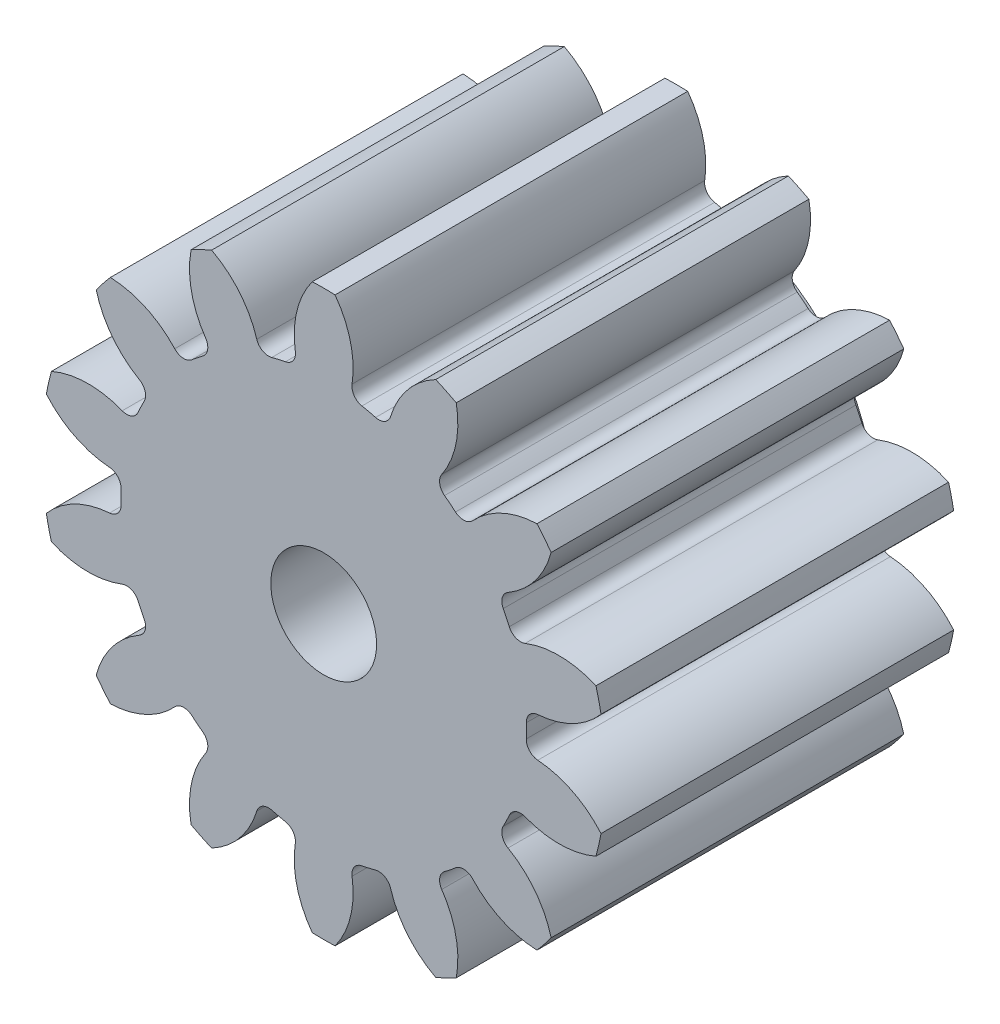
ISO-10303-21;
HEADER;
FILE_DESCRIPTION(('STEP AP214'),'2;1');
FILE_NAME('part.step','',(''),(''),'','','');
FILE_SCHEMA(('AUTOMOTIVE_DESIGN { 1 0 10303 214 1 1 1 1 }'));
ENDSEC;
DATA;
#1=APPLICATION_CONTEXT('core data for automotive mechanical design processes');
#2=APPLICATION_PROTOCOL_DEFINITION('international standard','automotive_design',2000,#1);
#3=PRODUCT_CONTEXT('',#1,'mechanical');
#4=PRODUCT('Part','Part','',(#3));
#5=PRODUCT_RELATED_PRODUCT_CATEGORY('part','',(#4));
#6=PRODUCT_DEFINITION_FORMATION('','',#4);
#7=PRODUCT_DEFINITION_CONTEXT('part definition',#1,'design');
#8=PRODUCT_DEFINITION('design','',#6,#7);
#9=PRODUCT_DEFINITION_SHAPE('','',#8);
#10=(LENGTH_UNIT() NAMED_UNIT(*) SI_UNIT(.MILLI.,.METRE.));
#11=(NAMED_UNIT(*) PLANE_ANGLE_UNIT() SI_UNIT($,.RADIAN.));
#12=(NAMED_UNIT(*) SI_UNIT($,.STERADIAN.) SOLID_ANGLE_UNIT());
#13=UNCERTAINTY_MEASURE_WITH_UNIT(LENGTH_MEASURE(1.E-05),#10,'distance_accuracy_value','');
#14=(GEOMETRIC_REPRESENTATION_CONTEXT(3) GLOBAL_UNCERTAINTY_ASSIGNED_CONTEXT((#13)) GLOBAL_UNIT_ASSIGNED_CONTEXT((#10,
#11,#12)) REPRESENTATION_CONTEXT('',''));
#15=CARTESIAN_POINT('',(0.,0.,0.));
#16=DIRECTION('',(0.,0.,1.));
#17=DIRECTION('',(1.,0.,0.));
#18=AXIS2_PLACEMENT_3D('',#15,#16,#17);
#19=CARTESIAN_POINT('',(0.,0.,0.3));
#20=DIRECTION('',(0.,0.,-1.));
#21=DIRECTION('',(-1.,0.,0.));
#22=AXIS2_PLACEMENT_3D('',#19,#20,#21);
#23=CYLINDRICAL_SURFACE('',#22,2.5);
#24=CARTESIAN_POINT('',(0.,0.,0.3));
#25=DIRECTION('',(0.,0.,1.));
#26=DIRECTION('',(1.,0.,0.));
#27=AXIS2_PLACEMENT_3D('',#24,#25,#26);
#28=CIRCLE('',#27,2.5);
#29=CARTESIAN_POINT('',(2.5,0.,0.3));
#30=VERTEX_POINT('',#29);
#31=EDGE_CURVE('E923',#30,#30,#28,.T.);
#32=ORIENTED_EDGE('',*,*,#31,.F.);
#33=EDGE_LOOP('',(#32));
#34=FACE_BOUND('',#33,.T.);
#35=CARTESIAN_POINT('',(0.,0.,0.));
#36=DIRECTION('',(0.,0.,1.));
#37=DIRECTION('',(1.,0.,0.));
#38=AXIS2_PLACEMENT_3D('',#35,#36,#37);
#39=CIRCLE('',#38,2.5);
#40=CARTESIAN_POINT('',(2.5,0.,0.));
#41=VERTEX_POINT('',#40);
#42=EDGE_CURVE('E920',#41,#41,#39,.T.);
#43=ORIENTED_EDGE('',*,*,#42,.T.);
#44=EDGE_LOOP('',(#43));
#45=FACE_BOUND('',#44,.T.);
#46=ADVANCED_FACE('F34',(#34,#45),#23,.T.);
#47=CARTESIAN_POINT('',(0.,0.,0.));
#48=DIRECTION('',(0.,0.,1.));
#49=DIRECTION('',(1.,0.,0.));
#50=AXIS2_PLACEMENT_3D('',#47,#48,#49);
#51=PLANE('',#50);
#52=CARTESIAN_POINT('',(0.,0.,0.));
#53=DIRECTION('',(0.,0.,1.));
#54=DIRECTION('',(1.,0.,0.));
#55=AXIS2_PLACEMENT_3D('',#52,#53,#54);
#56=CIRCLE('',#55,0.75);
#57=CARTESIAN_POINT('',(0.75,0.,0.));
#58=VERTEX_POINT('',#57);
#59=EDGE_CURVE('E578',#58,#58,#56,.F.);
#60=ORIENTED_EDGE('',*,*,#59,.F.);
#61=EDGE_LOOP('',(#60));
#62=FACE_BOUND('',#61,.T.);
#63=ORIENTED_EDGE('',*,*,#42,.F.);
#64=EDGE_LOOP('',(#63));
#65=FACE_BOUND('',#64,.T.);
#66=ADVANCED_FACE('F1571',(#62,#65),#51,.F.);
#67=CARTESIAN_POINT('',(0.,0.,0.3));
#68=DIRECTION('',(0.,0.,1.));
#69=DIRECTION('',(1.,0.,0.));
#70=AXIS2_PLACEMENT_3D('',#67,#68,#69);
#71=PLANE('',#70);
#72=CARTESIAN_POINT('',(0.,0.,0.3));
#73=DIRECTION('',(0.,0.,1.));
#74=DIRECTION('',(1.,0.,0.));
#75=AXIS2_PLACEMENT_3D('',#72,#73,#74);
#76=CIRCLE('',#75,2.875);
#77=CARTESIAN_POINT('',(0.736336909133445,2.77910650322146,0.3));
#78=VERTEX_POINT('',#77);
#79=CARTESIAN_POINT('',(0.542392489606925,2.82337305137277,0.3));
#80=VERTEX_POINT('',#79);
#81=EDGE_CURVE('E891',#78,#80,#76,.T.);
#82=ORIENTED_EDGE('',*,*,#81,.F.);
#83=CARTESIAN_POINT('',(0.781157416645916,2.94826950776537,0.3));
#84=DIRECTION('',(0.,0.,1.));
#85=DIRECTION('',(1.,0.,0.));
#86=AXIS2_PLACEMENT_3D('',#83,#84,#85);
#87=CIRCLE('',#86,0.175);
#88=CARTESIAN_POINT('',(0.948533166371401,2.89717784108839,0.3));
#89=VERTEX_POINT('',#88);
#90=EDGE_CURVE('E963',#78,#89,#87,.T.);
#91=ORIENTED_EDGE('',*,*,#90,.T.);
#92=CARTESIAN_POINT('',(2.19698620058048,2.51608591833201,0.3));
#93=DIRECTION('',(0.,0.,1.));
#94=DIRECTION('',(0.900968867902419,-0.433883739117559,0.));
#95=AXIS2_PLACEMENT_3D('',#92,#93,#94);
#96=CIRCLE('',#95,1.30532219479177);
#97=CARTESIAN_POINT('',(1.58865801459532,3.67098974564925,0.3));
#98=VERTEX_POINT('',#97);
#99=EDGE_CURVE('E873',#98,#89,#96,.T.);
#100=ORIENTED_EDGE('',*,*,#99,.F.);
#101=CARTESIAN_POINT('',(0.,0.,0.3));
#102=DIRECTION('',(0.,0.,1.));
#103=DIRECTION('',(0.900968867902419,-0.433883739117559,0.));
#104=AXIS2_PLACEMENT_3D('',#101,#102,#103);
#105=CIRCLE('',#104,4.);
#106=CARTESIAN_POINT('',(1.8795832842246,3.53088751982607,0.3));
#107=VERTEX_POINT('',#106);
#108=EDGE_CURVE('E871',#107,#98,#105,.T.);
#109=ORIENTED_EDGE('',*,*,#108,.F.);
#110=CARTESIAN_POINT('',(0.597356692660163,3.28642688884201,0.3));
#111=DIRECTION('',(0.,0.,-1.));
#112=DIRECTION('',(-0.900968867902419,0.433883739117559,0.));
#113=AXIS2_PLACEMENT_3D('',#110,#111,#112);
#114=CIRCLE('',#113,1.30532219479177);
#115=CARTESIAN_POINT('',(1.67370409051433,2.54795392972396,0.3));
#116=VERTEX_POINT('',#115);
#117=EDGE_CURVE('E868',#107,#116,#114,.T.);
#118=ORIENTED_EDGE('',*,*,#117,.T.);
#119=CARTESIAN_POINT('',(1.81800623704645,2.44894943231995,0.3));
#120=DIRECTION('',(0.,0.,1.));
#121=DIRECTION('',(1.,0.,0.));
#122=AXIS2_PLACEMENT_3D('',#119,#120,#121);
#123=CIRCLE('',#122,0.175);
#124=CARTESIAN_POINT('',(1.7136944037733,2.30843594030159,0.3));
#125=VERTEX_POINT('',#124);
#126=EDGE_CURVE('E958',#116,#125,#123,.T.);
#127=ORIENTED_EDGE('',*,*,#126,.T.);
#128=CARTESIAN_POINT('',(0.,0.,0.3));
#129=DIRECTION('',(0.,0.,1.));
#130=DIRECTION('',(0.900968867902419,-0.433883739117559,0.));
#131=AXIS2_PLACEMENT_3D('',#128,#129,#130);
#132=CIRCLE('',#131,2.875);
#133=CARTESIAN_POINT('',(1.86922575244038,2.1844038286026,0.3));
#134=VERTEX_POINT('',#133);
#135=EDGE_CURVE('E866',#134,#125,#132,.T.);
#136=ORIENTED_EDGE('',*,*,#135,.F.);
#137=CARTESIAN_POINT('',(1.98300471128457,2.31736753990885,0.3));
#138=DIRECTION('',(0.,0.,1.));
#139=DIRECTION('',(1.,0.,0.));
#140=AXIS2_PLACEMENT_3D('',#137,#138,#139);
#141=CIRCLE('',#140,0.175);
#142=CARTESIAN_POINT('',(2.11163720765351,2.19871392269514,0.3));
#143=VERTEX_POINT('',#142);
#144=EDGE_CURVE('E983',#134,#143,#141,.T.);
#145=ORIENTED_EDGE('',*,*,#144,.T.);
#146=CARTESIAN_POINT('',(3.07110493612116,1.31367849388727,0.3));
#147=DIRECTION('',(0.,0.,1.));
#148=DIRECTION('',(0.623489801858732,-0.781831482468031,0.));
#149=AXIS2_PLACEMENT_3D('',#146,#147,#148);
#150=CIRCLE('',#149,1.30532219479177);
#151=CARTESIAN_POINT('',(3.02411416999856,2.6181545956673,0.3));
#152=VERTEX_POINT('',#151);
#153=EDGE_CURVE('E848',#152,#143,#150,.T.);
#154=ORIENTED_EDGE('',*,*,#153,.F.);
#155=CARTESIAN_POINT('',(0.,0.,0.3));
#156=DIRECTION('',(0.,0.,1.));
#157=DIRECTION('',(0.623489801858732,-0.781831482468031,0.));
#158=AXIS2_PLACEMENT_3D('',#155,#156,#157);
#159=CIRCLE('',#158,4.);
#160=CARTESIAN_POINT('',(3.2254407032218,2.36569910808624,0.3));
#161=VERTEX_POINT('',#160);
#162=EDGE_CURVE('E846',#161,#152,#159,.T.);
#163=ORIENTED_EDGE('',*,*,#162,.F.);
#164=CARTESIAN_POINT('',(1.96412696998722,2.70178495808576,0.3));
#165=DIRECTION('',(0.,0.,-1.));
#166=DIRECTION('',(-0.623489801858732,0.781831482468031,0.));
#167=AXIS2_PLACEMENT_3D('',#164,#165,#166);
#168=CIRCLE('',#167,1.30532219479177);
#169=CARTESIAN_POINT('',(2.61347105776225,1.5694341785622,0.3));
#170=VERTEX_POINT('',#169);
#171=EDGE_CURVE('E843',#161,#170,#168,.T.);
#172=ORIENTED_EDGE('',*,*,#171,.T.);
#173=CARTESIAN_POINT('',(2.70052635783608,1.41762385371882,0.3));
#174=DIRECTION('',(0.,0.,1.));
#175=DIRECTION('',(1.,0.,0.));
#176=AXIS2_PLACEMENT_3D('',#173,#174,#175);
#177=CIRCLE('',#176,0.175);
#178=CARTESIAN_POINT('',(2.54557812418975,1.33628478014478,0.3));
#179=VERTEX_POINT('',#178);
#180=EDGE_CURVE('E978',#170,#179,#177,.T.);
#181=ORIENTED_EDGE('',*,*,#180,.T.);
#182=CARTESIAN_POINT('',(0.,0.,0.3));
#183=DIRECTION('',(0.,0.,1.));
#184=DIRECTION('',(0.623489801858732,-0.781831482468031,0.));
#185=AXIS2_PLACEMENT_3D('',#182,#183,#184);
#186=CIRCLE('',#185,2.875);
#187=CARTESIAN_POINT('',(2.63189151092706,1.15705318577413,0.3));
#188=VERTEX_POINT('',#187);
#189=EDGE_CURVE('E841',#188,#179,#186,.T.);
#190=ORIENTED_EDGE('',*,*,#189,.F.);
#191=CARTESIAN_POINT('',(2.79209360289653,1.2274825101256,0.3));
#192=DIRECTION('',(0.,0.,1.));
#193=DIRECTION('',(1.,0.,0.));
#194=AXIS2_PLACEMENT_3D('',#191,#192,#193);
#195=CIRCLE('',#194,0.175);
#196=CARTESIAN_POINT('',(2.85650560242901,1.06476774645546,0.3));
#197=VERTEX_POINT('',#196);
#198=EDGE_CURVE('E1003',#188,#197,#195,.T.);
#199=ORIENTED_EDGE('',*,*,#198,.T.);
#200=CARTESIAN_POINT('',(3.33695367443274,-0.14891906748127,0.3));
#201=DIRECTION('',(0.,0.,1.));
#202=DIRECTION('',(0.222520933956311,-0.974927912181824,0.));
#203=AXIS2_PLACEMENT_3D('',#200,#201,#202);
#204=CIRCLE('',#203,1.30532219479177);
#205=CARTESIAN_POINT('',(3.86060742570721,1.04676181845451,0.3));
#206=VERTEX_POINT('',#205);
#207=EDGE_CURVE('E823',#206,#197,#204,.T.);
#208=ORIENTED_EDGE('',*,*,#207,.F.);
#209=CARTESIAN_POINT('',(0.,0.,0.3));
#210=DIRECTION('',(0.,0.,1.));
#211=DIRECTION('',(0.222520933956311,-0.974927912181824,0.));
#212=AXIS2_PLACEMENT_3D('',#209,#210,#211);
#213=CIRCLE('',#212,4.);
#214=CARTESIAN_POINT('',(3.93246003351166,0.731954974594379,0.3));
#215=VERTEX_POINT('',#214);
#216=EDGE_CURVE('E821',#215,#206,#213,.T.);
#217=ORIENTED_EDGE('',*,*,#216,.F.);
#218=CARTESIAN_POINT('',(2.94187781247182,1.58202138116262,0.3));
#219=DIRECTION('',(0.,0.,-1.));
#220=DIRECTION('',(-0.222520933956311,0.974927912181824,0.));
#221=AXIS2_PLACEMENT_3D('',#218,#219,#220);
#222=CIRCLE('',#221,1.30532219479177);
#223=CARTESIAN_POINT('',(3.03560802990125,0.280068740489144,0.3));
#224=VERTEX_POINT('',#223);
#225=EDGE_CURVE('E818',#215,#224,#222,.T.);
#226=ORIENTED_EDGE('',*,*,#225,.T.);
#227=CARTESIAN_POINT('',(3.04817411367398,0.105520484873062,0.3));
#228=DIRECTION('',(0.,0.,1.));
#229=DIRECTION('',(1.,0.,0.));
#230=AXIS2_PLACEMENT_3D('',#227,#228,#229);
#231=CIRCLE('',#230,0.175);
#232=CARTESIAN_POINT('',(2.8732788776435,0.0994660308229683,0.3));
#233=VERTEX_POINT('',#232);
#234=EDGE_CURVE('E998',#224,#233,#231,.T.);
#235=ORIENTED_EDGE('',*,*,#234,.T.);
#236=CARTESIAN_POINT('',(0.,0.,0.3));
#237=DIRECTION('',(0.,0.,1.));
#238=DIRECTION('',(0.222520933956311,-0.974927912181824,0.));
#239=AXIS2_PLACEMENT_3D('',#236,#237,#238);
#240=CIRCLE('',#239,2.875);
#241=CARTESIAN_POINT('',(2.8732788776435,-0.0994660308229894,0.3));
#242=VERTEX_POINT('',#241);
#243=EDGE_CURVE('E816',#242,#233,#240,.T.);
#244=ORIENTED_EDGE('',*,*,#243,.F.);
#245=CARTESIAN_POINT('',(3.04817411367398,-0.105520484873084,0.3));
#246=DIRECTION('',(0.,0.,1.));
#247=DIRECTION('',(1.,0.,0.));
#248=AXIS2_PLACEMENT_3D('',#245,#246,#247);
#249=CIRCLE('',#248,0.175);
#250=CARTESIAN_POINT('',(3.03560802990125,-0.280068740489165,0.3));
#251=VERTEX_POINT('',#250);
#252=EDGE_CURVE('E1023',#242,#251,#249,.T.);
#253=ORIENTED_EDGE('',*,*,#252,.T.);
#254=CARTESIAN_POINT('',(2.94187781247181,-1.58202138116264,0.3));
#255=DIRECTION('',(0.,0.,1.));
#256=DIRECTION('',(-0.222520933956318,-0.974927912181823,0.));
#257=AXIS2_PLACEMENT_3D('',#254,#255,#256);
#258=CIRCLE('',#257,1.30532219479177);
#259=CARTESIAN_POINT('',(3.93246003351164,-0.731954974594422,0.3));
#260=VERTEX_POINT('',#259);
#261=EDGE_CURVE('E798',#260,#251,#258,.T.);
#262=ORIENTED_EDGE('',*,*,#261,.F.);
#263=CARTESIAN_POINT('',(0.,0.,0.3));
#264=DIRECTION('',(0.,0.,1.));
#265=DIRECTION('',(-0.222520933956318,-0.974927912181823,0.));
#266=AXIS2_PLACEMENT_3D('',#263,#264,#265);
#267=CIRCLE('',#266,4.);
#268=CARTESIAN_POINT('',(3.86060742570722,-1.04676181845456,0.3));
#269=VERTEX_POINT('',#268);
#270=EDGE_CURVE('E796',#269,#260,#267,.T.);
#271=ORIENTED_EDGE('',*,*,#270,.F.);
#272=CARTESIAN_POINT('',(3.33695367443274,0.148919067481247,0.3));
#273=DIRECTION('',(0.,0.,-1.));
#274=DIRECTION('',(0.222520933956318,0.974927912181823,0.));
#275=AXIS2_PLACEMENT_3D('',#272,#273,#274);
#276=CIRCLE('',#275,1.30532219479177);
#277=CARTESIAN_POINT('',(2.856505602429,-1.06476774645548,0.3));
#278=VERTEX_POINT('',#277);
#279=EDGE_CURVE('E793',#269,#278,#276,.T.);
#280=ORIENTED_EDGE('',*,*,#279,.T.);
#281=CARTESIAN_POINT('',(2.79209360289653,-1.22748251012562,0.3));
#282=DIRECTION('',(0.,0.,1.));
#283=DIRECTION('',(1.,0.,0.));
#284=AXIS2_PLACEMENT_3D('',#281,#282,#283);
#285=CIRCLE('',#284,0.175);
#286=CARTESIAN_POINT('',(2.63189151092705,-1.15705318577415,0.3));
#287=VERTEX_POINT('',#286);
#288=EDGE_CURVE('E1018',#278,#287,#285,.T.);
#289=ORIENTED_EDGE('',*,*,#288,.T.);
#290=CARTESIAN_POINT('',(0.,0.,0.3));
#291=DIRECTION('',(0.,0.,1.));
#292=DIRECTION('',(-0.222520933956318,-0.974927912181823,0.));
#293=AXIS2_PLACEMENT_3D('',#290,#291,#292);
#294=CIRCLE('',#293,2.875);
#295=CARTESIAN_POINT('',(2.54557812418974,-1.3362847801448,0.3));
#296=VERTEX_POINT('',#295);
#297=EDGE_CURVE('E791',#296,#287,#294,.T.);
#298=ORIENTED_EDGE('',*,*,#297,.F.);
#299=CARTESIAN_POINT('',(2.70052635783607,-1.41762385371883,0.3));
#300=DIRECTION('',(0.,0.,1.));
#301=DIRECTION('',(1.,0.,0.));
#302=AXIS2_PLACEMENT_3D('',#299,#300,#301);
#303=CIRCLE('',#302,0.175);
#304=CARTESIAN_POINT('',(2.61347105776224,-1.56943417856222,0.3));
#305=VERTEX_POINT('',#304);
#306=EDGE_CURVE('E1043',#296,#305,#303,.T.);
#307=ORIENTED_EDGE('',*,*,#306,.T.);
#308=CARTESIAN_POINT('',(1.9641269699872,-2.70178495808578,0.3));
#309=DIRECTION('',(0.,0.,1.));
#310=DIRECTION('',(-0.623489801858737,-0.781831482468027,0.));
#311=AXIS2_PLACEMENT_3D('',#308,#309,#310);
#312=CIRCLE('',#311,1.30532219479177);
#313=CARTESIAN_POINT('',(3.22544070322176,-2.36569910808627,0.3));
#314=VERTEX_POINT('',#313);
#315=EDGE_CURVE('E773',#314,#305,#312,.T.);
#316=ORIENTED_EDGE('',*,*,#315,.F.);
#317=CARTESIAN_POINT('',(0.,0.,0.3));
#318=DIRECTION('',(0.,0.,1.));
#319=DIRECTION('',(-0.623489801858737,-0.781831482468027,0.));
#320=AXIS2_PLACEMENT_3D('',#317,#318,#319);
#321=CIRCLE('',#320,4.);
#322=CARTESIAN_POINT('',(3.02411416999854,-2.61815459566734,0.3));
#323=VERTEX_POINT('',#322);
#324=EDGE_CURVE('E771',#323,#314,#321,.T.);
#325=ORIENTED_EDGE('',*,*,#324,.F.);
#326=CARTESIAN_POINT('',(3.07110493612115,-1.31367849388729,0.3));
#327=DIRECTION('',(0.,0.,-1.));
#328=DIRECTION('',(0.623489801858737,0.781831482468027,0.));
#329=AXIS2_PLACEMENT_3D('',#326,#327,#328);
#330=CIRCLE('',#329,1.30532219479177);
#331=CARTESIAN_POINT('',(2.11163720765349,-2.19871392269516,0.3));
#332=VERTEX_POINT('',#331);
#333=EDGE_CURVE('E768',#323,#332,#330,.T.);
#334=ORIENTED_EDGE('',*,*,#333,.T.);
#335=CARTESIAN_POINT('',(1.98300471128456,-2.31736753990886,0.3));
#336=DIRECTION('',(0.,0.,1.));
#337=DIRECTION('',(1.,0.,0.));
#338=AXIS2_PLACEMENT_3D('',#335,#336,#337);
#339=CIRCLE('',#338,0.175);
#340=CARTESIAN_POINT('',(1.86922575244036,-2.18440382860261,0.3));
#341=VERTEX_POINT('',#340);
#342=EDGE_CURVE('E1038',#332,#341,#339,.T.);
#343=ORIENTED_EDGE('',*,*,#342,.T.);
#344=CARTESIAN_POINT('',(0.,0.,0.3));
#345=DIRECTION('',(0.,0.,1.));
#346=DIRECTION('',(-0.623489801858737,-0.781831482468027,0.));
#347=AXIS2_PLACEMENT_3D('',#344,#345,#346);
#348=CIRCLE('',#347,2.875);
#349=CARTESIAN_POINT('',(1.71369440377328,-2.3084359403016,0.3));
#350=VERTEX_POINT('',#349);
#351=EDGE_CURVE('E766',#350,#341,#348,.T.);
#352=ORIENTED_EDGE('',*,*,#351,.F.);
#353=CARTESIAN_POINT('',(1.81800623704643,-2.44894943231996,0.3));
#354=DIRECTION('',(0.,0.,1.));
#355=DIRECTION('',(1.,0.,0.));
#356=AXIS2_PLACEMENT_3D('',#353,#354,#355);
#357=CIRCLE('',#356,0.175);
#358=CARTESIAN_POINT('',(1.67370409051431,-2.54795392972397,0.3));
#359=VERTEX_POINT('',#358);
#360=EDGE_CURVE('E1063',#350,#359,#357,.T.);
#361=ORIENTED_EDGE('',*,*,#360,.T.);
#362=CARTESIAN_POINT('',(0.597356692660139,-3.28642688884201,0.3));
#363=DIRECTION('',(0.,0.,1.));
#364=DIRECTION('',(-0.900968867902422,-0.433883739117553,0.));
#365=AXIS2_PLACEMENT_3D('',#362,#363,#364);
#366=CIRCLE('',#365,1.30532219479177);
#367=CARTESIAN_POINT('',(1.87958328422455,-3.53088751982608,0.3));
#368=VERTEX_POINT('',#367);
#369=EDGE_CURVE('E748',#368,#359,#366,.T.);
#370=ORIENTED_EDGE('',*,*,#369,.F.);
#371=CARTESIAN_POINT('',(0.,0.,0.3));
#372=DIRECTION('',(0.,0.,1.));
#373=DIRECTION('',(-0.900968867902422,-0.433883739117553,0.));
#374=AXIS2_PLACEMENT_3D('',#371,#372,#373);
#375=CIRCLE('',#374,4.);
#376=CARTESIAN_POINT('',(1.58865801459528,-3.67098974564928,0.3));
#377=VERTEX_POINT('',#376);
#378=EDGE_CURVE('E746',#377,#368,#375,.T.);
#379=ORIENTED_EDGE('',*,*,#378,.F.);
#380=CARTESIAN_POINT('',(2.19698620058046,-2.51608591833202,0.3));
#381=DIRECTION('',(0.,0.,-1.));
#382=DIRECTION('',(0.900968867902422,0.433883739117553,0.));
#383=AXIS2_PLACEMENT_3D('',#380,#381,#382);
#384=CIRCLE('',#383,1.30532219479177);
#385=CARTESIAN_POINT('',(0.94853316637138,-2.8971778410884,0.3));
#386=VERTEX_POINT('',#385);
#387=EDGE_CURVE('E743',#377,#386,#384,.T.);
#388=ORIENTED_EDGE('',*,*,#387,.T.);
#389=CARTESIAN_POINT('',(0.781157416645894,-2.94826950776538,0.3));
#390=DIRECTION('',(0.,0.,1.));
#391=DIRECTION('',(1.,0.,0.));
#392=AXIS2_PLACEMENT_3D('',#389,#390,#391);
#393=CIRCLE('',#392,0.175);
#394=CARTESIAN_POINT('',(0.736336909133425,-2.77910650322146,0.3));
#395=VERTEX_POINT('',#394);
#396=EDGE_CURVE('E1058',#386,#395,#393,.T.);
#397=ORIENTED_EDGE('',*,*,#396,.T.);
#398=CARTESIAN_POINT('',(0.,0.,0.3));
#399=DIRECTION('',(0.,0.,1.));
#400=DIRECTION('',(-0.900968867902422,-0.433883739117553,0.));
#401=AXIS2_PLACEMENT_3D('',#398,#399,#400);
#402=CIRCLE('',#401,2.875);
#403=CARTESIAN_POINT('',(0.542392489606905,-2.82337305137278,0.3));
#404=VERTEX_POINT('',#403);
#405=EDGE_CURVE('E741',#404,#395,#402,.T.);
#406=ORIENTED_EDGE('',*,*,#405,.F.);
#407=CARTESIAN_POINT('',(0.575407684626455,-2.99523054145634,0.3));
#408=DIRECTION('',(0.,0.,1.));
#409=DIRECTION('',(1.,0.,0.));
#410=AXIS2_PLACEMENT_3D('',#407,#408,#409);
#411=CIRCLE('',#410,0.175);
#412=CARTESIAN_POINT('',(0.40243950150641,-3.02182015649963,0.3));
#413=VERTEX_POINT('',#412);
#414=EDGE_CURVE('E1083',#404,#413,#411,.T.);
#415=ORIENTED_EDGE('',*,*,#414,.T.);
#416=CARTESIAN_POINT('',(-0.88772740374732,-3.22015166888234,0.3));
#417=DIRECTION('',(0.,0.,1.));
#418=DIRECTION('',(-1.,0.,0.));
#419=AXIS2_PLACEMENT_3D('',#416,#417,#418);
#420=CIRCLE('',#419,1.30532219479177);
#421=CARTESIAN_POINT('',(0.161451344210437,-3.99674035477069,0.3));
#422=VERTEX_POINT('',#421);
#423=EDGE_CURVE('E723',#422,#413,#420,.T.);
#424=ORIENTED_EDGE('',*,*,#423,.F.);
#425=CARTESIAN_POINT('',(0.,0.,0.3));
#426=DIRECTION('',(0.,0.,1.));
#427=DIRECTION('',(-1.,0.,0.));
#428=AXIS2_PLACEMENT_3D('',#425,#426,#427);
#429=CIRCLE('',#428,4.);
#430=CARTESIAN_POINT('',(-0.161451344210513,-3.9967403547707,0.3));
#431=VERTEX_POINT('',#430);
#432=EDGE_CURVE('E721',#431,#422,#429,.T.);
#433=ORIENTED_EDGE('',*,*,#432,.F.);
#434=CARTESIAN_POINT('',(0.887727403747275,-3.22015166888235,0.3));
#435=DIRECTION('',(0.,0.,-1.));
#436=DIRECTION('',(1.,0.,0.));
#437=AXIS2_PLACEMENT_3D('',#434,#435,#436);
#438=CIRCLE('',#437,1.30532219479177);
#439=CARTESIAN_POINT('',(-0.402439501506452,-3.02182015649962,0.3));
#440=VERTEX_POINT('',#439);
#441=EDGE_CURVE('E718',#431,#440,#438,.T.);
#442=ORIENTED_EDGE('',*,*,#441,.T.);
#443=CARTESIAN_POINT('',(-0.575407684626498,-2.99523054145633,0.3));
#444=DIRECTION('',(0.,0.,1.));
#445=DIRECTION('',(1.,0.,0.));
#446=AXIS2_PLACEMENT_3D('',#443,#444,#445);
#447=CIRCLE('',#446,0.175);
#448=CARTESIAN_POINT('',(-0.542392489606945,-2.82337305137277,0.3));
#449=VERTEX_POINT('',#448);
#450=EDGE_CURVE('E1078',#440,#449,#447,.T.);
#451=ORIENTED_EDGE('',*,*,#450,.T.);
#452=CARTESIAN_POINT('',(0.,0.,0.3));
#453=DIRECTION('',(0.,0.,1.));
#454=DIRECTION('',(-1.,0.,0.));
#455=AXIS2_PLACEMENT_3D('',#452,#453,#454);
#456=CIRCLE('',#455,2.875);
#457=CARTESIAN_POINT('',(-0.736336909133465,-2.77910650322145,0.3));
#458=VERTEX_POINT('',#457);
#459=EDGE_CURVE('E716',#458,#449,#456,.T.);
#460=ORIENTED_EDGE('',*,*,#459,.F.);
#461=CARTESIAN_POINT('',(-0.781157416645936,-2.94826950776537,0.3));
#462=DIRECTION('',(0.,0.,1.));
#463=DIRECTION('',(1.,0.,0.));
#464=AXIS2_PLACEMENT_3D('',#461,#462,#463);
#465=CIRCLE('',#464,0.175);
#466=CARTESIAN_POINT('',(-0.94853316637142,-2.89717784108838,0.3));
#467=VERTEX_POINT('',#466);
#468=EDGE_CURVE('E1103',#458,#467,#465,.T.);
#469=ORIENTED_EDGE('',*,*,#468,.T.);
#470=CARTESIAN_POINT('',(-2.19698620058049,-2.51608591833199,0.3));
#471=DIRECTION('',(0.,0.,1.));
#472=DIRECTION('',(-0.900968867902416,0.433883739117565,0.));
#473=AXIS2_PLACEMENT_3D('',#470,#471,#472);
#474=CIRCLE('',#473,1.30532219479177);
#475=CARTESIAN_POINT('',(-1.58865801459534,-3.67098974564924,0.3));
#476=VERTEX_POINT('',#475);
#477=EDGE_CURVE('E698',#476,#467,#474,.T.);
#478=ORIENTED_EDGE('',*,*,#477,.F.);
#479=CARTESIAN_POINT('',(0.,0.,0.3));
#480=DIRECTION('',(0.,0.,1.));
#481=DIRECTION('',(-0.900968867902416,0.433883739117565,0.));
#482=AXIS2_PLACEMENT_3D('',#479,#480,#481);
#483=CIRCLE('',#482,4.);
#484=CARTESIAN_POINT('',(-1.87958328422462,-3.53088751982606,0.3));
#485=VERTEX_POINT('',#484);
#486=EDGE_CURVE('E696',#485,#476,#483,.T.);
#487=ORIENTED_EDGE('',*,*,#486,.F.);
#488=CARTESIAN_POINT('',(-0.597356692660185,-3.28642688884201,0.3));
#489=DIRECTION('',(0.,0.,-1.));
#490=DIRECTION('',(0.900968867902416,-0.433883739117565,0.));
#491=AXIS2_PLACEMENT_3D('',#488,#489,#490);
#492=CIRCLE('',#491,1.30532219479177);
#493=CARTESIAN_POINT('',(-1.67370409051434,-2.54795392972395,0.3));
#494=VERTEX_POINT('',#493);
#495=EDGE_CURVE('E693',#485,#494,#492,.T.);
#496=ORIENTED_EDGE('',*,*,#495,.T.);
#497=CARTESIAN_POINT('',(-1.81800623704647,-2.44894943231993,0.3));
#498=DIRECTION('',(0.,0.,1.));
#499=DIRECTION('',(1.,0.,0.));
#500=AXIS2_PLACEMENT_3D('',#497,#498,#499);
#501=CIRCLE('',#500,0.175);
#502=CARTESIAN_POINT('',(-1.71369440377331,-2.30843594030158,0.3));
#503=VERTEX_POINT('',#502);
#504=EDGE_CURVE('E1098',#494,#503,#501,.T.);
#505=ORIENTED_EDGE('',*,*,#504,.T.);
#506=CARTESIAN_POINT('',(0.,0.,0.3));
#507=DIRECTION('',(0.,0.,1.));
#508=DIRECTION('',(-0.900968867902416,0.433883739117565,0.));
#509=AXIS2_PLACEMENT_3D('',#506,#507,#508);
#510=CIRCLE('',#509,2.875);
#511=CARTESIAN_POINT('',(-1.86922575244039,-2.18440382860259,0.3));
#512=VERTEX_POINT('',#511);
#513=EDGE_CURVE('E691',#512,#503,#510,.T.);
#514=ORIENTED_EDGE('',*,*,#513,.F.);
#515=CARTESIAN_POINT('',(-1.98300471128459,-2.31736753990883,0.3));
#516=DIRECTION('',(0.,0.,1.));
#517=DIRECTION('',(1.,0.,0.));
#518=AXIS2_PLACEMENT_3D('',#515,#516,#517);
#519=CIRCLE('',#518,0.175);
#520=CARTESIAN_POINT('',(-2.11163720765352,-2.19871392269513,0.3));
#521=VERTEX_POINT('',#520);
#522=EDGE_CURVE('E1123',#512,#521,#519,.T.);
#523=ORIENTED_EDGE('',*,*,#522,.T.);
#524=CARTESIAN_POINT('',(-3.07110493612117,-1.31367849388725,0.3));
#525=DIRECTION('',(0.,0.,1.));
#526=DIRECTION('',(-0.623489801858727,0.781831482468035,0.));
#527=AXIS2_PLACEMENT_3D('',#524,#525,#526);
#528=CIRCLE('',#527,1.30532219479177);
#529=CARTESIAN_POINT('',(-3.02411416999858,-2.61815459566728,0.3));
#530=VERTEX_POINT('',#529);
#531=EDGE_CURVE('E673',#530,#521,#528,.T.);
#532=ORIENTED_EDGE('',*,*,#531,.F.);
#533=CARTESIAN_POINT('',(0.,0.,0.3));
#534=DIRECTION('',(0.,0.,1.));
#535=DIRECTION('',(-0.623489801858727,0.781831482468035,0.));
#536=AXIS2_PLACEMENT_3D('',#533,#534,#535);
#537=CIRCLE('',#536,4.);
#538=CARTESIAN_POINT('',(-3.22544070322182,-2.36569910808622,0.3));
#539=VERTEX_POINT('',#538);
#540=EDGE_CURVE('E671',#539,#530,#537,.T.);
#541=ORIENTED_EDGE('',*,*,#540,.F.);
#542=CARTESIAN_POINT('',(-1.96412696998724,-2.70178495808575,0.3));
#543=DIRECTION('',(0.,0.,-1.));
#544=DIRECTION('',(0.623489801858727,-0.781831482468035,0.));
#545=AXIS2_PLACEMENT_3D('',#542,#543,#544);
#546=CIRCLE('',#545,1.30532219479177);
#547=CARTESIAN_POINT('',(-2.61347105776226,-1.56943417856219,0.3));
#548=VERTEX_POINT('',#547);
#549=EDGE_CURVE('E668',#539,#548,#546,.T.);
#550=ORIENTED_EDGE('',*,*,#549,.T.);
#551=CARTESIAN_POINT('',(-2.70052635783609,-1.4176238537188,0.3));
#552=DIRECTION('',(0.,0.,1.));
#553=DIRECTION('',(1.,0.,0.));
#554=AXIS2_PLACEMENT_3D('',#551,#552,#553);
#555=CIRCLE('',#554,0.175);
#556=CARTESIAN_POINT('',(-2.54557812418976,-1.33628478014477,0.3));
#557=VERTEX_POINT('',#556);
#558=EDGE_CURVE('E1118',#548,#557,#555,.T.);
#559=ORIENTED_EDGE('',*,*,#558,.T.);
#560=CARTESIAN_POINT('',(0.,0.,0.3));
#561=DIRECTION('',(0.,0.,1.));
#562=DIRECTION('',(-0.623489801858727,0.781831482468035,0.));
#563=AXIS2_PLACEMENT_3D('',#560,#561,#562);
#564=CIRCLE('',#563,2.875);
#565=CARTESIAN_POINT('',(-2.63189151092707,-1.15705318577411,0.3));
#566=VERTEX_POINT('',#565);
#567=EDGE_CURVE('E666',#566,#557,#564,.T.);
#568=ORIENTED_EDGE('',*,*,#567,.F.);
#569=CARTESIAN_POINT('',(-2.79209360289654,-1.22748251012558,0.3));
#570=DIRECTION('',(0.,0.,1.));
#571=DIRECTION('',(1.,0.,0.));
#572=AXIS2_PLACEMENT_3D('',#569,#570,#571);
#573=CIRCLE('',#572,0.175);
#574=CARTESIAN_POINT('',(-2.85650560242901,-1.06476774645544,0.3));
#575=VERTEX_POINT('',#574);
#576=EDGE_CURVE('E1143',#566,#575,#573,.T.);
#577=ORIENTED_EDGE('',*,*,#576,.T.);
#578=CARTESIAN_POINT('',(-3.33695367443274,0.148919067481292,0.3));
#579=DIRECTION('',(0.,0.,1.));
#580=DIRECTION('',(-0.222520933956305,0.974927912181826,0.));
#581=AXIS2_PLACEMENT_3D('',#578,#579,#580);
#582=CIRCLE('',#581,1.30532219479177);
#583=CARTESIAN_POINT('',(-3.86060742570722,-1.04676181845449,0.3));
#584=VERTEX_POINT('',#583);
#585=EDGE_CURVE('E648',#584,#575,#582,.T.);
#586=ORIENTED_EDGE('',*,*,#585,.F.);
#587=CARTESIAN_POINT('',(0.,0.,0.3));
#588=DIRECTION('',(0.,0.,1.));
#589=DIRECTION('',(-0.222520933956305,0.974927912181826,0.));
#590=AXIS2_PLACEMENT_3D('',#587,#588,#589);
#591=CIRCLE('',#590,4.);
#592=CARTESIAN_POINT('',(-3.93246003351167,-0.731954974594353,0.3));
#593=VERTEX_POINT('',#592);
#594=EDGE_CURVE('E646',#593,#584,#591,.T.);
#595=ORIENTED_EDGE('',*,*,#594,.F.);
#596=CARTESIAN_POINT('',(-2.94187781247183,-1.5820213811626,0.3));
#597=DIRECTION('',(0.,0.,-1.));
#598=DIRECTION('',(0.222520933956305,-0.974927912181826,0.));
#599=AXIS2_PLACEMENT_3D('',#596,#597,#598);
#600=CIRCLE('',#599,1.30532219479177);
#601=CARTESIAN_POINT('',(-3.03560802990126,-0.280068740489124,0.3));
#602=VERTEX_POINT('',#601);
#603=EDGE_CURVE('E643',#593,#602,#600,.T.);
#604=ORIENTED_EDGE('',*,*,#603,.T.);
#605=CARTESIAN_POINT('',(-3.04817411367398,-0.105520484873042,0.3));
#606=DIRECTION('',(0.,0.,1.));
#607=DIRECTION('',(1.,0.,0.));
#608=AXIS2_PLACEMENT_3D('',#605,#606,#607);
#609=CIRCLE('',#608,0.175);
#610=CARTESIAN_POINT('',(-2.87327887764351,-0.0994660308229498,0.3));
#611=VERTEX_POINT('',#610);
#612=EDGE_CURVE('E1138',#602,#611,#609,.T.);
#613=ORIENTED_EDGE('',*,*,#612,.T.);
#614=CARTESIAN_POINT('',(0.,0.,0.3));
#615=DIRECTION('',(0.,0.,1.));
#616=DIRECTION('',(-0.222520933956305,0.974927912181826,0.));
#617=AXIS2_PLACEMENT_3D('',#614,#615,#616);
#618=CIRCLE('',#617,2.875);
#619=CARTESIAN_POINT('',(-2.8732788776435,0.0994660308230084,0.3));
#620=VERTEX_POINT('',#619);
#621=EDGE_CURVE('E641',#620,#611,#618,.T.);
#622=ORIENTED_EDGE('',*,*,#621,.F.);
#623=CARTESIAN_POINT('',(-3.04817411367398,0.105520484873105,0.3));
#624=DIRECTION('',(0.,0.,1.));
#625=DIRECTION('',(1.,0.,0.));
#626=AXIS2_PLACEMENT_3D('',#623,#624,#625);
#627=CIRCLE('',#626,0.175);
#628=CARTESIAN_POINT('',(-3.03560802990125,0.280068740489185,0.3));
#629=VERTEX_POINT('',#628);
#630=EDGE_CURVE('E1163',#620,#629,#627,.T.);
#631=ORIENTED_EDGE('',*,*,#630,.T.);
#632=CARTESIAN_POINT('',(-2.9418778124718,1.58202138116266,0.3));
#633=DIRECTION('',(0.,0.,1.));
#634=DIRECTION('',(0.222520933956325,0.974927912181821,0.));
#635=AXIS2_PLACEMENT_3D('',#632,#633,#634);
#636=CIRCLE('',#635,1.30532219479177);
#637=CARTESIAN_POINT('',(-3.93246003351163,0.731954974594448,0.3));
#638=VERTEX_POINT('',#637);
#639=EDGE_CURVE('E623',#638,#629,#636,.T.);
#640=ORIENTED_EDGE('',*,*,#639,.F.);
#641=CARTESIAN_POINT('',(0.,0.,0.3));
#642=DIRECTION('',(0.,0.,1.));
#643=DIRECTION('',(0.222520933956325,0.974927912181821,0.));
#644=AXIS2_PLACEMENT_3D('',#641,#642,#643);
#645=CIRCLE('',#644,4.);
#646=CARTESIAN_POINT('',(-3.86060742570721,1.04676181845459,0.3));
#647=VERTEX_POINT('',#646);
#648=EDGE_CURVE('E621',#647,#638,#645,.T.);
#649=ORIENTED_EDGE('',*,*,#648,.F.);
#650=CARTESIAN_POINT('',(-3.33695367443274,-0.148919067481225,0.3));
#651=DIRECTION('',(0.,0.,-1.));
#652=DIRECTION('',(-0.222520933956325,-0.974927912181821,0.));
#653=AXIS2_PLACEMENT_3D('',#650,#651,#652);
#654=CIRCLE('',#653,1.30532219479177);
#655=CARTESIAN_POINT('',(-2.85650560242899,1.0647677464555,0.3));
#656=VERTEX_POINT('',#655);
#657=EDGE_CURVE('E618',#647,#656,#654,.T.);
#658=ORIENTED_EDGE('',*,*,#657,.T.);
#659=CARTESIAN_POINT('',(-2.79209360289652,1.22748251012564,0.3));
#660=DIRECTION('',(0.,0.,1.));
#661=DIRECTION('',(1.,0.,0.));
#662=AXIS2_PLACEMENT_3D('',#659,#660,#661);
#663=CIRCLE('',#662,0.175);
#664=CARTESIAN_POINT('',(-2.63189151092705,1.15705318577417,0.3));
#665=VERTEX_POINT('',#664);
#666=EDGE_CURVE('E1158',#656,#665,#663,.T.);
#667=ORIENTED_EDGE('',*,*,#666,.T.);
#668=CARTESIAN_POINT('',(0.,0.,0.3));
#669=DIRECTION('',(0.,0.,1.));
#670=DIRECTION('',(0.222520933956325,0.974927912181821,0.));
#671=AXIS2_PLACEMENT_3D('',#668,#669,#670);
#672=CIRCLE('',#671,2.875);
#673=CARTESIAN_POINT('',(-2.54557812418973,1.33628478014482,0.3));
#674=VERTEX_POINT('',#673);
#675=EDGE_CURVE('E616',#674,#665,#672,.T.);
#676=ORIENTED_EDGE('',*,*,#675,.F.);
#677=CARTESIAN_POINT('',(-2.70052635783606,1.41762385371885,0.3));
#678=DIRECTION('',(0.,0.,1.));
#679=DIRECTION('',(1.,0.,0.));
#680=AXIS2_PLACEMENT_3D('',#677,#678,#679);
#681=CIRCLE('',#680,0.175);
#682=CARTESIAN_POINT('',(-2.61347105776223,1.56943417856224,0.3));
#683=VERTEX_POINT('',#682);
#684=EDGE_CURVE('E1183',#674,#683,#681,.T.);
#685=ORIENTED_EDGE('',*,*,#684,.T.);
#686=CARTESIAN_POINT('',(-1.96412696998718,2.70178495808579,0.3));
#687=DIRECTION('',(0.,0.,1.));
#688=DIRECTION('',(0.623489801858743,0.781831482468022,0.));
#689=AXIS2_PLACEMENT_3D('',#686,#687,#688);
#690=CIRCLE('',#689,1.30532219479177);
#691=CARTESIAN_POINT('',(-3.22544070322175,2.36569910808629,0.3));
#692=VERTEX_POINT('',#691);
#693=EDGE_CURVE('E598',#692,#683,#690,.T.);
#694=ORIENTED_EDGE('',*,*,#693,.F.);
#695=CARTESIAN_POINT('',(0.,0.,0.3));
#696=DIRECTION('',(0.,0.,1.));
#697=DIRECTION('',(0.623489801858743,0.781831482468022,0.));
#698=AXIS2_PLACEMENT_3D('',#695,#696,#697);
#699=CIRCLE('',#698,4.);
#700=CARTESIAN_POINT('',(-3.02411416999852,2.61815459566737,0.3));
#701=VERTEX_POINT('',#700);
#702=EDGE_CURVE('E596',#701,#692,#699,.T.);
#703=ORIENTED_EDGE('',*,*,#702,.F.);
#704=CARTESIAN_POINT('',(-3.07110493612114,1.31367849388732,0.3));
#705=DIRECTION('',(0.,0.,-1.));
#706=DIRECTION('',(-0.623489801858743,-0.781831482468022,0.));
#707=AXIS2_PLACEMENT_3D('',#704,#705,#706);
#708=CIRCLE('',#707,1.30532219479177);
#709=CARTESIAN_POINT('',(-2.11163720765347,2.19871392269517,0.3));
#710=VERTEX_POINT('',#709);
#711=EDGE_CURVE('E593',#701,#710,#708,.T.);
#712=ORIENTED_EDGE('',*,*,#711,.T.);
#713=CARTESIAN_POINT('',(-1.98300471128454,2.31736753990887,0.3));
#714=DIRECTION('',(0.,0.,1.));
#715=DIRECTION('',(1.,0.,0.));
#716=AXIS2_PLACEMENT_3D('',#713,#714,#715);
#717=CIRCLE('',#716,0.175);
#718=CARTESIAN_POINT('',(-1.86922575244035,2.18440382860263,0.3));
#719=VERTEX_POINT('',#718);
#720=EDGE_CURVE('E1178',#710,#719,#717,.T.);
#721=ORIENTED_EDGE('',*,*,#720,.T.);
#722=CARTESIAN_POINT('',(0.,0.,0.3));
#723=DIRECTION('',(0.,0.,1.));
#724=DIRECTION('',(0.623489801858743,0.781831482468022,0.));
#725=AXIS2_PLACEMENT_3D('',#722,#723,#724);
#726=CIRCLE('',#725,2.875);
#727=CARTESIAN_POINT('',(-1.71369440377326,2.30843594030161,0.3));
#728=VERTEX_POINT('',#727);
#729=EDGE_CURVE('E564',#728,#719,#726,.T.);
#730=ORIENTED_EDGE('',*,*,#729,.F.);
#731=CARTESIAN_POINT('',(-1.81800623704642,2.44894943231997,0.3));
#732=DIRECTION('',(0.,0.,1.));
#733=DIRECTION('',(1.,0.,0.));
#734=AXIS2_PLACEMENT_3D('',#731,#732,#733);
#735=CIRCLE('',#734,0.175);
#736=CARTESIAN_POINT('',(-1.67370409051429,2.54795392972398,0.3));
#737=VERTEX_POINT('',#736);
#738=EDGE_CURVE('E41',#728,#737,#735,.T.);
#739=ORIENTED_EDGE('',*,*,#738,.T.);
#740=CARTESIAN_POINT('',(-0.597356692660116,3.28642688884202,0.3));
#741=DIRECTION('',(0.,0.,1.));
#742=DIRECTION('',(0.900968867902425,0.433883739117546,0.));
#743=AXIS2_PLACEMENT_3D('',#740,#741,#742);
#744=CIRCLE('',#743,1.30532219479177);
#745=CARTESIAN_POINT('',(-1.87958328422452,3.53088751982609,0.3));
#746=VERTEX_POINT('',#745);
#747=EDGE_CURVE('E572',#746,#737,#744,.T.);
#748=ORIENTED_EDGE('',*,*,#747,.F.);
#749=CARTESIAN_POINT('',(0.,0.,0.3));
#750=DIRECTION('',(0.,0.,1.));
#751=DIRECTION('',(0.900968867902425,0.433883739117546,0.));
#752=AXIS2_PLACEMENT_3D('',#749,#750,#751);
#753=CIRCLE('',#752,4.);
#754=CARTESIAN_POINT('',(-1.58865801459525,3.67098974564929,0.3));
#755=VERTEX_POINT('',#754);
#756=EDGE_CURVE('E557',#755,#746,#753,.T.);
#757=ORIENTED_EDGE('',*,*,#756,.F.);
#758=CARTESIAN_POINT('',(-2.19698620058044,2.51608591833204,0.3));
#759=DIRECTION('',(0.,0.,-1.));
#760=DIRECTION('',(-0.900968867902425,-0.433883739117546,0.));
#761=AXIS2_PLACEMENT_3D('',#758,#759,#760);
#762=CIRCLE('',#761,1.30532219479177);
#763=CARTESIAN_POINT('',(-0.94853316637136,2.8971778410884,0.3));
#764=VERTEX_POINT('',#763);
#765=EDGE_CURVE('E571',#755,#764,#762,.T.);
#766=ORIENTED_EDGE('',*,*,#765,.T.);
#767=CARTESIAN_POINT('',(-0.781157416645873,2.94826950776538,0.3));
#768=DIRECTION('',(0.,0.,1.));
#769=DIRECTION('',(1.,0.,0.));
#770=AXIS2_PLACEMENT_3D('',#767,#768,#769);
#771=CIRCLE('',#770,0.175);
#772=CARTESIAN_POINT('',(-0.736336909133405,2.77910650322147,0.3));
#773=VERTEX_POINT('',#772);
#774=EDGE_CURVE('E1194',#764,#773,#771,.T.);
#775=ORIENTED_EDGE('',*,*,#774,.T.);
#776=CARTESIAN_POINT('',(0.,0.,0.3));
#777=DIRECTION('',(0.,0.,-1.));
#778=DIRECTION('',(-1.,0.,0.));
#779=AXIS2_PLACEMENT_3D('',#776,#777,#778);
#780=CIRCLE('',#779,2.875);
#781=CARTESIAN_POINT('',(-0.542392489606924,2.82337305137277,0.3));
#782=VERTEX_POINT('',#781);
#783=EDGE_CURVE('E901',#773,#782,#780,.T.);
#784=ORIENTED_EDGE('',*,*,#783,.T.);
#785=CARTESIAN_POINT('',(-0.575407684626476,2.99523054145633,0.3));
#786=DIRECTION('',(0.,0.,1.));
#787=DIRECTION('',(1.,0.,0.));
#788=AXIS2_PLACEMENT_3D('',#785,#786,#787);
#789=CIRCLE('',#788,0.175);
#790=CARTESIAN_POINT('',(-0.402439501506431,3.02182015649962,0.3));
#791=VERTEX_POINT('',#790);
#792=EDGE_CURVE('E942',#782,#791,#789,.T.);
#793=ORIENTED_EDGE('',*,*,#792,.T.);
#794=CARTESIAN_POINT('',(0.887727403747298,3.22015166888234,0.3));
#795=DIRECTION('',(0.,0.,1.));
#796=DIRECTION('',(1.,0.,0.));
#797=AXIS2_PLACEMENT_3D('',#794,#795,#796);
#798=CIRCLE('',#797,1.30532219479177);
#799=CARTESIAN_POINT('',(-0.161451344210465,3.99674035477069,0.3));
#800=VERTEX_POINT('',#799);
#801=EDGE_CURVE('E898',#800,#791,#798,.T.);
#802=ORIENTED_EDGE('',*,*,#801,.F.);
#803=CARTESIAN_POINT('',(0.,0.,0.3));
#804=DIRECTION('',(0.,0.,1.));
#805=DIRECTION('',(1.,0.,0.));
#806=AXIS2_PLACEMENT_3D('',#803,#804,#805);
#807=CIRCLE('',#806,4.);
#808=CARTESIAN_POINT('',(0.161451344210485,3.9967403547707,0.3));
#809=VERTEX_POINT('',#808);
#810=EDGE_CURVE('E896',#809,#800,#807,.T.);
#811=ORIENTED_EDGE('',*,*,#810,.F.);
#812=CARTESIAN_POINT('',(-0.887727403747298,3.22015166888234,0.3));
#813=DIRECTION('',(0.,0.,-1.));
#814=DIRECTION('',(-1.,0.,0.));
#815=AXIS2_PLACEMENT_3D('',#812,#813,#814);
#816=CIRCLE('',#815,1.30532219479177);
#817=CARTESIAN_POINT('',(0.402439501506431,3.02182015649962,0.3));
#818=VERTEX_POINT('',#817);
#819=EDGE_CURVE('E893',#809,#818,#816,.T.);
#820=ORIENTED_EDGE('',*,*,#819,.T.);
#821=CARTESIAN_POINT('',(0.575407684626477,2.99523054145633,0.3));
#822=DIRECTION('',(0.,0.,1.));
#823=DIRECTION('',(1.,0.,0.));
#824=AXIS2_PLACEMENT_3D('',#821,#822,#823);
#825=CIRCLE('',#824,0.175);
#826=EDGE_CURVE('E937',#818,#80,#825,.T.);
#827=ORIENTED_EDGE('',*,*,#826,.T.);
#828=EDGE_LOOP('',(#82,#91,#100,#109,#118,#127,#136,#145,#154,#163,#172,#181,#190,#199,#208,
#217,#226,#235,#244,#253,#262,#271,#280,#289,#298,#307,#316,#325,#334,#343,#352,#361,#370,#379,
#388,#397,#406,#415,#424,#433,#442,#451,#460,#469,#478,#487,#496,#505,#514,#523,#532,#541,#550,
#559,#568,#577,#586,#595,#604,#613,#622,#631,#640,#649,#658,#667,#676,#685,#694,#703,#712,#721,
#730,#739,#748,#757,#766,#775,#784,#793,#802,#811,#820,#827));
#829=FACE_BOUND('',#828,.T.);
#830=ORIENTED_EDGE('',*,*,#31,.T.);
#831=EDGE_LOOP('',(#830));
#832=FACE_BOUND('',#831,.T.);
#833=ADVANCED_FACE('F569',(#829,#832),#71,.F.);
#834=CARTESIAN_POINT('',(0.,0.,5.3));
#835=DIRECTION('',(0.,0.,-1.));
#836=DIRECTION('',(-1.,0.,0.));
#837=AXIS2_PLACEMENT_3D('',#834,#835,#836);
#838=CYLINDRICAL_SURFACE('',#837,2.875);
#839=CARTESIAN_POINT('',(0.,0.,5.3));
#840=DIRECTION('',(0.,0.,1.));
#841=DIRECTION('',(1.,0.,0.));
#842=AXIS2_PLACEMENT_3D('',#839,#840,#841);
#843=CIRCLE('',#842,2.875);
#844=CARTESIAN_POINT('',(0.736336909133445,2.77910650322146,5.3));
#845=VERTEX_POINT('',#844);
#846=CARTESIAN_POINT('',(0.542392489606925,2.82337305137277,5.3));
#847=VERTEX_POINT('',#846);
#848=EDGE_CURVE('E903',#845,#847,#843,.T.);
#849=ORIENTED_EDGE('',*,*,#848,.F.);
#850=DIRECTION('',(0.,0.,-1.));
#851=VECTOR('',#850,1.);
#852=CARTESIAN_POINT('',(0.736336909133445,2.77910650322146,5.3));
#853=LINE('',#852,#851);
#854=EDGE_CURVE('E953',#845,#78,#853,.T.);
#855=ORIENTED_EDGE('',*,*,#854,.T.);
#856=ORIENTED_EDGE('',*,*,#81,.T.);
#857=DIRECTION('',(0.,0.,-1.));
#858=VECTOR('',#857,1.);
#859=CARTESIAN_POINT('',(0.542392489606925,2.82337305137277,5.3));
#860=LINE('',#859,#858);
#861=EDGE_CURVE('E929',#80,#847,#860,.F.);
#862=ORIENTED_EDGE('',*,*,#861,.T.);
#863=EDGE_LOOP('',(#849,#855,#856,#862));
#864=FACE_BOUND('',#863,.T.);
#865=ADVANCED_FACE('F1234',(#864),#838,.T.);
#866=CARTESIAN_POINT('',(-0.887727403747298,3.22015166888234,5.3));
#867=DIRECTION('',(0.,0.,-1.));
#868=DIRECTION('',(-1.,0.,0.));
#869=AXIS2_PLACEMENT_3D('',#866,#867,#868);
#870=CYLINDRICAL_SURFACE('',#869,1.30532219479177);
#871=CARTESIAN_POINT('',(-0.887727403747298,3.22015166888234,5.3));
#872=DIRECTION('',(0.,0.,-1.));
#873=DIRECTION('',(-1.,0.,0.));
#874=AXIS2_PLACEMENT_3D('',#871,#872,#873);
#875=CIRCLE('',#874,1.30532219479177);
#876=CARTESIAN_POINT('',(0.161451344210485,3.9967403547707,5.3));
#877=VERTEX_POINT('',#876);
#878=CARTESIAN_POINT('',(0.402439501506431,3.02182015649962,5.3));
#879=VERTEX_POINT('',#878);
#880=EDGE_CURVE('E905',#877,#879,#875,.T.);
#881=ORIENTED_EDGE('',*,*,#880,.T.);
#882=DIRECTION('',(0.,0.,-1.));
#883=VECTOR('',#882,1.);
#884=CARTESIAN_POINT('',(0.402439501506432,3.02182015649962,5.3));
#885=LINE('',#884,#883);
#886=EDGE_CURVE('E926',#879,#818,#885,.T.);
#887=ORIENTED_EDGE('',*,*,#886,.T.);
#888=ORIENTED_EDGE('',*,*,#819,.F.);
#889=DIRECTION('',(0.,0.,-1.));
#890=VECTOR('',#889,1.);
#891=CARTESIAN_POINT('',(0.161451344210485,3.9967403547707,5.3));
#892=LINE('',#891,#890);
#893=EDGE_CURVE('E918',#877,#809,#892,.T.);
#894=ORIENTED_EDGE('',*,*,#893,.F.);
#895=EDGE_LOOP('',(#881,#887,#888,#894));
#896=FACE_BOUND('',#895,.T.);
#897=ADVANCED_FACE('F1225',(#896),#870,.T.);
#898=CARTESIAN_POINT('',(0.,0.,5.3));
#899=DIRECTION('',(0.,0.,-1.));
#900=DIRECTION('',(-1.,0.,0.));
#901=AXIS2_PLACEMENT_3D('',#898,#899,#900);
#902=CYLINDRICAL_SURFACE('',#901,4.);
#903=ORIENTED_EDGE('',*,*,#810,.T.);
#904=DIRECTION('',(0.,0.,-1.));
#905=VECTOR('',#904,1.);
#906=CARTESIAN_POINT('',(-0.161451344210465,3.99674035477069,5.3));
#907=LINE('',#906,#905);
#908=CARTESIAN_POINT('',(-0.161451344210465,3.99674035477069,5.3));
#909=VERTEX_POINT('',#908);
#910=EDGE_CURVE('E915',#909,#800,#907,.T.);
#911=ORIENTED_EDGE('',*,*,#910,.F.);
#912=CARTESIAN_POINT('',(0.,0.,5.3));
#913=DIRECTION('',(0.,0.,1.));
#914=DIRECTION('',(1.,0.,0.));
#915=AXIS2_PLACEMENT_3D('',#912,#913,#914);
#916=CIRCLE('',#915,4.);
#917=EDGE_CURVE('E908',#877,#909,#916,.T.);
#918=ORIENTED_EDGE('',*,*,#917,.F.);
#919=ORIENTED_EDGE('',*,*,#893,.T.);
#920=EDGE_LOOP('',(#903,#911,#918,#919));
#921=FACE_BOUND('',#920,.T.);
#922=ADVANCED_FACE('F1221',(#921),#902,.T.);
#923=CARTESIAN_POINT('',(0.887727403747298,3.22015166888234,5.3));
#924=DIRECTION('',(0.,0.,-1.));
#925=DIRECTION('',(-1.,0.,0.));
#926=AXIS2_PLACEMENT_3D('',#923,#924,#925);
#927=CYLINDRICAL_SURFACE('',#926,1.30532219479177);
#928=ORIENTED_EDGE('',*,*,#801,.T.);
#929=DIRECTION('',(0.,0.,-1.));
#930=VECTOR('',#929,1.);
#931=CARTESIAN_POINT('',(-0.402439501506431,3.02182015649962,5.3));
#932=LINE('',#931,#930);
#933=CARTESIAN_POINT('',(-0.402439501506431,3.02182015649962,5.3));
#934=VERTEX_POINT('',#933);
#935=EDGE_CURVE('E935',#791,#934,#932,.F.);
#936=ORIENTED_EDGE('',*,*,#935,.T.);
#937=CARTESIAN_POINT('',(0.887727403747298,3.22015166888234,5.3));
#938=DIRECTION('',(0.,0.,1.));
#939=DIRECTION('',(1.,0.,0.));
#940=AXIS2_PLACEMENT_3D('',#937,#938,#939);
#941=CIRCLE('',#940,1.30532219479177);
#942=EDGE_CURVE('E910',#909,#934,#941,.T.);
#943=ORIENTED_EDGE('',*,*,#942,.F.);
#944=ORIENTED_EDGE('',*,*,#910,.T.);
#945=EDGE_LOOP('',(#928,#936,#943,#944));
#946=FACE_BOUND('',#945,.T.);
#947=ADVANCED_FACE('F1216',(#946),#927,.T.);
#948=CARTESIAN_POINT('',(0.,0.,5.3));
#949=DIRECTION('',(0.,0.,-1.));
#950=DIRECTION('',(-1.,0.,0.));
#951=AXIS2_PLACEMENT_3D('',#948,#949,#950);
#952=CYLINDRICAL_SURFACE('',#951,2.875);
#953=ORIENTED_EDGE('',*,*,#783,.F.);
#954=DIRECTION('',(0.,0.,-1.));
#955=VECTOR('',#954,1.);
#956=CARTESIAN_POINT('',(-0.736336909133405,2.77910650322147,5.3));
#957=LINE('',#956,#955);
#958=CARTESIAN_POINT('',(-0.736336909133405,2.77910650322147,5.3));
#959=VERTEX_POINT('',#958);
#960=EDGE_CURVE('E1188',#773,#959,#957,.F.);
#961=ORIENTED_EDGE('',*,*,#960,.T.);
#962=CARTESIAN_POINT('',(0.,0.,5.3));
#963=DIRECTION('',(0.,0.,-1.));
#964=DIRECTION('',(-1.,0.,0.));
#965=AXIS2_PLACEMENT_3D('',#962,#963,#964);
#966=CIRCLE('',#965,2.875);
#967=CARTESIAN_POINT('',(-0.542392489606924,2.82337305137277,5.3));
#968=VERTEX_POINT('',#967);
#969=EDGE_CURVE('E913',#959,#968,#966,.T.);
#970=ORIENTED_EDGE('',*,*,#969,.T.);
#971=DIRECTION('',(0.,0.,-1.));
#972=VECTOR('',#971,1.);
#973=CARTESIAN_POINT('',(-0.542392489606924,2.82337305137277,5.3));
#974=LINE('',#973,#972);
#975=EDGE_CURVE('E932',#968,#782,#974,.T.);
#976=ORIENTED_EDGE('',*,*,#975,.T.);
#977=EDGE_LOOP('',(#953,#961,#970,#976));
#978=FACE_BOUND('',#977,.T.);
#979=ADVANCED_FACE('F1207',(#978),#952,.T.);
#980=CARTESIAN_POINT('',(0.,0.,5.3));
#981=DIRECTION('',(0.,0.,1.));
#982=DIRECTION('',(1.,0.,0.));
#983=AXIS2_PLACEMENT_3D('',#980,#981,#982);
#984=PLANE('',#983);
#985=CARTESIAN_POINT('',(0.,0.,5.3));
#986=DIRECTION('',(0.,0.,1.));
#987=DIRECTION('',(1.,0.,0.));
#988=AXIS2_PLACEMENT_3D('',#985,#986,#987);
#989=CIRCLE('',#988,0.75);
#990=CARTESIAN_POINT('',(0.75,0.,5.3));
#991=VERTEX_POINT('',#990);
#992=EDGE_CURVE('E581',#991,#991,#989,.T.);
#993=ORIENTED_EDGE('',*,*,#992,.F.);
#994=EDGE_LOOP('',(#993));
#995=FACE_BOUND('',#994,.T.);
#996=CARTESIAN_POINT('',(2.19698620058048,2.51608591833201,5.3));
#997=DIRECTION('',(0.,0.,1.));
#998=DIRECTION('',(0.900968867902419,-0.433883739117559,0.));
#999=AXIS2_PLACEMENT_3D('',#996,#997,#998);
#1000=CIRCLE('',#999,1.30532219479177);
#1001=CARTESIAN_POINT('',(1.58865801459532,3.67098974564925,5.3));
#1002=VERTEX_POINT('',#1001);
#1003=CARTESIAN_POINT('',(0.948533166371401,2.89717784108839,5.3));
#1004=VERTEX_POINT('',#1003);
#1005=EDGE_CURVE('E883',#1002,#1004,#1000,.T.);
#1006=ORIENTED_EDGE('',*,*,#1005,.T.);
#1007=CARTESIAN_POINT('',(0.781157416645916,2.94826950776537,5.3));
#1008=DIRECTION('',(0.,0.,1.));
#1009=DIRECTION('',(1.,0.,0.));
#1010=AXIS2_PLACEMENT_3D('',#1007,#1008,#1009);
#1011=CIRCLE('',#1010,0.175);
#1012=EDGE_CURVE('E965',#1004,#845,#1011,.F.);
#1013=ORIENTED_EDGE('',*,*,#1012,.T.);
#1014=ORIENTED_EDGE('',*,*,#848,.T.);
#1015=CARTESIAN_POINT('',(0.575407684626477,2.99523054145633,5.3));
#1016=DIRECTION('',(0.,0.,1.));
#1017=DIRECTION('',(1.,0.,0.));
#1018=AXIS2_PLACEMENT_3D('',#1015,#1016,#1017);
#1019=CIRCLE('',#1018,0.175);
#1020=EDGE_CURVE('E940',#847,#879,#1019,.F.);
#1021=ORIENTED_EDGE('',*,*,#1020,.T.);
#1022=ORIENTED_EDGE('',*,*,#880,.F.);
#1023=ORIENTED_EDGE('',*,*,#917,.T.);
#1024=ORIENTED_EDGE('',*,*,#942,.T.);
#1025=CARTESIAN_POINT('',(-0.575407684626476,2.99523054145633,5.3));
#1026=DIRECTION('',(0.,0.,1.));
#1027=DIRECTION('',(1.,0.,0.));
#1028=AXIS2_PLACEMENT_3D('',#1025,#1026,#1027);
#1029=CIRCLE('',#1028,0.175);
#1030=EDGE_CURVE('E944',#934,#968,#1029,.F.);
#1031=ORIENTED_EDGE('',*,*,#1030,.T.);
#1032=ORIENTED_EDGE('',*,*,#969,.F.);
#1033=CARTESIAN_POINT('',(-0.781157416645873,2.94826950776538,5.3));
#1034=DIRECTION('',(0.,0.,1.));
#1035=DIRECTION('',(1.,0.,0.));
#1036=AXIS2_PLACEMENT_3D('',#1033,#1034,#1035);
#1037=CIRCLE('',#1036,0.175);
#1038=CARTESIAN_POINT('',(-0.94853316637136,2.8971778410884,5.3));
#1039=VERTEX_POINT('',#1038);
#1040=EDGE_CURVE('E1196',#959,#1039,#1037,.F.);
#1041=ORIENTED_EDGE('',*,*,#1040,.T.);
#1042=CARTESIAN_POINT('',(-2.19698620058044,2.51608591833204,5.3));
#1043=DIRECTION('',(0.,0.,-1.));
#1044=DIRECTION('',(-0.900968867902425,-0.433883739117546,0.));
#1045=AXIS2_PLACEMENT_3D('',#1042,#1043,#1044);
#1046=CIRCLE('',#1045,1.30532219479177);
#1047=CARTESIAN_POINT('',(-1.58865801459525,3.67098974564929,5.3));
#1048=VERTEX_POINT('',#1047);
#1049=EDGE_CURVE('E586',#1048,#1039,#1046,.T.);
#1050=ORIENTED_EDGE('',*,*,#1049,.F.);
#1051=CARTESIAN_POINT('',(0.,0.,5.3));
#1052=DIRECTION('',(0.,0.,1.));
#1053=DIRECTION('',(0.900968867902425,0.433883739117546,0.));
#1054=AXIS2_PLACEMENT_3D('',#1051,#1052,#1053);
#1055=CIRCLE('',#1054,4.);
#1056=CARTESIAN_POINT('',(-1.87958328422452,3.53088751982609,5.3));
#1057=VERTEX_POINT('',#1056);
#1058=EDGE_CURVE('E559',#1048,#1057,#1055,.T.);
#1059=ORIENTED_EDGE('',*,*,#1058,.T.);
#1060=CARTESIAN_POINT('',(-0.597356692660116,3.28642688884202,5.3));
#1061=DIRECTION('',(0.,0.,1.));
#1062=DIRECTION('',(0.900968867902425,0.433883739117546,0.));
#1063=AXIS2_PLACEMENT_3D('',#1060,#1061,#1062);
#1064=CIRCLE('',#1063,1.30532219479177);
#1065=CARTESIAN_POINT('',(-1.67370409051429,2.54795392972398,5.3));
#1066=VERTEX_POINT('',#1065);
#1067=EDGE_CURVE('E589',#1057,#1066,#1064,.T.);
#1068=ORIENTED_EDGE('',*,*,#1067,.T.);
#1069=CARTESIAN_POINT('',(-1.81800623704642,2.44894943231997,5.3));
#1070=DIRECTION('',(0.,0.,1.));
#1071=DIRECTION('',(1.,0.,0.));
#1072=AXIS2_PLACEMENT_3D('',#1069,#1070,#1071);
#1073=CIRCLE('',#1072,0.175);
#1074=CARTESIAN_POINT('',(-1.71369440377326,2.30843594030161,5.3));
#1075=VERTEX_POINT('',#1074);
#1076=EDGE_CURVE('E11',#1066,#1075,#1073,.F.);
#1077=ORIENTED_EDGE('',*,*,#1076,.T.);
#1078=CARTESIAN_POINT('',(0.,0.,5.3));
#1079=DIRECTION('',(0.,0.,1.));
#1080=DIRECTION('',(0.623489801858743,0.781831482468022,0.));
#1081=AXIS2_PLACEMENT_3D('',#1078,#1079,#1080);
#1082=CIRCLE('',#1081,2.875);
#1083=CARTESIAN_POINT('',(-1.86922575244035,2.18440382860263,5.3));
#1084=VERTEX_POINT('',#1083);
#1085=EDGE_CURVE('E601',#1075,#1084,#1082,.T.);
#1086=ORIENTED_EDGE('',*,*,#1085,.T.);
#1087=CARTESIAN_POINT('',(-1.98300471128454,2.31736753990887,5.3));
#1088=DIRECTION('',(0.,0.,1.));
#1089=DIRECTION('',(1.,0.,0.));
#1090=AXIS2_PLACEMENT_3D('',#1087,#1088,#1089);
#1091=CIRCLE('',#1090,0.175);
#1092=CARTESIAN_POINT('',(-2.11163720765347,2.19871392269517,5.3));
#1093=VERTEX_POINT('',#1092);
#1094=EDGE_CURVE('E1181',#1084,#1093,#1091,.F.);
#1095=ORIENTED_EDGE('',*,*,#1094,.T.);
#1096=CARTESIAN_POINT('',(-3.07110493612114,1.31367849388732,5.3));
#1097=DIRECTION('',(0.,0.,-1.));
#1098=DIRECTION('',(-0.623489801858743,-0.781831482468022,0.));
#1099=AXIS2_PLACEMENT_3D('',#1096,#1097,#1098);
#1100=CIRCLE('',#1099,1.30532219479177);
#1101=CARTESIAN_POINT('',(-3.02411416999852,2.61815459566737,5.3));
#1102=VERTEX_POINT('',#1101);
#1103=EDGE_CURVE('E603',#1102,#1093,#1100,.T.);
#1104=ORIENTED_EDGE('',*,*,#1103,.F.);
#1105=CARTESIAN_POINT('',(0.,0.,5.3));
#1106=DIRECTION('',(0.,0.,1.));
#1107=DIRECTION('',(0.623489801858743,0.781831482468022,0.));
#1108=AXIS2_PLACEMENT_3D('',#1105,#1106,#1107);
#1109=CIRCLE('',#1108,4.);
#1110=CARTESIAN_POINT('',(-3.22544070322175,2.36569910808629,5.3));
#1111=VERTEX_POINT('',#1110);
#1112=EDGE_CURVE('E606',#1102,#1111,#1109,.T.);
#1113=ORIENTED_EDGE('',*,*,#1112,.T.);
#1114=CARTESIAN_POINT('',(-1.96412696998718,2.70178495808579,5.3));
#1115=DIRECTION('',(0.,0.,1.));
#1116=DIRECTION('',(0.623489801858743,0.781831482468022,0.));
#1117=AXIS2_PLACEMENT_3D('',#1114,#1115,#1116);
#1118=CIRCLE('',#1117,1.30532219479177);
#1119=CARTESIAN_POINT('',(-2.61347105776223,1.56943417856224,5.3));
#1120=VERTEX_POINT('',#1119);
#1121=EDGE_CURVE('E608',#1111,#1120,#1118,.T.);
#1122=ORIENTED_EDGE('',*,*,#1121,.T.);
#1123=CARTESIAN_POINT('',(-2.70052635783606,1.41762385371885,5.3));
#1124=DIRECTION('',(0.,0.,1.));
#1125=DIRECTION('',(1.,0.,0.));
#1126=AXIS2_PLACEMENT_3D('',#1123,#1124,#1125);
#1127=CIRCLE('',#1126,0.175);
#1128=CARTESIAN_POINT('',(-2.54557812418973,1.33628478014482,5.3));
#1129=VERTEX_POINT('',#1128);
#1130=EDGE_CURVE('E1185',#1120,#1129,#1127,.F.);
#1131=ORIENTED_EDGE('',*,*,#1130,.T.);
#1132=CARTESIAN_POINT('',(0.,0.,5.3));
#1133=DIRECTION('',(0.,0.,1.));
#1134=DIRECTION('',(0.222520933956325,0.974927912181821,0.));
#1135=AXIS2_PLACEMENT_3D('',#1132,#1133,#1134);
#1136=CIRCLE('',#1135,2.875);
#1137=CARTESIAN_POINT('',(-2.63189151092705,1.15705318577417,5.3));
#1138=VERTEX_POINT('',#1137);
#1139=EDGE_CURVE('E626',#1129,#1138,#1136,.T.);
#1140=ORIENTED_EDGE('',*,*,#1139,.T.);
#1141=CARTESIAN_POINT('',(-2.79209360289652,1.22748251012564,5.3));
#1142=DIRECTION('',(0.,0.,1.));
#1143=DIRECTION('',(1.,0.,0.));
#1144=AXIS2_PLACEMENT_3D('',#1141,#1142,#1143);
#1145=CIRCLE('',#1144,0.175);
#1146=CARTESIAN_POINT('',(-2.85650560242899,1.0647677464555,5.3));
#1147=VERTEX_POINT('',#1146);
#1148=EDGE_CURVE('E1161',#1138,#1147,#1145,.F.);
#1149=ORIENTED_EDGE('',*,*,#1148,.T.);
#1150=CARTESIAN_POINT('',(-3.33695367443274,-0.148919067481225,5.3));
#1151=DIRECTION('',(0.,0.,-1.));
#1152=DIRECTION('',(-0.222520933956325,-0.974927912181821,0.));
#1153=AXIS2_PLACEMENT_3D('',#1150,#1151,#1152);
#1154=CIRCLE('',#1153,1.30532219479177);
#1155=CARTESIAN_POINT('',(-3.86060742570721,1.04676181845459,5.3));
#1156=VERTEX_POINT('',#1155);
#1157=EDGE_CURVE('E628',#1156,#1147,#1154,.T.);
#1158=ORIENTED_EDGE('',*,*,#1157,.F.);
#1159=CARTESIAN_POINT('',(0.,0.,5.3));
#1160=DIRECTION('',(0.,0.,1.));
#1161=DIRECTION('',(0.222520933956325,0.974927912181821,0.));
#1162=AXIS2_PLACEMENT_3D('',#1159,#1160,#1161);
#1163=CIRCLE('',#1162,4.);
#1164=CARTESIAN_POINT('',(-3.93246003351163,0.731954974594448,5.3));
#1165=VERTEX_POINT('',#1164);
#1166=EDGE_CURVE('E631',#1156,#1165,#1163,.T.);
#1167=ORIENTED_EDGE('',*,*,#1166,.T.);
#1168=CARTESIAN_POINT('',(-2.9418778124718,1.58202138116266,5.3));
#1169=DIRECTION('',(0.,0.,1.));
#1170=DIRECTION('',(0.222520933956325,0.974927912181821,0.));
#1171=AXIS2_PLACEMENT_3D('',#1168,#1169,#1170);
#1172=CIRCLE('',#1171,1.30532219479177);
#1173=CARTESIAN_POINT('',(-3.03560802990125,0.280068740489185,5.3));
#1174=VERTEX_POINT('',#1173);
#1175=EDGE_CURVE('E633',#1165,#1174,#1172,.T.);
#1176=ORIENTED_EDGE('',*,*,#1175,.T.);
#1177=CARTESIAN_POINT('',(-3.04817411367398,0.105520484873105,5.3));
#1178=DIRECTION('',(0.,0.,1.));
#1179=DIRECTION('',(1.,0.,0.));
#1180=AXIS2_PLACEMENT_3D('',#1177,#1178,#1179);
#1181=CIRCLE('',#1180,0.175);
#1182=CARTESIAN_POINT('',(-2.8732788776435,0.0994660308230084,5.3));
#1183=VERTEX_POINT('',#1182);
#1184=EDGE_CURVE('E1165',#1174,#1183,#1181,.F.);
#1185=ORIENTED_EDGE('',*,*,#1184,.T.);
#1186=CARTESIAN_POINT('',(0.,0.,5.3));
#1187=DIRECTION('',(0.,0.,1.));
#1188=DIRECTION('',(-0.222520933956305,0.974927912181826,0.));
#1189=AXIS2_PLACEMENT_3D('',#1186,#1187,#1188);
#1190=CIRCLE('',#1189,2.875);
#1191=CARTESIAN_POINT('',(-2.87327887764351,-0.0994660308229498,5.3));
#1192=VERTEX_POINT('',#1191);
#1193=EDGE_CURVE('E651',#1183,#1192,#1190,.T.);
#1194=ORIENTED_EDGE('',*,*,#1193,.T.);
#1195=CARTESIAN_POINT('',(-3.04817411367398,-0.105520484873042,5.3));
#1196=DIRECTION('',(0.,0.,1.));
#1197=DIRECTION('',(1.,0.,0.));
#1198=AXIS2_PLACEMENT_3D('',#1195,#1196,#1197);
#1199=CIRCLE('',#1198,0.175);
#1200=CARTESIAN_POINT('',(-3.03560802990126,-0.280068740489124,5.3));
#1201=VERTEX_POINT('',#1200);
#1202=EDGE_CURVE('E1141',#1192,#1201,#1199,.F.);
#1203=ORIENTED_EDGE('',*,*,#1202,.T.);
#1204=CARTESIAN_POINT('',(-2.94187781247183,-1.5820213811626,5.3));
#1205=DIRECTION('',(0.,0.,-1.));
#1206=DIRECTION('',(0.222520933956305,-0.974927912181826,0.));
#1207=AXIS2_PLACEMENT_3D('',#1204,#1205,#1206);
#1208=CIRCLE('',#1207,1.30532219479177);
#1209=CARTESIAN_POINT('',(-3.93246003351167,-0.731954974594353,5.3));
#1210=VERTEX_POINT('',#1209);
#1211=EDGE_CURVE('E653',#1210,#1201,#1208,.T.);
#1212=ORIENTED_EDGE('',*,*,#1211,.F.);
#1213=CARTESIAN_POINT('',(0.,0.,5.3));
#1214=DIRECTION('',(0.,0.,1.));
#1215=DIRECTION('',(-0.222520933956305,0.974927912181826,0.));
#1216=AXIS2_PLACEMENT_3D('',#1213,#1214,#1215);
#1217=CIRCLE('',#1216,4.);
#1218=CARTESIAN_POINT('',(-3.86060742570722,-1.04676181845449,5.3));
#1219=VERTEX_POINT('',#1218);
#1220=EDGE_CURVE('E656',#1210,#1219,#1217,.T.);
#1221=ORIENTED_EDGE('',*,*,#1220,.T.);
#1222=CARTESIAN_POINT('',(-3.33695367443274,0.148919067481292,5.3));
#1223=DIRECTION('',(0.,0.,1.));
#1224=DIRECTION('',(-0.222520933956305,0.974927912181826,0.));
#1225=AXIS2_PLACEMENT_3D('',#1222,#1223,#1224);
#1226=CIRCLE('',#1225,1.30532219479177);
#1227=CARTESIAN_POINT('',(-2.85650560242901,-1.06476774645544,5.3));
#1228=VERTEX_POINT('',#1227);
#1229=EDGE_CURVE('E658',#1219,#1228,#1226,.T.);
#1230=ORIENTED_EDGE('',*,*,#1229,.T.);
#1231=CARTESIAN_POINT('',(-2.79209360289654,-1.22748251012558,5.3));
#1232=DIRECTION('',(0.,0.,1.));
#1233=DIRECTION('',(1.,0.,0.));
#1234=AXIS2_PLACEMENT_3D('',#1231,#1232,#1233);
#1235=CIRCLE('',#1234,0.175);
#1236=CARTESIAN_POINT('',(-2.63189151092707,-1.15705318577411,5.3));
#1237=VERTEX_POINT('',#1236);
#1238=EDGE_CURVE('E1145',#1228,#1237,#1235,.F.);
#1239=ORIENTED_EDGE('',*,*,#1238,.T.);
#1240=CARTESIAN_POINT('',(0.,0.,5.3));
#1241=DIRECTION('',(0.,0.,1.));
#1242=DIRECTION('',(-0.623489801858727,0.781831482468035,0.));
#1243=AXIS2_PLACEMENT_3D('',#1240,#1241,#1242);
#1244=CIRCLE('',#1243,2.875);
#1245=CARTESIAN_POINT('',(-2.54557812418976,-1.33628478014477,5.3));
#1246=VERTEX_POINT('',#1245);
#1247=EDGE_CURVE('E676',#1237,#1246,#1244,.T.);
#1248=ORIENTED_EDGE('',*,*,#1247,.T.);
#1249=CARTESIAN_POINT('',(-2.70052635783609,-1.4176238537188,5.3));
#1250=DIRECTION('',(0.,0.,1.));
#1251=DIRECTION('',(1.,0.,0.));
#1252=AXIS2_PLACEMENT_3D('',#1249,#1250,#1251);
#1253=CIRCLE('',#1252,0.175);
#1254=CARTESIAN_POINT('',(-2.61347105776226,-1.56943417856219,5.3));
#1255=VERTEX_POINT('',#1254);
#1256=EDGE_CURVE('E1121',#1246,#1255,#1253,.F.);
#1257=ORIENTED_EDGE('',*,*,#1256,.T.);
#1258=CARTESIAN_POINT('',(-1.96412696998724,-2.70178495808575,5.3));
#1259=DIRECTION('',(0.,0.,-1.));
#1260=DIRECTION('',(0.623489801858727,-0.781831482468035,0.));
#1261=AXIS2_PLACEMENT_3D('',#1258,#1259,#1260);
#1262=CIRCLE('',#1261,1.30532219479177);
#1263=CARTESIAN_POINT('',(-3.22544070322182,-2.36569910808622,5.3));
#1264=VERTEX_POINT('',#1263);
#1265=EDGE_CURVE('E678',#1264,#1255,#1262,.T.);
#1266=ORIENTED_EDGE('',*,*,#1265,.F.);
#1267=CARTESIAN_POINT('',(0.,0.,5.3));
#1268=DIRECTION('',(0.,0.,1.));
#1269=DIRECTION('',(-0.623489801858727,0.781831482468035,0.));
#1270=AXIS2_PLACEMENT_3D('',#1267,#1268,#1269);
#1271=CIRCLE('',#1270,4.);
#1272=CARTESIAN_POINT('',(-3.02411416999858,-2.61815459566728,5.3));
#1273=VERTEX_POINT('',#1272);
#1274=EDGE_CURVE('E681',#1264,#1273,#1271,.T.);
#1275=ORIENTED_EDGE('',*,*,#1274,.T.);
#1276=CARTESIAN_POINT('',(-3.07110493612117,-1.31367849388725,5.3));
#1277=DIRECTION('',(0.,0.,1.));
#1278=DIRECTION('',(-0.623489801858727,0.781831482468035,0.));
#1279=AXIS2_PLACEMENT_3D('',#1276,#1277,#1278);
#1280=CIRCLE('',#1279,1.30532219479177);
#1281=CARTESIAN_POINT('',(-2.11163720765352,-2.19871392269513,5.3));
#1282=VERTEX_POINT('',#1281);
#1283=EDGE_CURVE('E683',#1273,#1282,#1280,.T.);
#1284=ORIENTED_EDGE('',*,*,#1283,.T.);
#1285=CARTESIAN_POINT('',(-1.98300471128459,-2.31736753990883,5.3));
#1286=DIRECTION('',(0.,0.,1.));
#1287=DIRECTION('',(1.,0.,0.));
#1288=AXIS2_PLACEMENT_3D('',#1285,#1286,#1287);
#1289=CIRCLE('',#1288,0.175);
#1290=CARTESIAN_POINT('',(-1.86922575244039,-2.18440382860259,5.3));
#1291=VERTEX_POINT('',#1290);
#1292=EDGE_CURVE('E1125',#1282,#1291,#1289,.F.);
#1293=ORIENTED_EDGE('',*,*,#1292,.T.);
#1294=CARTESIAN_POINT('',(0.,0.,5.3));
#1295=DIRECTION('',(0.,0.,1.));
#1296=DIRECTION('',(-0.900968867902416,0.433883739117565,0.));
#1297=AXIS2_PLACEMENT_3D('',#1294,#1295,#1296);
#1298=CIRCLE('',#1297,2.875);
#1299=CARTESIAN_POINT('',(-1.71369440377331,-2.30843594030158,5.3));
#1300=VERTEX_POINT('',#1299);
#1301=EDGE_CURVE('E701',#1291,#1300,#1298,.T.);
#1302=ORIENTED_EDGE('',*,*,#1301,.T.);
#1303=CARTESIAN_POINT('',(-1.81800623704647,-2.44894943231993,5.3));
#1304=DIRECTION('',(0.,0.,1.));
#1305=DIRECTION('',(1.,0.,0.));
#1306=AXIS2_PLACEMENT_3D('',#1303,#1304,#1305);
#1307=CIRCLE('',#1306,0.175);
#1308=CARTESIAN_POINT('',(-1.67370409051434,-2.54795392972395,5.3));
#1309=VERTEX_POINT('',#1308);
#1310=EDGE_CURVE('E1101',#1300,#1309,#1307,.F.);
#1311=ORIENTED_EDGE('',*,*,#1310,.T.);
#1312=CARTESIAN_POINT('',(-0.597356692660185,-3.28642688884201,5.3));
#1313=DIRECTION('',(0.,0.,-1.));
#1314=DIRECTION('',(0.900968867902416,-0.433883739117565,0.));
#1315=AXIS2_PLACEMENT_3D('',#1312,#1313,#1314);
#1316=CIRCLE('',#1315,1.30532219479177);
#1317=CARTESIAN_POINT('',(-1.87958328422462,-3.53088751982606,5.3));
#1318=VERTEX_POINT('',#1317);
#1319=EDGE_CURVE('E703',#1318,#1309,#1316,.T.);
#1320=ORIENTED_EDGE('',*,*,#1319,.F.);
#1321=CARTESIAN_POINT('',(0.,0.,5.3));
#1322=DIRECTION('',(0.,0.,1.));
#1323=DIRECTION('',(-0.900968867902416,0.433883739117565,0.));
#1324=AXIS2_PLACEMENT_3D('',#1321,#1322,#1323);
#1325=CIRCLE('',#1324,4.);
#1326=CARTESIAN_POINT('',(-1.58865801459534,-3.67098974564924,5.3));
#1327=VERTEX_POINT('',#1326);
#1328=EDGE_CURVE('E706',#1318,#1327,#1325,.T.);
#1329=ORIENTED_EDGE('',*,*,#1328,.T.);
#1330=CARTESIAN_POINT('',(-2.19698620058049,-2.51608591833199,5.3));
#1331=DIRECTION('',(0.,0.,1.));
#1332=DIRECTION('',(-0.900968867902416,0.433883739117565,0.));
#1333=AXIS2_PLACEMENT_3D('',#1330,#1331,#1332);
#1334=CIRCLE('',#1333,1.30532219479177);
#1335=CARTESIAN_POINT('',(-0.94853316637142,-2.89717784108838,5.3));
#1336=VERTEX_POINT('',#1335);
#1337=EDGE_CURVE('E708',#1327,#1336,#1334,.T.);
#1338=ORIENTED_EDGE('',*,*,#1337,.T.);
#1339=CARTESIAN_POINT('',(-0.781157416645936,-2.94826950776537,5.3));
#1340=DIRECTION('',(0.,0.,1.));
#1341=DIRECTION('',(1.,0.,0.));
#1342=AXIS2_PLACEMENT_3D('',#1339,#1340,#1341);
#1343=CIRCLE('',#1342,0.175);
#1344=CARTESIAN_POINT('',(-0.736336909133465,-2.77910650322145,5.3));
#1345=VERTEX_POINT('',#1344);
#1346=EDGE_CURVE('E1105',#1336,#1345,#1343,.F.);
#1347=ORIENTED_EDGE('',*,*,#1346,.T.);
#1348=CARTESIAN_POINT('',(0.,0.,5.3));
#1349=DIRECTION('',(0.,0.,1.));
#1350=DIRECTION('',(-1.,0.,0.));
#1351=AXIS2_PLACEMENT_3D('',#1348,#1349,#1350);
#1352=CIRCLE('',#1351,2.875);
#1353=CARTESIAN_POINT('',(-0.542392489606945,-2.82337305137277,5.3));
#1354=VERTEX_POINT('',#1353);
#1355=EDGE_CURVE('E726',#1345,#1354,#1352,.T.);
#1356=ORIENTED_EDGE('',*,*,#1355,.T.);
#1357=CARTESIAN_POINT('',(-0.575407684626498,-2.99523054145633,5.3));
#1358=DIRECTION('',(0.,0.,1.));
#1359=DIRECTION('',(1.,0.,0.));
#1360=AXIS2_PLACEMENT_3D('',#1357,#1358,#1359);
#1361=CIRCLE('',#1360,0.175);
#1362=CARTESIAN_POINT('',(-0.402439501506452,-3.02182015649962,5.3));
#1363=VERTEX_POINT('',#1362);
#1364=EDGE_CURVE('E1081',#1354,#1363,#1361,.F.);
#1365=ORIENTED_EDGE('',*,*,#1364,.T.);
#1366=CARTESIAN_POINT('',(0.887727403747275,-3.22015166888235,5.3));
#1367=DIRECTION('',(0.,0.,-1.));
#1368=DIRECTION('',(1.,0.,0.));
#1369=AXIS2_PLACEMENT_3D('',#1366,#1367,#1368);
#1370=CIRCLE('',#1369,1.30532219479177);
#1371=CARTESIAN_POINT('',(-0.161451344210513,-3.9967403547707,5.3));
#1372=VERTEX_POINT('',#1371);
#1373=EDGE_CURVE('E728',#1372,#1363,#1370,.T.);
#1374=ORIENTED_EDGE('',*,*,#1373,.F.);
#1375=CARTESIAN_POINT('',(0.,0.,5.3));
#1376=DIRECTION('',(0.,0.,1.));
#1377=DIRECTION('',(-1.,0.,0.));
#1378=AXIS2_PLACEMENT_3D('',#1375,#1376,#1377);
#1379=CIRCLE('',#1378,4.);
#1380=CARTESIAN_POINT('',(0.161451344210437,-3.99674035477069,5.3));
#1381=VERTEX_POINT('',#1380);
#1382=EDGE_CURVE('E731',#1372,#1381,#1379,.T.);
#1383=ORIENTED_EDGE('',*,*,#1382,.T.);
#1384=CARTESIAN_POINT('',(-0.88772740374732,-3.22015166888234,5.3));
#1385=DIRECTION('',(0.,0.,1.));
#1386=DIRECTION('',(-1.,0.,0.));
#1387=AXIS2_PLACEMENT_3D('',#1384,#1385,#1386);
#1388=CIRCLE('',#1387,1.30532219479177);
#1389=CARTESIAN_POINT('',(0.40243950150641,-3.02182015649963,5.3));
#1390=VERTEX_POINT('',#1389);
#1391=EDGE_CURVE('E733',#1381,#1390,#1388,.T.);
#1392=ORIENTED_EDGE('',*,*,#1391,.T.);
#1393=CARTESIAN_POINT('',(0.575407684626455,-2.99523054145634,5.3));
#1394=DIRECTION('',(0.,0.,1.));
#1395=DIRECTION('',(1.,0.,0.));
#1396=AXIS2_PLACEMENT_3D('',#1393,#1394,#1395);
#1397=CIRCLE('',#1396,0.175);
#1398=CARTESIAN_POINT('',(0.542392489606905,-2.82337305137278,5.3));
#1399=VERTEX_POINT('',#1398);
#1400=EDGE_CURVE('E1085',#1390,#1399,#1397,.F.);
#1401=ORIENTED_EDGE('',*,*,#1400,.T.);
#1402=CARTESIAN_POINT('',(0.,0.,5.3));
#1403=DIRECTION('',(0.,0.,1.));
#1404=DIRECTION('',(-0.900968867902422,-0.433883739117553,0.));
#1405=AXIS2_PLACEMENT_3D('',#1402,#1403,#1404);
#1406=CIRCLE('',#1405,2.875);
#1407=CARTESIAN_POINT('',(0.736336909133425,-2.77910650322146,5.3));
#1408=VERTEX_POINT('',#1407);
#1409=EDGE_CURVE('E751',#1399,#1408,#1406,.T.);
#1410=ORIENTED_EDGE('',*,*,#1409,.T.);
#1411=CARTESIAN_POINT('',(0.781157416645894,-2.94826950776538,5.3));
#1412=DIRECTION('',(0.,0.,1.));
#1413=DIRECTION('',(1.,0.,0.));
#1414=AXIS2_PLACEMENT_3D('',#1411,#1412,#1413);
#1415=CIRCLE('',#1414,0.175);
#1416=CARTESIAN_POINT('',(0.94853316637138,-2.8971778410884,5.3));
#1417=VERTEX_POINT('',#1416);
#1418=EDGE_CURVE('E1061',#1408,#1417,#1415,.F.);
#1419=ORIENTED_EDGE('',*,*,#1418,.T.);
#1420=CARTESIAN_POINT('',(2.19698620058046,-2.51608591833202,5.3));
#1421=DIRECTION('',(0.,0.,-1.));
#1422=DIRECTION('',(0.900968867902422,0.433883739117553,0.));
#1423=AXIS2_PLACEMENT_3D('',#1420,#1421,#1422);
#1424=CIRCLE('',#1423,1.30532219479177);
#1425=CARTESIAN_POINT('',(1.58865801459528,-3.67098974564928,5.3));
#1426=VERTEX_POINT('',#1425);
#1427=EDGE_CURVE('E753',#1426,#1417,#1424,.T.);
#1428=ORIENTED_EDGE('',*,*,#1427,.F.);
#1429=CARTESIAN_POINT('',(0.,0.,5.3));
#1430=DIRECTION('',(0.,0.,1.));
#1431=DIRECTION('',(-0.900968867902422,-0.433883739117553,0.));
#1432=AXIS2_PLACEMENT_3D('',#1429,#1430,#1431);
#1433=CIRCLE('',#1432,4.);
#1434=CARTESIAN_POINT('',(1.87958328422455,-3.53088751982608,5.3));
#1435=VERTEX_POINT('',#1434);
#1436=EDGE_CURVE('E756',#1426,#1435,#1433,.T.);
#1437=ORIENTED_EDGE('',*,*,#1436,.T.);
#1438=CARTESIAN_POINT('',(0.597356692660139,-3.28642688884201,5.3));
#1439=DIRECTION('',(0.,0.,1.));
#1440=DIRECTION('',(-0.900968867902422,-0.433883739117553,0.));
#1441=AXIS2_PLACEMENT_3D('',#1438,#1439,#1440);
#1442=CIRCLE('',#1441,1.30532219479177);
#1443=CARTESIAN_POINT('',(1.67370409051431,-2.54795392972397,5.3));
#1444=VERTEX_POINT('',#1443);
#1445=EDGE_CURVE('E758',#1435,#1444,#1442,.T.);
#1446=ORIENTED_EDGE('',*,*,#1445,.T.);
#1447=CARTESIAN_POINT('',(1.81800623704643,-2.44894943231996,5.3));
#1448=DIRECTION('',(0.,0.,1.));
#1449=DIRECTION('',(1.,0.,0.));
#1450=AXIS2_PLACEMENT_3D('',#1447,#1448,#1449);
#1451=CIRCLE('',#1450,0.175);
#1452=CARTESIAN_POINT('',(1.71369440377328,-2.3084359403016,5.3));
#1453=VERTEX_POINT('',#1452);
#1454=EDGE_CURVE('E1065',#1444,#1453,#1451,.F.);
#1455=ORIENTED_EDGE('',*,*,#1454,.T.);
#1456=CARTESIAN_POINT('',(0.,0.,5.3));
#1457=DIRECTION('',(0.,0.,1.));
#1458=DIRECTION('',(-0.623489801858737,-0.781831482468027,0.));
#1459=AXIS2_PLACEMENT_3D('',#1456,#1457,#1458);
#1460=CIRCLE('',#1459,2.875);
#1461=CARTESIAN_POINT('',(1.86922575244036,-2.18440382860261,5.3));
#1462=VERTEX_POINT('',#1461);
#1463=EDGE_CURVE('E776',#1453,#1462,#1460,.T.);
#1464=ORIENTED_EDGE('',*,*,#1463,.T.);
#1465=CARTESIAN_POINT('',(1.98300471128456,-2.31736753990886,5.3));
#1466=DIRECTION('',(0.,0.,1.));
#1467=DIRECTION('',(1.,0.,0.));
#1468=AXIS2_PLACEMENT_3D('',#1465,#1466,#1467);
#1469=CIRCLE('',#1468,0.175);
#1470=CARTESIAN_POINT('',(2.11163720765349,-2.19871392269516,5.3));
#1471=VERTEX_POINT('',#1470);
#1472=EDGE_CURVE('E1041',#1462,#1471,#1469,.F.);
#1473=ORIENTED_EDGE('',*,*,#1472,.T.);
#1474=CARTESIAN_POINT('',(3.07110493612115,-1.31367849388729,5.3));
#1475=DIRECTION('',(0.,0.,-1.));
#1476=DIRECTION('',(0.623489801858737,0.781831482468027,0.));
#1477=AXIS2_PLACEMENT_3D('',#1474,#1475,#1476);
#1478=CIRCLE('',#1477,1.30532219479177);
#1479=CARTESIAN_POINT('',(3.02411416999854,-2.61815459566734,5.3));
#1480=VERTEX_POINT('',#1479);
#1481=EDGE_CURVE('E778',#1480,#1471,#1478,.T.);
#1482=ORIENTED_EDGE('',*,*,#1481,.F.);
#1483=CARTESIAN_POINT('',(0.,0.,5.3));
#1484=DIRECTION('',(0.,0.,1.));
#1485=DIRECTION('',(-0.623489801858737,-0.781831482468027,0.));
#1486=AXIS2_PLACEMENT_3D('',#1483,#1484,#1485);
#1487=CIRCLE('',#1486,4.);
#1488=CARTESIAN_POINT('',(3.22544070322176,-2.36569910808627,5.3));
#1489=VERTEX_POINT('',#1488);
#1490=EDGE_CURVE('E781',#1480,#1489,#1487,.T.);
#1491=ORIENTED_EDGE('',*,*,#1490,.T.);
#1492=CARTESIAN_POINT('',(1.9641269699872,-2.70178495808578,5.3));
#1493=DIRECTION('',(0.,0.,1.));
#1494=DIRECTION('',(-0.623489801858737,-0.781831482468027,0.));
#1495=AXIS2_PLACEMENT_3D('',#1492,#1493,#1494);
#1496=CIRCLE('',#1495,1.30532219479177);
#1497=CARTESIAN_POINT('',(2.61347105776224,-1.56943417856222,5.3));
#1498=VERTEX_POINT('',#1497);
#1499=EDGE_CURVE('E783',#1489,#1498,#1496,.T.);
#1500=ORIENTED_EDGE('',*,*,#1499,.T.);
#1501=CARTESIAN_POINT('',(2.70052635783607,-1.41762385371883,5.3));
#1502=DIRECTION('',(0.,0.,1.));
#1503=DIRECTION('',(1.,0.,0.));
#1504=AXIS2_PLACEMENT_3D('',#1501,#1502,#1503);
#1505=CIRCLE('',#1504,0.175);
#1506=CARTESIAN_POINT('',(2.54557812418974,-1.3362847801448,5.3));
#1507=VERTEX_POINT('',#1506);
#1508=EDGE_CURVE('E1045',#1498,#1507,#1505,.F.);
#1509=ORIENTED_EDGE('',*,*,#1508,.T.);
#1510=CARTESIAN_POINT('',(0.,0.,5.3));
#1511=DIRECTION('',(0.,0.,1.));
#1512=DIRECTION('',(-0.222520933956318,-0.974927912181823,0.));
#1513=AXIS2_PLACEMENT_3D('',#1510,#1511,#1512);
#1514=CIRCLE('',#1513,2.875);
#1515=CARTESIAN_POINT('',(2.63189151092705,-1.15705318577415,5.3));
#1516=VERTEX_POINT('',#1515);
#1517=EDGE_CURVE('E801',#1507,#1516,#1514,.T.);
#1518=ORIENTED_EDGE('',*,*,#1517,.T.);
#1519=CARTESIAN_POINT('',(2.79209360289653,-1.22748251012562,5.3));
#1520=DIRECTION('',(0.,0.,1.));
#1521=DIRECTION('',(1.,0.,0.));
#1522=AXIS2_PLACEMENT_3D('',#1519,#1520,#1521);
#1523=CIRCLE('',#1522,0.175);
#1524=CARTESIAN_POINT('',(2.856505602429,-1.06476774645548,5.3));
#1525=VERTEX_POINT('',#1524);
#1526=EDGE_CURVE('E1021',#1516,#1525,#1523,.F.);
#1527=ORIENTED_EDGE('',*,*,#1526,.T.);
#1528=CARTESIAN_POINT('',(3.33695367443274,0.148919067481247,5.3));
#1529=DIRECTION('',(0.,0.,-1.));
#1530=DIRECTION('',(0.222520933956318,0.974927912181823,0.));
#1531=AXIS2_PLACEMENT_3D('',#1528,#1529,#1530);
#1532=CIRCLE('',#1531,1.30532219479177);
#1533=CARTESIAN_POINT('',(3.86060742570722,-1.04676181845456,5.3));
#1534=VERTEX_POINT('',#1533);
#1535=EDGE_CURVE('E803',#1534,#1525,#1532,.T.);
#1536=ORIENTED_EDGE('',*,*,#1535,.F.);
#1537=CARTESIAN_POINT('',(0.,0.,5.3));
#1538=DIRECTION('',(0.,0.,1.));
#1539=DIRECTION('',(-0.222520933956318,-0.974927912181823,0.));
#1540=AXIS2_PLACEMENT_3D('',#1537,#1538,#1539);
#1541=CIRCLE('',#1540,4.);
#1542=CARTESIAN_POINT('',(3.93246003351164,-0.731954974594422,5.3));
#1543=VERTEX_POINT('',#1542);
#1544=EDGE_CURVE('E806',#1534,#1543,#1541,.T.);
#1545=ORIENTED_EDGE('',*,*,#1544,.T.);
#1546=CARTESIAN_POINT('',(2.94187781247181,-1.58202138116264,5.3));
#1547=DIRECTION('',(0.,0.,1.));
#1548=DIRECTION('',(-0.222520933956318,-0.974927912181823,0.));
#1549=AXIS2_PLACEMENT_3D('',#1546,#1547,#1548);
#1550=CIRCLE('',#1549,1.30532219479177);
#1551=CARTESIAN_POINT('',(3.03560802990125,-0.280068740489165,5.3));
#1552=VERTEX_POINT('',#1551);
#1553=EDGE_CURVE('E808',#1543,#1552,#1550,.T.);
#1554=ORIENTED_EDGE('',*,*,#1553,.T.);
#1555=CARTESIAN_POINT('',(3.04817411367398,-0.105520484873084,5.3));
#1556=DIRECTION('',(0.,0.,1.));
#1557=DIRECTION('',(1.,0.,0.));
#1558=AXIS2_PLACEMENT_3D('',#1555,#1556,#1557);
#1559=CIRCLE('',#1558,0.175);
#1560=CARTESIAN_POINT('',(2.8732788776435,-0.0994660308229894,5.3));
#1561=VERTEX_POINT('',#1560);
#1562=EDGE_CURVE('E1025',#1552,#1561,#1559,.F.);
#1563=ORIENTED_EDGE('',*,*,#1562,.T.);
#1564=CARTESIAN_POINT('',(0.,0.,5.3));
#1565=DIRECTION('',(0.,0.,1.));
#1566=DIRECTION('',(0.222520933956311,-0.974927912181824,0.));
#1567=AXIS2_PLACEMENT_3D('',#1564,#1565,#1566);
#1568=CIRCLE('',#1567,2.875);
#1569=CARTESIAN_POINT('',(2.8732788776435,0.0994660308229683,5.3));
#1570=VERTEX_POINT('',#1569);
#1571=EDGE_CURVE('E826',#1561,#1570,#1568,.T.);
#1572=ORIENTED_EDGE('',*,*,#1571,.T.);
#1573=CARTESIAN_POINT('',(3.04817411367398,0.105520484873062,5.3));
#1574=DIRECTION('',(0.,0.,1.));
#1575=DIRECTION('',(1.,0.,0.));
#1576=AXIS2_PLACEMENT_3D('',#1573,#1574,#1575);
#1577=CIRCLE('',#1576,0.175);
#1578=CARTESIAN_POINT('',(3.03560802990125,0.280068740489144,5.3));
#1579=VERTEX_POINT('',#1578);
#1580=EDGE_CURVE('E1001',#1570,#1579,#1577,.F.);
#1581=ORIENTED_EDGE('',*,*,#1580,.T.);
#1582=CARTESIAN_POINT('',(2.94187781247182,1.58202138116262,5.3));
#1583=DIRECTION('',(0.,0.,-1.));
#1584=DIRECTION('',(-0.222520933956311,0.974927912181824,0.));
#1585=AXIS2_PLACEMENT_3D('',#1582,#1583,#1584);
#1586=CIRCLE('',#1585,1.30532219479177);
#1587=CARTESIAN_POINT('',(3.93246003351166,0.731954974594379,5.3));
#1588=VERTEX_POINT('',#1587);
#1589=EDGE_CURVE('E828',#1588,#1579,#1586,.T.);
#1590=ORIENTED_EDGE('',*,*,#1589,.F.);
#1591=CARTESIAN_POINT('',(0.,0.,5.3));
#1592=DIRECTION('',(0.,0.,1.));
#1593=DIRECTION('',(0.222520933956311,-0.974927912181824,0.));
#1594=AXIS2_PLACEMENT_3D('',#1591,#1592,#1593);
#1595=CIRCLE('',#1594,4.);
#1596=CARTESIAN_POINT('',(3.86060742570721,1.04676181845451,5.3));
#1597=VERTEX_POINT('',#1596);
#1598=EDGE_CURVE('E831',#1588,#1597,#1595,.T.);
#1599=ORIENTED_EDGE('',*,*,#1598,.T.);
#1600=CARTESIAN_POINT('',(3.33695367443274,-0.14891906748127,5.3));
#1601=DIRECTION('',(0.,0.,1.));
#1602=DIRECTION('',(0.222520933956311,-0.974927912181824,0.));
#1603=AXIS2_PLACEMENT_3D('',#1600,#1601,#1602);
#1604=CIRCLE('',#1603,1.30532219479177);
#1605=CARTESIAN_POINT('',(2.85650560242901,1.06476774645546,5.3));
#1606=VERTEX_POINT('',#1605);
#1607=EDGE_CURVE('E833',#1597,#1606,#1604,.T.);
#1608=ORIENTED_EDGE('',*,*,#1607,.T.);
#1609=CARTESIAN_POINT('',(2.79209360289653,1.2274825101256,5.3));
#1610=DIRECTION('',(0.,0.,1.));
#1611=DIRECTION('',(1.,0.,0.));
#1612=AXIS2_PLACEMENT_3D('',#1609,#1610,#1611);
#1613=CIRCLE('',#1612,0.175);
#1614=CARTESIAN_POINT('',(2.63189151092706,1.15705318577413,5.3));
#1615=VERTEX_POINT('',#1614);
#1616=EDGE_CURVE('E1005',#1606,#1615,#1613,.F.);
#1617=ORIENTED_EDGE('',*,*,#1616,.T.);
#1618=CARTESIAN_POINT('',(0.,0.,5.3));
#1619=DIRECTION('',(0.,0.,1.));
#1620=DIRECTION('',(0.623489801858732,-0.781831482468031,0.));
#1621=AXIS2_PLACEMENT_3D('',#1618,#1619,#1620);
#1622=CIRCLE('',#1621,2.875);
#1623=CARTESIAN_POINT('',(2.54557812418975,1.33628478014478,5.3));
#1624=VERTEX_POINT('',#1623);
#1625=EDGE_CURVE('E851',#1615,#1624,#1622,.T.);
#1626=ORIENTED_EDGE('',*,*,#1625,.T.);
#1627=CARTESIAN_POINT('',(2.70052635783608,1.41762385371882,5.3));
#1628=DIRECTION('',(0.,0.,1.));
#1629=DIRECTION('',(1.,0.,0.));
#1630=AXIS2_PLACEMENT_3D('',#1627,#1628,#1629);
#1631=CIRCLE('',#1630,0.175);
#1632=CARTESIAN_POINT('',(2.61347105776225,1.5694341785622,5.3));
#1633=VERTEX_POINT('',#1632);
#1634=EDGE_CURVE('E981',#1624,#1633,#1631,.F.);
#1635=ORIENTED_EDGE('',*,*,#1634,.T.);
#1636=CARTESIAN_POINT('',(1.96412696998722,2.70178495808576,5.3));
#1637=DIRECTION('',(0.,0.,-1.));
#1638=DIRECTION('',(-0.623489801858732,0.781831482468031,0.));
#1639=AXIS2_PLACEMENT_3D('',#1636,#1637,#1638);
#1640=CIRCLE('',#1639,1.30532219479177);
#1641=CARTESIAN_POINT('',(3.2254407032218,2.36569910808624,5.3));
#1642=VERTEX_POINT('',#1641);
#1643=EDGE_CURVE('E853',#1642,#1633,#1640,.T.);
#1644=ORIENTED_EDGE('',*,*,#1643,.F.);
#1645=CARTESIAN_POINT('',(0.,0.,5.3));
#1646=DIRECTION('',(0.,0.,1.));
#1647=DIRECTION('',(0.623489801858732,-0.781831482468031,0.));
#1648=AXIS2_PLACEMENT_3D('',#1645,#1646,#1647);
#1649=CIRCLE('',#1648,4.);
#1650=CARTESIAN_POINT('',(3.02411416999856,2.6181545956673,5.3));
#1651=VERTEX_POINT('',#1650);
#1652=EDGE_CURVE('E856',#1642,#1651,#1649,.T.);
#1653=ORIENTED_EDGE('',*,*,#1652,.T.);
#1654=CARTESIAN_POINT('',(3.07110493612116,1.31367849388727,5.3));
#1655=DIRECTION('',(0.,0.,1.));
#1656=DIRECTION('',(0.623489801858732,-0.781831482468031,0.));
#1657=AXIS2_PLACEMENT_3D('',#1654,#1655,#1656);
#1658=CIRCLE('',#1657,1.30532219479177);
#1659=CARTESIAN_POINT('',(2.11163720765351,2.19871392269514,5.3));
#1660=VERTEX_POINT('',#1659);
#1661=EDGE_CURVE('E858',#1651,#1660,#1658,.T.);
#1662=ORIENTED_EDGE('',*,*,#1661,.T.);
#1663=CARTESIAN_POINT('',(1.98300471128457,2.31736753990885,5.3));
#1664=DIRECTION('',(0.,0.,1.));
#1665=DIRECTION('',(1.,0.,0.));
#1666=AXIS2_PLACEMENT_3D('',#1663,#1664,#1665);
#1667=CIRCLE('',#1666,0.175);
#1668=CARTESIAN_POINT('',(1.86922575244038,2.1844038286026,5.3));
#1669=VERTEX_POINT('',#1668);
#1670=EDGE_CURVE('E985',#1660,#1669,#1667,.F.);
#1671=ORIENTED_EDGE('',*,*,#1670,.T.);
#1672=CARTESIAN_POINT('',(0.,0.,5.3));
#1673=DIRECTION('',(0.,0.,1.));
#1674=DIRECTION('',(0.900968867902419,-0.433883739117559,0.));
#1675=AXIS2_PLACEMENT_3D('',#1672,#1673,#1674);
#1676=CIRCLE('',#1675,2.875);
#1677=CARTESIAN_POINT('',(1.7136944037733,2.30843594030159,5.3));
#1678=VERTEX_POINT('',#1677);
#1679=EDGE_CURVE('E876',#1669,#1678,#1676,.T.);
#1680=ORIENTED_EDGE('',*,*,#1679,.T.);
#1681=CARTESIAN_POINT('',(1.81800623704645,2.44894943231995,5.3));
#1682=DIRECTION('',(0.,0.,1.));
#1683=DIRECTION('',(1.,0.,0.));
#1684=AXIS2_PLACEMENT_3D('',#1681,#1682,#1683);
#1685=CIRCLE('',#1684,0.175);
#1686=CARTESIAN_POINT('',(1.67370409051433,2.54795392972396,5.3));
#1687=VERTEX_POINT('',#1686);
#1688=EDGE_CURVE('E961',#1678,#1687,#1685,.F.);
#1689=ORIENTED_EDGE('',*,*,#1688,.T.);
#1690=CARTESIAN_POINT('',(0.597356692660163,3.28642688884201,5.3));
#1691=DIRECTION('',(0.,0.,-1.));
#1692=DIRECTION('',(-0.900968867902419,0.433883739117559,0.));
#1693=AXIS2_PLACEMENT_3D('',#1690,#1691,#1692);
#1694=CIRCLE('',#1693,1.30532219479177);
#1695=CARTESIAN_POINT('',(1.8795832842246,3.53088751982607,5.3));
#1696=VERTEX_POINT('',#1695);
#1697=EDGE_CURVE('E878',#1696,#1687,#1694,.T.);
#1698=ORIENTED_EDGE('',*,*,#1697,.F.);
#1699=CARTESIAN_POINT('',(0.,0.,5.3));
#1700=DIRECTION('',(0.,0.,1.));
#1701=DIRECTION('',(0.900968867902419,-0.433883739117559,0.));
#1702=AXIS2_PLACEMENT_3D('',#1699,#1700,#1701);
#1703=CIRCLE('',#1702,4.);
#1704=EDGE_CURVE('E881',#1696,#1002,#1703,.T.);
#1705=ORIENTED_EDGE('',*,*,#1704,.T.);
#1706=EDGE_LOOP('',(#1006,#1013,#1014,#1021,#1022,#1023,#1024,#1031,#1032,#1041,#1050,#1059,
#1068,#1077,#1086,#1095,#1104,#1113,#1122,#1131,#1140,#1149,#1158,#1167,#1176,#1185,#1194,#1203,
#1212,#1221,#1230,#1239,#1248,#1257,#1266,#1275,#1284,#1293,#1302,#1311,#1320,#1329,#1338,#1347,
#1356,#1365,#1374,#1383,#1392,#1401,#1410,#1419,#1428,#1437,#1446,#1455,#1464,#1473,#1482,#1491,
#1500,#1509,#1518,#1527,#1536,#1545,#1554,#1563,#1572,#1581,#1590,#1599,#1608,#1617,#1626,#1635,
#1644,#1653,#1662,#1671,#1680,#1689,#1698,#1705));
#1707=FACE_BOUND('',#1706,.T.);
#1708=ADVANCED_FACE('F1200',(#995,#1707),#984,.T.);
#1709=CARTESIAN_POINT('',(0.575407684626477,2.99523054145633,5.3));
#1710=DIRECTION('',(0.,0.,1.));
#1711=DIRECTION('',(1.,0.,0.));
#1712=AXIS2_PLACEMENT_3D('',#1709,#1710,#1711);
#1713=CYLINDRICAL_SURFACE('',#1712,0.175);
#1714=ORIENTED_EDGE('',*,*,#1020,.F.);
#1715=ORIENTED_EDGE('',*,*,#861,.F.);
#1716=ORIENTED_EDGE('',*,*,#826,.F.);
#1717=ORIENTED_EDGE('',*,*,#886,.F.);
#1718=EDGE_LOOP('',(#1714,#1715,#1716,#1717));
#1719=FACE_BOUND('',#1718,.T.);
#1720=ADVANCED_FACE('F1229',(#1719),#1713,.F.);
#1721=CARTESIAN_POINT('',(-0.575407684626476,2.99523054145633,5.3));
#1722=DIRECTION('',(0.,0.,1.));
#1723=DIRECTION('',(1.,0.,0.));
#1724=AXIS2_PLACEMENT_3D('',#1721,#1722,#1723);
#1725=CYLINDRICAL_SURFACE('',#1724,0.175);
#1726=ORIENTED_EDGE('',*,*,#1030,.F.);
#1727=ORIENTED_EDGE('',*,*,#935,.F.);
#1728=ORIENTED_EDGE('',*,*,#792,.F.);
#1729=ORIENTED_EDGE('',*,*,#975,.F.);
#1730=EDGE_LOOP('',(#1726,#1727,#1728,#1729));
#1731=FACE_BOUND('',#1730,.T.);
#1732=ADVANCED_FACE('F1211',(#1731),#1725,.F.);
#1733=CARTESIAN_POINT('',(0.,0.,5.3));
#1734=DIRECTION('',(0.,0.,-1.));
#1735=DIRECTION('',(-1.,0.,0.));
#1736=AXIS2_PLACEMENT_3D('',#1733,#1734,#1735);
#1737=CYLINDRICAL_SURFACE('',#1736,2.875);
#1738=ORIENTED_EDGE('',*,*,#1679,.F.);
#1739=DIRECTION('',(0.,0.,-1.));
#1740=VECTOR('',#1739,1.);
#1741=CARTESIAN_POINT('',(1.86922575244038,2.1844038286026,5.3));
#1742=LINE('',#1741,#1740);
#1743=EDGE_CURVE('E973',#1669,#134,#1742,.T.);
#1744=ORIENTED_EDGE('',*,*,#1743,.T.);
#1745=ORIENTED_EDGE('',*,*,#135,.T.);
#1746=DIRECTION('',(0.,0.,-1.));
#1747=VECTOR('',#1746,1.);
#1748=CARTESIAN_POINT('',(1.7136944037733,2.30843594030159,5.3));
#1749=LINE('',#1748,#1747);
#1750=EDGE_CURVE('E950',#125,#1678,#1749,.F.);
#1751=ORIENTED_EDGE('',*,*,#1750,.T.);
#1752=EDGE_LOOP('',(#1738,#1744,#1745,#1751));
#1753=FACE_BOUND('',#1752,.T.);
#1754=ADVANCED_FACE('F1261',(#1753),#1737,.T.);
#1755=CARTESIAN_POINT('',(0.597356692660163,3.28642688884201,5.3));
#1756=DIRECTION('',(0.,0.,-1.));
#1757=DIRECTION('',(-1.,0.,0.));
#1758=AXIS2_PLACEMENT_3D('',#1755,#1756,#1757);
#1759=CYLINDRICAL_SURFACE('',#1758,1.30532219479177);
#1760=ORIENTED_EDGE('',*,*,#1697,.T.);
#1761=DIRECTION('',(0.,0.,-1.));
#1762=VECTOR('',#1761,1.);
#1763=CARTESIAN_POINT('',(1.67370409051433,2.54795392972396,5.3));
#1764=LINE('',#1763,#1762);
#1765=EDGE_CURVE('E947',#1687,#116,#1764,.T.);
#1766=ORIENTED_EDGE('',*,*,#1765,.T.);
#1767=ORIENTED_EDGE('',*,*,#117,.F.);
#1768=DIRECTION('',(0.,0.,-1.));
#1769=VECTOR('',#1768,1.);
#1770=CARTESIAN_POINT('',(1.8795832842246,3.53088751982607,5.3));
#1771=LINE('',#1770,#1769);
#1772=EDGE_CURVE('E889',#1696,#107,#1771,.T.);
#1773=ORIENTED_EDGE('',*,*,#1772,.F.);
#1774=EDGE_LOOP('',(#1760,#1766,#1767,#1773));
#1775=FACE_BOUND('',#1774,.T.);
#1776=ADVANCED_FACE('F1251',(#1775),#1759,.T.);
#1777=CARTESIAN_POINT('',(0.,0.,5.3));
#1778=DIRECTION('',(0.,0.,-1.));
#1779=DIRECTION('',(-1.,0.,0.));
#1780=AXIS2_PLACEMENT_3D('',#1777,#1778,#1779);
#1781=CYLINDRICAL_SURFACE('',#1780,4.);
#1782=ORIENTED_EDGE('',*,*,#108,.T.);
#1783=DIRECTION('',(0.,0.,-1.));
#1784=VECTOR('',#1783,1.);
#1785=CARTESIAN_POINT('',(1.58865801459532,3.67098974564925,5.3));
#1786=LINE('',#1785,#1784);
#1787=EDGE_CURVE('E886',#1002,#98,#1786,.T.);
#1788=ORIENTED_EDGE('',*,*,#1787,.F.);
#1789=ORIENTED_EDGE('',*,*,#1704,.F.);
#1790=ORIENTED_EDGE('',*,*,#1772,.T.);
#1791=EDGE_LOOP('',(#1782,#1788,#1789,#1790));
#1792=FACE_BOUND('',#1791,.T.);
#1793=ADVANCED_FACE('F1247',(#1792),#1781,.T.);
#1794=CARTESIAN_POINT('',(2.19698620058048,2.51608591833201,5.3));
#1795=DIRECTION('',(0.,0.,-1.));
#1796=DIRECTION('',(-1.,0.,0.));
#1797=AXIS2_PLACEMENT_3D('',#1794,#1795,#1796);
#1798=CYLINDRICAL_SURFACE('',#1797,1.30532219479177);
#1799=ORIENTED_EDGE('',*,*,#99,.T.);
#1800=DIRECTION('',(0.,0.,-1.));
#1801=VECTOR('',#1800,1.);
#1802=CARTESIAN_POINT('',(0.948533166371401,2.89717784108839,5.3));
#1803=LINE('',#1802,#1801);
#1804=EDGE_CURVE('E956',#89,#1004,#1803,.F.);
#1805=ORIENTED_EDGE('',*,*,#1804,.T.);
#1806=ORIENTED_EDGE('',*,*,#1005,.F.);
#1807=ORIENTED_EDGE('',*,*,#1787,.T.);
#1808=EDGE_LOOP('',(#1799,#1805,#1806,#1807));
#1809=FACE_BOUND('',#1808,.T.);
#1810=ADVANCED_FACE('F1242',(#1809),#1798,.T.);
#1811=CARTESIAN_POINT('',(0.,0.,5.3));
#1812=DIRECTION('',(0.,0.,-1.));
#1813=DIRECTION('',(-1.,0.,0.));
#1814=AXIS2_PLACEMENT_3D('',#1811,#1812,#1813);
#1815=CYLINDRICAL_SURFACE('',#1814,2.875);
#1816=ORIENTED_EDGE('',*,*,#1625,.F.);
#1817=DIRECTION('',(0.,0.,-1.));
#1818=VECTOR('',#1817,1.);
#1819=CARTESIAN_POINT('',(2.63189151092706,1.15705318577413,5.3));
#1820=LINE('',#1819,#1818);
#1821=EDGE_CURVE('E993',#1615,#188,#1820,.T.);
#1822=ORIENTED_EDGE('',*,*,#1821,.T.);
#1823=ORIENTED_EDGE('',*,*,#189,.T.);
#1824=DIRECTION('',(0.,0.,-1.));
#1825=VECTOR('',#1824,1.);
#1826=CARTESIAN_POINT('',(2.54557812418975,1.33628478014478,5.3));
#1827=LINE('',#1826,#1825);
#1828=EDGE_CURVE('E970',#179,#1624,#1827,.F.);
#1829=ORIENTED_EDGE('',*,*,#1828,.T.);
#1830=EDGE_LOOP('',(#1816,#1822,#1823,#1829));
#1831=FACE_BOUND('',#1830,.T.);
#1832=ADVANCED_FACE('F1288',(#1831),#1815,.T.);
#1833=CARTESIAN_POINT('',(1.96412696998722,2.70178495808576,5.3));
#1834=DIRECTION('',(0.,0.,-1.));
#1835=DIRECTION('',(-1.,0.,0.));
#1836=AXIS2_PLACEMENT_3D('',#1833,#1834,#1835);
#1837=CYLINDRICAL_SURFACE('',#1836,1.30532219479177);
#1838=ORIENTED_EDGE('',*,*,#1643,.T.);
#1839=DIRECTION('',(0.,0.,-1.));
#1840=VECTOR('',#1839,1.);
#1841=CARTESIAN_POINT('',(2.61347105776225,1.5694341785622,5.3));
#1842=LINE('',#1841,#1840);
#1843=EDGE_CURVE('E967',#1633,#170,#1842,.T.);
#1844=ORIENTED_EDGE('',*,*,#1843,.T.);
#1845=ORIENTED_EDGE('',*,*,#171,.F.);
#1846=DIRECTION('',(0.,0.,-1.));
#1847=VECTOR('',#1846,1.);
#1848=CARTESIAN_POINT('',(3.2254407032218,2.36569910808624,5.3));
#1849=LINE('',#1848,#1847);
#1850=EDGE_CURVE('E864',#1642,#161,#1849,.T.);
#1851=ORIENTED_EDGE('',*,*,#1850,.F.);
#1852=EDGE_LOOP('',(#1838,#1844,#1845,#1851));
#1853=FACE_BOUND('',#1852,.T.);
#1854=ADVANCED_FACE('F1278',(#1853),#1837,.T.);
#1855=CARTESIAN_POINT('',(0.,0.,5.3));
#1856=DIRECTION('',(0.,0.,-1.));
#1857=DIRECTION('',(-1.,0.,0.));
#1858=AXIS2_PLACEMENT_3D('',#1855,#1856,#1857);
#1859=CYLINDRICAL_SURFACE('',#1858,4.);
#1860=ORIENTED_EDGE('',*,*,#162,.T.);
#1861=DIRECTION('',(0.,0.,-1.));
#1862=VECTOR('',#1861,1.);
#1863=CARTESIAN_POINT('',(3.02411416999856,2.6181545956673,5.3));
#1864=LINE('',#1863,#1862);
#1865=EDGE_CURVE('E861',#1651,#152,#1864,.T.);
#1866=ORIENTED_EDGE('',*,*,#1865,.F.);
#1867=ORIENTED_EDGE('',*,*,#1652,.F.);
#1868=ORIENTED_EDGE('',*,*,#1850,.T.);
#1869=EDGE_LOOP('',(#1860,#1866,#1867,#1868));
#1870=FACE_BOUND('',#1869,.T.);
#1871=ADVANCED_FACE('F1274',(#1870),#1859,.T.);
#1872=CARTESIAN_POINT('',(3.07110493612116,1.31367849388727,5.3));
#1873=DIRECTION('',(0.,0.,-1.));
#1874=DIRECTION('',(-1.,0.,0.));
#1875=AXIS2_PLACEMENT_3D('',#1872,#1873,#1874);
#1876=CYLINDRICAL_SURFACE('',#1875,1.30532219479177);
#1877=ORIENTED_EDGE('',*,*,#153,.T.);
#1878=DIRECTION('',(0.,0.,-1.));
#1879=VECTOR('',#1878,1.);
#1880=CARTESIAN_POINT('',(2.11163720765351,2.19871392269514,5.3));
#1881=LINE('',#1880,#1879);
#1882=EDGE_CURVE('E976',#143,#1660,#1881,.F.);
#1883=ORIENTED_EDGE('',*,*,#1882,.T.);
#1884=ORIENTED_EDGE('',*,*,#1661,.F.);
#1885=ORIENTED_EDGE('',*,*,#1865,.T.);
#1886=EDGE_LOOP('',(#1877,#1883,#1884,#1885));
#1887=FACE_BOUND('',#1886,.T.);
#1888=ADVANCED_FACE('F1269',(#1887),#1876,.T.);
#1889=CARTESIAN_POINT('',(0.,0.,5.3));
#1890=DIRECTION('',(0.,0.,-1.));
#1891=DIRECTION('',(-1.,0.,0.));
#1892=AXIS2_PLACEMENT_3D('',#1889,#1890,#1891);
#1893=CYLINDRICAL_SURFACE('',#1892,2.875);
#1894=ORIENTED_EDGE('',*,*,#1571,.F.);
#1895=DIRECTION('',(0.,0.,-1.));
#1896=VECTOR('',#1895,1.);
#1897=CARTESIAN_POINT('',(2.8732788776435,-0.0994660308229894,5.3));
#1898=LINE('',#1897,#1896);
#1899=EDGE_CURVE('E1013',#1561,#242,#1898,.T.);
#1900=ORIENTED_EDGE('',*,*,#1899,.T.);
#1901=ORIENTED_EDGE('',*,*,#243,.T.);
#1902=DIRECTION('',(0.,0.,-1.));
#1903=VECTOR('',#1902,1.);
#1904=CARTESIAN_POINT('',(2.8732788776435,0.0994660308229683,5.3));
#1905=LINE('',#1904,#1903);
#1906=EDGE_CURVE('E990',#233,#1570,#1905,.F.);
#1907=ORIENTED_EDGE('',*,*,#1906,.T.);
#1908=EDGE_LOOP('',(#1894,#1900,#1901,#1907));
#1909=FACE_BOUND('',#1908,.T.);
#1910=ADVANCED_FACE('F1315',(#1909),#1893,.T.);
#1911=CARTESIAN_POINT('',(2.94187781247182,1.58202138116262,5.3));
#1912=DIRECTION('',(0.,0.,-1.));
#1913=DIRECTION('',(-1.,0.,0.));
#1914=AXIS2_PLACEMENT_3D('',#1911,#1912,#1913);
#1915=CYLINDRICAL_SURFACE('',#1914,1.30532219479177);
#1916=ORIENTED_EDGE('',*,*,#1589,.T.);
#1917=DIRECTION('',(0.,0.,-1.));
#1918=VECTOR('',#1917,1.);
#1919=CARTESIAN_POINT('',(3.03560802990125,0.280068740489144,5.3));
#1920=LINE('',#1919,#1918);
#1921=EDGE_CURVE('E987',#1579,#224,#1920,.T.);
#1922=ORIENTED_EDGE('',*,*,#1921,.T.);
#1923=ORIENTED_EDGE('',*,*,#225,.F.);
#1924=DIRECTION('',(0.,0.,-1.));
#1925=VECTOR('',#1924,1.);
#1926=CARTESIAN_POINT('',(3.93246003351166,0.731954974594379,5.3));
#1927=LINE('',#1926,#1925);
#1928=EDGE_CURVE('E839',#1588,#215,#1927,.T.);
#1929=ORIENTED_EDGE('',*,*,#1928,.F.);
#1930=EDGE_LOOP('',(#1916,#1922,#1923,#1929));
#1931=FACE_BOUND('',#1930,.T.);
#1932=ADVANCED_FACE('F1305',(#1931),#1915,.T.);
#1933=CARTESIAN_POINT('',(0.,0.,5.3));
#1934=DIRECTION('',(0.,0.,-1.));
#1935=DIRECTION('',(-1.,0.,0.));
#1936=AXIS2_PLACEMENT_3D('',#1933,#1934,#1935);
#1937=CYLINDRICAL_SURFACE('',#1936,4.);
#1938=ORIENTED_EDGE('',*,*,#216,.T.);
#1939=DIRECTION('',(0.,0.,-1.));
#1940=VECTOR('',#1939,1.);
#1941=CARTESIAN_POINT('',(3.86060742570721,1.04676181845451,5.3));
#1942=LINE('',#1941,#1940);
#1943=EDGE_CURVE('E836',#1597,#206,#1942,.T.);
#1944=ORIENTED_EDGE('',*,*,#1943,.F.);
#1945=ORIENTED_EDGE('',*,*,#1598,.F.);
#1946=ORIENTED_EDGE('',*,*,#1928,.T.);
#1947=EDGE_LOOP('',(#1938,#1944,#1945,#1946));
#1948=FACE_BOUND('',#1947,.T.);
#1949=ADVANCED_FACE('F1301',(#1948),#1937,.T.);
#1950=CARTESIAN_POINT('',(3.33695367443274,-0.14891906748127,5.3));
#1951=DIRECTION('',(0.,0.,-1.));
#1952=DIRECTION('',(-1.,0.,0.));
#1953=AXIS2_PLACEMENT_3D('',#1950,#1951,#1952);
#1954=CYLINDRICAL_SURFACE('',#1953,1.30532219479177);
#1955=ORIENTED_EDGE('',*,*,#207,.T.);
#1956=DIRECTION('',(0.,0.,-1.));
#1957=VECTOR('',#1956,1.);
#1958=CARTESIAN_POINT('',(2.85650560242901,1.06476774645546,5.3));
#1959=LINE('',#1958,#1957);
#1960=EDGE_CURVE('E996',#197,#1606,#1959,.F.);
#1961=ORIENTED_EDGE('',*,*,#1960,.T.);
#1962=ORIENTED_EDGE('',*,*,#1607,.F.);
#1963=ORIENTED_EDGE('',*,*,#1943,.T.);
#1964=EDGE_LOOP('',(#1955,#1961,#1962,#1963));
#1965=FACE_BOUND('',#1964,.T.);
#1966=ADVANCED_FACE('F1296',(#1965),#1954,.T.);
#1967=CARTESIAN_POINT('',(0.,0.,5.3));
#1968=DIRECTION('',(0.,0.,-1.));
#1969=DIRECTION('',(-1.,0.,0.));
#1970=AXIS2_PLACEMENT_3D('',#1967,#1968,#1969);
#1971=CYLINDRICAL_SURFACE('',#1970,2.875);
#1972=ORIENTED_EDGE('',*,*,#1517,.F.);
#1973=DIRECTION('',(0.,0.,-1.));
#1974=VECTOR('',#1973,1.);
#1975=CARTESIAN_POINT('',(2.54557812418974,-1.3362847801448,5.3));
#1976=LINE('',#1975,#1974);
#1977=EDGE_CURVE('E1033',#1507,#296,#1976,.T.);
#1978=ORIENTED_EDGE('',*,*,#1977,.T.);
#1979=ORIENTED_EDGE('',*,*,#297,.T.);
#1980=DIRECTION('',(0.,0.,-1.));
#1981=VECTOR('',#1980,1.);
#1982=CARTESIAN_POINT('',(2.63189151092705,-1.15705318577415,5.3));
#1983=LINE('',#1982,#1981);
#1984=EDGE_CURVE('E1010',#287,#1516,#1983,.F.);
#1985=ORIENTED_EDGE('',*,*,#1984,.T.);
#1986=EDGE_LOOP('',(#1972,#1978,#1979,#1985));
#1987=FACE_BOUND('',#1986,.T.);
#1988=ADVANCED_FACE('F1342',(#1987),#1971,.T.);
#1989=CARTESIAN_POINT('',(3.33695367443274,0.148919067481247,5.3));
#1990=DIRECTION('',(0.,0.,-1.));
#1991=DIRECTION('',(-1.,0.,0.));
#1992=AXIS2_PLACEMENT_3D('',#1989,#1990,#1991);
#1993=CYLINDRICAL_SURFACE('',#1992,1.30532219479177);
#1994=ORIENTED_EDGE('',*,*,#1535,.T.);
#1995=DIRECTION('',(0.,0.,-1.));
#1996=VECTOR('',#1995,1.);
#1997=CARTESIAN_POINT('',(2.856505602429,-1.06476774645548,5.3));
#1998=LINE('',#1997,#1996);
#1999=EDGE_CURVE('E1007',#1525,#278,#1998,.T.);
#2000=ORIENTED_EDGE('',*,*,#1999,.T.);
#2001=ORIENTED_EDGE('',*,*,#279,.F.);
#2002=DIRECTION('',(0.,0.,-1.));
#2003=VECTOR('',#2002,1.);
#2004=CARTESIAN_POINT('',(3.86060742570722,-1.04676181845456,5.3));
#2005=LINE('',#2004,#2003);
#2006=EDGE_CURVE('E814',#1534,#269,#2005,.T.);
#2007=ORIENTED_EDGE('',*,*,#2006,.F.);
#2008=EDGE_LOOP('',(#1994,#2000,#2001,#2007));
#2009=FACE_BOUND('',#2008,.T.);
#2010=ADVANCED_FACE('F1332',(#2009),#1993,.T.);
#2011=CARTESIAN_POINT('',(0.,0.,5.3));
#2012=DIRECTION('',(0.,0.,-1.));
#2013=DIRECTION('',(-1.,0.,0.));
#2014=AXIS2_PLACEMENT_3D('',#2011,#2012,#2013);
#2015=CYLINDRICAL_SURFACE('',#2014,4.);
#2016=ORIENTED_EDGE('',*,*,#270,.T.);
#2017=DIRECTION('',(0.,0.,-1.));
#2018=VECTOR('',#2017,1.);
#2019=CARTESIAN_POINT('',(3.93246003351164,-0.731954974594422,5.3));
#2020=LINE('',#2019,#2018);
#2021=EDGE_CURVE('E811',#1543,#260,#2020,.T.);
#2022=ORIENTED_EDGE('',*,*,#2021,.F.);
#2023=ORIENTED_EDGE('',*,*,#1544,.F.);
#2024=ORIENTED_EDGE('',*,*,#2006,.T.);
#2025=EDGE_LOOP('',(#2016,#2022,#2023,#2024));
#2026=FACE_BOUND('',#2025,.T.);
#2027=ADVANCED_FACE('F1328',(#2026),#2015,.T.);
#2028=CARTESIAN_POINT('',(2.94187781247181,-1.58202138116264,5.3));
#2029=DIRECTION('',(0.,0.,-1.));
#2030=DIRECTION('',(-1.,0.,0.));
#2031=AXIS2_PLACEMENT_3D('',#2028,#2029,#2030);
#2032=CYLINDRICAL_SURFACE('',#2031,1.30532219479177);
#2033=ORIENTED_EDGE('',*,*,#261,.T.);
#2034=DIRECTION('',(0.,0.,-1.));
#2035=VECTOR('',#2034,1.);
#2036=CARTESIAN_POINT('',(3.03560802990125,-0.280068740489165,5.3));
#2037=LINE('',#2036,#2035);
#2038=EDGE_CURVE('E1016',#251,#1552,#2037,.F.);
#2039=ORIENTED_EDGE('',*,*,#2038,.T.);
#2040=ORIENTED_EDGE('',*,*,#1553,.F.);
#2041=ORIENTED_EDGE('',*,*,#2021,.T.);
#2042=EDGE_LOOP('',(#2033,#2039,#2040,#2041));
#2043=FACE_BOUND('',#2042,.T.);
#2044=ADVANCED_FACE('F1323',(#2043),#2032,.T.);
#2045=CARTESIAN_POINT('',(0.,0.,5.3));
#2046=DIRECTION('',(0.,0.,-1.));
#2047=DIRECTION('',(-1.,0.,0.));
#2048=AXIS2_PLACEMENT_3D('',#2045,#2046,#2047);
#2049=CYLINDRICAL_SURFACE('',#2048,2.875);
#2050=ORIENTED_EDGE('',*,*,#1463,.F.);
#2051=DIRECTION('',(0.,0.,-1.));
#2052=VECTOR('',#2051,1.);
#2053=CARTESIAN_POINT('',(1.71369440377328,-2.3084359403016,5.3));
#2054=LINE('',#2053,#2052);
#2055=EDGE_CURVE('E1053',#1453,#350,#2054,.T.);
#2056=ORIENTED_EDGE('',*,*,#2055,.T.);
#2057=ORIENTED_EDGE('',*,*,#351,.T.);
#2058=DIRECTION('',(0.,0.,-1.));
#2059=VECTOR('',#2058,1.);
#2060=CARTESIAN_POINT('',(1.86922575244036,-2.18440382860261,5.3));
#2061=LINE('',#2060,#2059);
#2062=EDGE_CURVE('E1030',#341,#1462,#2061,.F.);
#2063=ORIENTED_EDGE('',*,*,#2062,.T.);
#2064=EDGE_LOOP('',(#2050,#2056,#2057,#2063));
#2065=FACE_BOUND('',#2064,.T.);
#2066=ADVANCED_FACE('F1369',(#2065),#2049,.T.);
#2067=CARTESIAN_POINT('',(3.07110493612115,-1.31367849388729,5.3));
#2068=DIRECTION('',(0.,0.,-1.));
#2069=DIRECTION('',(-1.,0.,0.));
#2070=AXIS2_PLACEMENT_3D('',#2067,#2068,#2069);
#2071=CYLINDRICAL_SURFACE('',#2070,1.30532219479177);
#2072=ORIENTED_EDGE('',*,*,#1481,.T.);
#2073=DIRECTION('',(0.,0.,-1.));
#2074=VECTOR('',#2073,1.);
#2075=CARTESIAN_POINT('',(2.11163720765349,-2.19871392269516,5.3));
#2076=LINE('',#2075,#2074);
#2077=EDGE_CURVE('E1027',#1471,#332,#2076,.T.);
#2078=ORIENTED_EDGE('',*,*,#2077,.T.);
#2079=ORIENTED_EDGE('',*,*,#333,.F.);
#2080=DIRECTION('',(0.,0.,-1.));
#2081=VECTOR('',#2080,1.);
#2082=CARTESIAN_POINT('',(3.02411416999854,-2.61815459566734,5.3));
#2083=LINE('',#2082,#2081);
#2084=EDGE_CURVE('E789',#1480,#323,#2083,.T.);
#2085=ORIENTED_EDGE('',*,*,#2084,.F.);
#2086=EDGE_LOOP('',(#2072,#2078,#2079,#2085));
#2087=FACE_BOUND('',#2086,.T.);
#2088=ADVANCED_FACE('F1359',(#2087),#2071,.T.);
#2089=CARTESIAN_POINT('',(0.,0.,5.3));
#2090=DIRECTION('',(0.,0.,-1.));
#2091=DIRECTION('',(-1.,0.,0.));
#2092=AXIS2_PLACEMENT_3D('',#2089,#2090,#2091);
#2093=CYLINDRICAL_SURFACE('',#2092,4.);
#2094=ORIENTED_EDGE('',*,*,#324,.T.);
#2095=DIRECTION('',(0.,0.,-1.));
#2096=VECTOR('',#2095,1.);
#2097=CARTESIAN_POINT('',(3.22544070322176,-2.36569910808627,5.3));
#2098=LINE('',#2097,#2096);
#2099=EDGE_CURVE('E786',#1489,#314,#2098,.T.);
#2100=ORIENTED_EDGE('',*,*,#2099,.F.);
#2101=ORIENTED_EDGE('',*,*,#1490,.F.);
#2102=ORIENTED_EDGE('',*,*,#2084,.T.);
#2103=EDGE_LOOP('',(#2094,#2100,#2101,#2102));
#2104=FACE_BOUND('',#2103,.T.);
#2105=ADVANCED_FACE('F1355',(#2104),#2093,.T.);
#2106=CARTESIAN_POINT('',(1.9641269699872,-2.70178495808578,5.3));
#2107=DIRECTION('',(0.,0.,-1.));
#2108=DIRECTION('',(-1.,0.,0.));
#2109=AXIS2_PLACEMENT_3D('',#2106,#2107,#2108);
#2110=CYLINDRICAL_SURFACE('',#2109,1.30532219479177);
#2111=ORIENTED_EDGE('',*,*,#315,.T.);
#2112=DIRECTION('',(0.,0.,-1.));
#2113=VECTOR('',#2112,1.);
#2114=CARTESIAN_POINT('',(2.61347105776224,-1.56943417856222,5.3));
#2115=LINE('',#2114,#2113);
#2116=EDGE_CURVE('E1036',#305,#1498,#2115,.F.);
#2117=ORIENTED_EDGE('',*,*,#2116,.T.);
#2118=ORIENTED_EDGE('',*,*,#1499,.F.);
#2119=ORIENTED_EDGE('',*,*,#2099,.T.);
#2120=EDGE_LOOP('',(#2111,#2117,#2118,#2119));
#2121=FACE_BOUND('',#2120,.T.);
#2122=ADVANCED_FACE('F1350',(#2121),#2110,.T.);
#2123=CARTESIAN_POINT('',(0.,0.,5.3));
#2124=DIRECTION('',(0.,0.,-1.));
#2125=DIRECTION('',(-1.,0.,0.));
#2126=AXIS2_PLACEMENT_3D('',#2123,#2124,#2125);
#2127=CYLINDRICAL_SURFACE('',#2126,2.875);
#2128=ORIENTED_EDGE('',*,*,#1409,.F.);
#2129=DIRECTION('',(0.,0.,-1.));
#2130=VECTOR('',#2129,1.);
#2131=CARTESIAN_POINT('',(0.542392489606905,-2.82337305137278,5.3));
#2132=LINE('',#2131,#2130);
#2133=EDGE_CURVE('E1073',#1399,#404,#2132,.T.);
#2134=ORIENTED_EDGE('',*,*,#2133,.T.);
#2135=ORIENTED_EDGE('',*,*,#405,.T.);
#2136=DIRECTION('',(0.,0.,-1.));
#2137=VECTOR('',#2136,1.);
#2138=CARTESIAN_POINT('',(0.736336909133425,-2.77910650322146,5.3));
#2139=LINE('',#2138,#2137);
#2140=EDGE_CURVE('E1050',#395,#1408,#2139,.F.);
#2141=ORIENTED_EDGE('',*,*,#2140,.T.);
#2142=EDGE_LOOP('',(#2128,#2134,#2135,#2141));
#2143=FACE_BOUND('',#2142,.T.);
#2144=ADVANCED_FACE('F1396',(#2143),#2127,.T.);
#2145=CARTESIAN_POINT('',(2.19698620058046,-2.51608591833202,5.3));
#2146=DIRECTION('',(0.,0.,-1.));
#2147=DIRECTION('',(-1.,0.,0.));
#2148=AXIS2_PLACEMENT_3D('',#2145,#2146,#2147);
#2149=CYLINDRICAL_SURFACE('',#2148,1.30532219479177);
#2150=ORIENTED_EDGE('',*,*,#1427,.T.);
#2151=DIRECTION('',(0.,0.,-1.));
#2152=VECTOR('',#2151,1.);
#2153=CARTESIAN_POINT('',(0.94853316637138,-2.8971778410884,5.3));
#2154=LINE('',#2153,#2152);
#2155=EDGE_CURVE('E1047',#1417,#386,#2154,.T.);
#2156=ORIENTED_EDGE('',*,*,#2155,.T.);
#2157=ORIENTED_EDGE('',*,*,#387,.F.);
#2158=DIRECTION('',(0.,0.,-1.));
#2159=VECTOR('',#2158,1.);
#2160=CARTESIAN_POINT('',(1.58865801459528,-3.67098974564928,5.3));
#2161=LINE('',#2160,#2159);
#2162=EDGE_CURVE('E764',#1426,#377,#2161,.T.);
#2163=ORIENTED_EDGE('',*,*,#2162,.F.);
#2164=EDGE_LOOP('',(#2150,#2156,#2157,#2163));
#2165=FACE_BOUND('',#2164,.T.);
#2166=ADVANCED_FACE('F1386',(#2165),#2149,.T.);
#2167=CARTESIAN_POINT('',(0.,0.,5.3));
#2168=DIRECTION('',(0.,0.,-1.));
#2169=DIRECTION('',(-1.,0.,0.));
#2170=AXIS2_PLACEMENT_3D('',#2167,#2168,#2169);
#2171=CYLINDRICAL_SURFACE('',#2170,4.);
#2172=ORIENTED_EDGE('',*,*,#378,.T.);
#2173=DIRECTION('',(0.,0.,-1.));
#2174=VECTOR('',#2173,1.);
#2175=CARTESIAN_POINT('',(1.87958328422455,-3.53088751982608,5.3));
#2176=LINE('',#2175,#2174);
#2177=EDGE_CURVE('E761',#1435,#368,#2176,.T.);
#2178=ORIENTED_EDGE('',*,*,#2177,.F.);
#2179=ORIENTED_EDGE('',*,*,#1436,.F.);
#2180=ORIENTED_EDGE('',*,*,#2162,.T.);
#2181=EDGE_LOOP('',(#2172,#2178,#2179,#2180));
#2182=FACE_BOUND('',#2181,.T.);
#2183=ADVANCED_FACE('F1382',(#2182),#2171,.T.);
#2184=CARTESIAN_POINT('',(0.597356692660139,-3.28642688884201,5.3));
#2185=DIRECTION('',(0.,0.,-1.));
#2186=DIRECTION('',(-1.,0.,0.));
#2187=AXIS2_PLACEMENT_3D('',#2184,#2185,#2186);
#2188=CYLINDRICAL_SURFACE('',#2187,1.30532219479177);
#2189=ORIENTED_EDGE('',*,*,#369,.T.);
#2190=DIRECTION('',(0.,0.,-1.));
#2191=VECTOR('',#2190,1.);
#2192=CARTESIAN_POINT('',(1.67370409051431,-2.54795392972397,5.3));
#2193=LINE('',#2192,#2191);
#2194=EDGE_CURVE('E1056',#359,#1444,#2193,.F.);
#2195=ORIENTED_EDGE('',*,*,#2194,.T.);
#2196=ORIENTED_EDGE('',*,*,#1445,.F.);
#2197=ORIENTED_EDGE('',*,*,#2177,.T.);
#2198=EDGE_LOOP('',(#2189,#2195,#2196,#2197));
#2199=FACE_BOUND('',#2198,.T.);
#2200=ADVANCED_FACE('F1377',(#2199),#2188,.T.);
#2201=CARTESIAN_POINT('',(0.,0.,5.3));
#2202=DIRECTION('',(0.,0.,-1.));
#2203=DIRECTION('',(-1.,0.,0.));
#2204=AXIS2_PLACEMENT_3D('',#2201,#2202,#2203);
#2205=CYLINDRICAL_SURFACE('',#2204,2.875);
#2206=ORIENTED_EDGE('',*,*,#1355,.F.);
#2207=DIRECTION('',(0.,0.,-1.));
#2208=VECTOR('',#2207,1.);
#2209=CARTESIAN_POINT('',(-0.736336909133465,-2.77910650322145,5.3));
#2210=LINE('',#2209,#2208);
#2211=EDGE_CURVE('E1093',#1345,#458,#2210,.T.);
#2212=ORIENTED_EDGE('',*,*,#2211,.T.);
#2213=ORIENTED_EDGE('',*,*,#459,.T.);
#2214=DIRECTION('',(0.,0.,-1.));
#2215=VECTOR('',#2214,1.);
#2216=CARTESIAN_POINT('',(-0.542392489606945,-2.82337305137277,5.3));
#2217=LINE('',#2216,#2215);
#2218=EDGE_CURVE('E1070',#449,#1354,#2217,.F.);
#2219=ORIENTED_EDGE('',*,*,#2218,.T.);
#2220=EDGE_LOOP('',(#2206,#2212,#2213,#2219));
#2221=FACE_BOUND('',#2220,.T.);
#2222=ADVANCED_FACE('F1423',(#2221),#2205,.T.);
#2223=CARTESIAN_POINT('',(0.887727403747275,-3.22015166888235,5.3));
#2224=DIRECTION('',(0.,0.,-1.));
#2225=DIRECTION('',(-1.,0.,0.));
#2226=AXIS2_PLACEMENT_3D('',#2223,#2224,#2225);
#2227=CYLINDRICAL_SURFACE('',#2226,1.30532219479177);
#2228=ORIENTED_EDGE('',*,*,#1373,.T.);
#2229=DIRECTION('',(0.,0.,-1.));
#2230=VECTOR('',#2229,1.);
#2231=CARTESIAN_POINT('',(-0.402439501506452,-3.02182015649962,5.3));
#2232=LINE('',#2231,#2230);
#2233=EDGE_CURVE('E1067',#1363,#440,#2232,.T.);
#2234=ORIENTED_EDGE('',*,*,#2233,.T.);
#2235=ORIENTED_EDGE('',*,*,#441,.F.);
#2236=DIRECTION('',(0.,0.,-1.));
#2237=VECTOR('',#2236,1.);
#2238=CARTESIAN_POINT('',(-0.161451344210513,-3.9967403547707,5.3));
#2239=LINE('',#2238,#2237);
#2240=EDGE_CURVE('E739',#1372,#431,#2239,.T.);
#2241=ORIENTED_EDGE('',*,*,#2240,.F.);
#2242=EDGE_LOOP('',(#2228,#2234,#2235,#2241));
#2243=FACE_BOUND('',#2242,.T.);
#2244=ADVANCED_FACE('F1413',(#2243),#2227,.T.);
#2245=CARTESIAN_POINT('',(0.,0.,5.3));
#2246=DIRECTION('',(0.,0.,-1.));
#2247=DIRECTION('',(-1.,0.,0.));
#2248=AXIS2_PLACEMENT_3D('',#2245,#2246,#2247);
#2249=CYLINDRICAL_SURFACE('',#2248,4.);
#2250=ORIENTED_EDGE('',*,*,#432,.T.);
#2251=DIRECTION('',(0.,0.,-1.));
#2252=VECTOR('',#2251,1.);
#2253=CARTESIAN_POINT('',(0.161451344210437,-3.99674035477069,5.3));
#2254=LINE('',#2253,#2252);
#2255=EDGE_CURVE('E736',#1381,#422,#2254,.T.);
#2256=ORIENTED_EDGE('',*,*,#2255,.F.);
#2257=ORIENTED_EDGE('',*,*,#1382,.F.);
#2258=ORIENTED_EDGE('',*,*,#2240,.T.);
#2259=EDGE_LOOP('',(#2250,#2256,#2257,#2258));
#2260=FACE_BOUND('',#2259,.T.);
#2261=ADVANCED_FACE('F1409',(#2260),#2249,.T.);
#2262=CARTESIAN_POINT('',(-0.88772740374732,-3.22015166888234,5.3));
#2263=DIRECTION('',(0.,0.,-1.));
#2264=DIRECTION('',(-1.,0.,0.));
#2265=AXIS2_PLACEMENT_3D('',#2262,#2263,#2264);
#2266=CYLINDRICAL_SURFACE('',#2265,1.30532219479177);
#2267=ORIENTED_EDGE('',*,*,#423,.T.);
#2268=DIRECTION('',(0.,0.,-1.));
#2269=VECTOR('',#2268,1.);
#2270=CARTESIAN_POINT('',(0.40243950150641,-3.02182015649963,5.3));
#2271=LINE('',#2270,#2269);
#2272=EDGE_CURVE('E1076',#413,#1390,#2271,.F.);
#2273=ORIENTED_EDGE('',*,*,#2272,.T.);
#2274=ORIENTED_EDGE('',*,*,#1391,.F.);
#2275=ORIENTED_EDGE('',*,*,#2255,.T.);
#2276=EDGE_LOOP('',(#2267,#2273,#2274,#2275));
#2277=FACE_BOUND('',#2276,.T.);
#2278=ADVANCED_FACE('F1404',(#2277),#2266,.T.);
#2279=CARTESIAN_POINT('',(0.,0.,5.3));
#2280=DIRECTION('',(0.,0.,-1.));
#2281=DIRECTION('',(-1.,0.,0.));
#2282=AXIS2_PLACEMENT_3D('',#2279,#2280,#2281);
#2283=CYLINDRICAL_SURFACE('',#2282,2.875);
#2284=ORIENTED_EDGE('',*,*,#1301,.F.);
#2285=DIRECTION('',(0.,0.,-1.));
#2286=VECTOR('',#2285,1.);
#2287=CARTESIAN_POINT('',(-1.86922575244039,-2.18440382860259,5.3));
#2288=LINE('',#2287,#2286);
#2289=EDGE_CURVE('E1113',#1291,#512,#2288,.T.);
#2290=ORIENTED_EDGE('',*,*,#2289,.T.);
#2291=ORIENTED_EDGE('',*,*,#513,.T.);
#2292=DIRECTION('',(0.,0.,-1.));
#2293=VECTOR('',#2292,1.);
#2294=CARTESIAN_POINT('',(-1.71369440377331,-2.30843594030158,5.3));
#2295=LINE('',#2294,#2293);
#2296=EDGE_CURVE('E1090',#503,#1300,#2295,.F.);
#2297=ORIENTED_EDGE('',*,*,#2296,.T.);
#2298=EDGE_LOOP('',(#2284,#2290,#2291,#2297));
#2299=FACE_BOUND('',#2298,.T.);
#2300=ADVANCED_FACE('F1450',(#2299),#2283,.T.);
#2301=CARTESIAN_POINT('',(-0.597356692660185,-3.28642688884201,5.3));
#2302=DIRECTION('',(0.,0.,-1.));
#2303=DIRECTION('',(-1.,0.,0.));
#2304=AXIS2_PLACEMENT_3D('',#2301,#2302,#2303);
#2305=CYLINDRICAL_SURFACE('',#2304,1.30532219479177);
#2306=ORIENTED_EDGE('',*,*,#1319,.T.);
#2307=DIRECTION('',(0.,0.,-1.));
#2308=VECTOR('',#2307,1.);
#2309=CARTESIAN_POINT('',(-1.67370409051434,-2.54795392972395,5.3));
#2310=LINE('',#2309,#2308);
#2311=EDGE_CURVE('E1087',#1309,#494,#2310,.T.);
#2312=ORIENTED_EDGE('',*,*,#2311,.T.);
#2313=ORIENTED_EDGE('',*,*,#495,.F.);
#2314=DIRECTION('',(0.,0.,-1.));
#2315=VECTOR('',#2314,1.);
#2316=CARTESIAN_POINT('',(-1.87958328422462,-3.53088751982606,5.3));
#2317=LINE('',#2316,#2315);
#2318=EDGE_CURVE('E714',#1318,#485,#2317,.T.);
#2319=ORIENTED_EDGE('',*,*,#2318,.F.);
#2320=EDGE_LOOP('',(#2306,#2312,#2313,#2319));
#2321=FACE_BOUND('',#2320,.T.);
#2322=ADVANCED_FACE('F1440',(#2321),#2305,.T.);
#2323=CARTESIAN_POINT('',(0.,0.,5.3));
#2324=DIRECTION('',(0.,0.,-1.));
#2325=DIRECTION('',(-1.,0.,0.));
#2326=AXIS2_PLACEMENT_3D('',#2323,#2324,#2325);
#2327=CYLINDRICAL_SURFACE('',#2326,4.);
#2328=ORIENTED_EDGE('',*,*,#486,.T.);
#2329=DIRECTION('',(0.,0.,-1.));
#2330=VECTOR('',#2329,1.);
#2331=CARTESIAN_POINT('',(-1.58865801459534,-3.67098974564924,5.3));
#2332=LINE('',#2331,#2330);
#2333=EDGE_CURVE('E711',#1327,#476,#2332,.T.);
#2334=ORIENTED_EDGE('',*,*,#2333,.F.);
#2335=ORIENTED_EDGE('',*,*,#1328,.F.);
#2336=ORIENTED_EDGE('',*,*,#2318,.T.);
#2337=EDGE_LOOP('',(#2328,#2334,#2335,#2336));
#2338=FACE_BOUND('',#2337,.T.);
#2339=ADVANCED_FACE('F1436',(#2338),#2327,.T.);
#2340=CARTESIAN_POINT('',(-2.19698620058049,-2.51608591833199,5.3));
#2341=DIRECTION('',(0.,0.,-1.));
#2342=DIRECTION('',(-1.,0.,0.));
#2343=AXIS2_PLACEMENT_3D('',#2340,#2341,#2342);
#2344=CYLINDRICAL_SURFACE('',#2343,1.30532219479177);
#2345=ORIENTED_EDGE('',*,*,#477,.T.);
#2346=DIRECTION('',(0.,0.,-1.));
#2347=VECTOR('',#2346,1.);
#2348=CARTESIAN_POINT('',(-0.94853316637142,-2.89717784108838,5.3));
#2349=LINE('',#2348,#2347);
#2350=EDGE_CURVE('E1096',#467,#1336,#2349,.F.);
#2351=ORIENTED_EDGE('',*,*,#2350,.T.);
#2352=ORIENTED_EDGE('',*,*,#1337,.F.);
#2353=ORIENTED_EDGE('',*,*,#2333,.T.);
#2354=EDGE_LOOP('',(#2345,#2351,#2352,#2353));
#2355=FACE_BOUND('',#2354,.T.);
#2356=ADVANCED_FACE('F1431',(#2355),#2344,.T.);
#2357=CARTESIAN_POINT('',(0.,0.,5.3));
#2358=DIRECTION('',(0.,0.,-1.));
#2359=DIRECTION('',(-1.,0.,0.));
#2360=AXIS2_PLACEMENT_3D('',#2357,#2358,#2359);
#2361=CYLINDRICAL_SURFACE('',#2360,2.875);
#2362=ORIENTED_EDGE('',*,*,#1247,.F.);
#2363=DIRECTION('',(0.,0.,-1.));
#2364=VECTOR('',#2363,1.);
#2365=CARTESIAN_POINT('',(-2.63189151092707,-1.15705318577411,5.3));
#2366=LINE('',#2365,#2364);
#2367=EDGE_CURVE('E1133',#1237,#566,#2366,.T.);
#2368=ORIENTED_EDGE('',*,*,#2367,.T.);
#2369=ORIENTED_EDGE('',*,*,#567,.T.);
#2370=DIRECTION('',(0.,0.,-1.));
#2371=VECTOR('',#2370,1.);
#2372=CARTESIAN_POINT('',(-2.54557812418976,-1.33628478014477,5.3));
#2373=LINE('',#2372,#2371);
#2374=EDGE_CURVE('E1110',#557,#1246,#2373,.F.);
#2375=ORIENTED_EDGE('',*,*,#2374,.T.);
#2376=EDGE_LOOP('',(#2362,#2368,#2369,#2375));
#2377=FACE_BOUND('',#2376,.T.);
#2378=ADVANCED_FACE('F1477',(#2377),#2361,.T.);
#2379=CARTESIAN_POINT('',(-1.96412696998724,-2.70178495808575,5.3));
#2380=DIRECTION('',(0.,0.,-1.));
#2381=DIRECTION('',(-1.,0.,0.));
#2382=AXIS2_PLACEMENT_3D('',#2379,#2380,#2381);
#2383=CYLINDRICAL_SURFACE('',#2382,1.30532219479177);
#2384=ORIENTED_EDGE('',*,*,#1265,.T.);
#2385=DIRECTION('',(0.,0.,-1.));
#2386=VECTOR('',#2385,1.);
#2387=CARTESIAN_POINT('',(-2.61347105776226,-1.56943417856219,5.3));
#2388=LINE('',#2387,#2386);
#2389=EDGE_CURVE('E1107',#1255,#548,#2388,.T.);
#2390=ORIENTED_EDGE('',*,*,#2389,.T.);
#2391=ORIENTED_EDGE('',*,*,#549,.F.);
#2392=DIRECTION('',(0.,0.,-1.));
#2393=VECTOR('',#2392,1.);
#2394=CARTESIAN_POINT('',(-3.22544070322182,-2.36569910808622,5.3));
#2395=LINE('',#2394,#2393);
#2396=EDGE_CURVE('E689',#1264,#539,#2395,.T.);
#2397=ORIENTED_EDGE('',*,*,#2396,.F.);
#2398=EDGE_LOOP('',(#2384,#2390,#2391,#2397));
#2399=FACE_BOUND('',#2398,.T.);
#2400=ADVANCED_FACE('F1467',(#2399),#2383,.T.);
#2401=CARTESIAN_POINT('',(0.,0.,5.3));
#2402=DIRECTION('',(0.,0.,-1.));
#2403=DIRECTION('',(-1.,0.,0.));
#2404=AXIS2_PLACEMENT_3D('',#2401,#2402,#2403);
#2405=CYLINDRICAL_SURFACE('',#2404,4.);
#2406=ORIENTED_EDGE('',*,*,#540,.T.);
#2407=DIRECTION('',(0.,0.,-1.));
#2408=VECTOR('',#2407,1.);
#2409=CARTESIAN_POINT('',(-3.02411416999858,-2.61815459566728,5.3));
#2410=LINE('',#2409,#2408);
#2411=EDGE_CURVE('E686',#1273,#530,#2410,.T.);
#2412=ORIENTED_EDGE('',*,*,#2411,.F.);
#2413=ORIENTED_EDGE('',*,*,#1274,.F.);
#2414=ORIENTED_EDGE('',*,*,#2396,.T.);
#2415=EDGE_LOOP('',(#2406,#2412,#2413,#2414));
#2416=FACE_BOUND('',#2415,.T.);
#2417=ADVANCED_FACE('F1463',(#2416),#2405,.T.);
#2418=CARTESIAN_POINT('',(-3.07110493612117,-1.31367849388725,5.3));
#2419=DIRECTION('',(0.,0.,-1.));
#2420=DIRECTION('',(-1.,0.,0.));
#2421=AXIS2_PLACEMENT_3D('',#2418,#2419,#2420);
#2422=CYLINDRICAL_SURFACE('',#2421,1.30532219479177);
#2423=ORIENTED_EDGE('',*,*,#531,.T.);
#2424=DIRECTION('',(0.,0.,-1.));
#2425=VECTOR('',#2424,1.);
#2426=CARTESIAN_POINT('',(-2.11163720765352,-2.19871392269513,5.3));
#2427=LINE('',#2426,#2425);
#2428=EDGE_CURVE('E1116',#521,#1282,#2427,.F.);
#2429=ORIENTED_EDGE('',*,*,#2428,.T.);
#2430=ORIENTED_EDGE('',*,*,#1283,.F.);
#2431=ORIENTED_EDGE('',*,*,#2411,.T.);
#2432=EDGE_LOOP('',(#2423,#2429,#2430,#2431));
#2433=FACE_BOUND('',#2432,.T.);
#2434=ADVANCED_FACE('F1458',(#2433),#2422,.T.);
#2435=CARTESIAN_POINT('',(0.,0.,5.3));
#2436=DIRECTION('',(0.,0.,-1.));
#2437=DIRECTION('',(-1.,0.,0.));
#2438=AXIS2_PLACEMENT_3D('',#2435,#2436,#2437);
#2439=CYLINDRICAL_SURFACE('',#2438,2.875);
#2440=ORIENTED_EDGE('',*,*,#1193,.F.);
#2441=DIRECTION('',(0.,0.,-1.));
#2442=VECTOR('',#2441,1.);
#2443=CARTESIAN_POINT('',(-2.8732788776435,0.0994660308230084,5.3));
#2444=LINE('',#2443,#2442);
#2445=EDGE_CURVE('E1153',#1183,#620,#2444,.T.);
#2446=ORIENTED_EDGE('',*,*,#2445,.T.);
#2447=ORIENTED_EDGE('',*,*,#621,.T.);
#2448=DIRECTION('',(0.,0.,-1.));
#2449=VECTOR('',#2448,1.);
#2450=CARTESIAN_POINT('',(-2.87327887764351,-0.0994660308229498,5.3));
#2451=LINE('',#2450,#2449);
#2452=EDGE_CURVE('E1130',#611,#1192,#2451,.F.);
#2453=ORIENTED_EDGE('',*,*,#2452,.T.);
#2454=EDGE_LOOP('',(#2440,#2446,#2447,#2453));
#2455=FACE_BOUND('',#2454,.T.);
#2456=ADVANCED_FACE('F1504',(#2455),#2439,.T.);
#2457=CARTESIAN_POINT('',(-2.94187781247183,-1.5820213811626,5.3));
#2458=DIRECTION('',(0.,0.,-1.));
#2459=DIRECTION('',(-1.,0.,0.));
#2460=AXIS2_PLACEMENT_3D('',#2457,#2458,#2459);
#2461=CYLINDRICAL_SURFACE('',#2460,1.30532219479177);
#2462=ORIENTED_EDGE('',*,*,#1211,.T.);
#2463=DIRECTION('',(0.,0.,-1.));
#2464=VECTOR('',#2463,1.);
#2465=CARTESIAN_POINT('',(-3.03560802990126,-0.280068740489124,5.3));
#2466=LINE('',#2465,#2464);
#2467=EDGE_CURVE('E1127',#1201,#602,#2466,.T.);
#2468=ORIENTED_EDGE('',*,*,#2467,.T.);
#2469=ORIENTED_EDGE('',*,*,#603,.F.);
#2470=DIRECTION('',(0.,0.,-1.));
#2471=VECTOR('',#2470,1.);
#2472=CARTESIAN_POINT('',(-3.93246003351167,-0.731954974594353,5.3));
#2473=LINE('',#2472,#2471);
#2474=EDGE_CURVE('E664',#1210,#593,#2473,.T.);
#2475=ORIENTED_EDGE('',*,*,#2474,.F.);
#2476=EDGE_LOOP('',(#2462,#2468,#2469,#2475));
#2477=FACE_BOUND('',#2476,.T.);
#2478=ADVANCED_FACE('F1494',(#2477),#2461,.T.);
#2479=CARTESIAN_POINT('',(0.,0.,5.3));
#2480=DIRECTION('',(0.,0.,-1.));
#2481=DIRECTION('',(-1.,0.,0.));
#2482=AXIS2_PLACEMENT_3D('',#2479,#2480,#2481);
#2483=CYLINDRICAL_SURFACE('',#2482,4.);
#2484=ORIENTED_EDGE('',*,*,#594,.T.);
#2485=DIRECTION('',(0.,0.,-1.));
#2486=VECTOR('',#2485,1.);
#2487=CARTESIAN_POINT('',(-3.86060742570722,-1.04676181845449,5.3));
#2488=LINE('',#2487,#2486);
#2489=EDGE_CURVE('E661',#1219,#584,#2488,.T.);
#2490=ORIENTED_EDGE('',*,*,#2489,.F.);
#2491=ORIENTED_EDGE('',*,*,#1220,.F.);
#2492=ORIENTED_EDGE('',*,*,#2474,.T.);
#2493=EDGE_LOOP('',(#2484,#2490,#2491,#2492));
#2494=FACE_BOUND('',#2493,.T.);
#2495=ADVANCED_FACE('F1490',(#2494),#2483,.T.);
#2496=CARTESIAN_POINT('',(-3.33695367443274,0.148919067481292,5.3));
#2497=DIRECTION('',(0.,0.,-1.));
#2498=DIRECTION('',(-1.,0.,0.));
#2499=AXIS2_PLACEMENT_3D('',#2496,#2497,#2498);
#2500=CYLINDRICAL_SURFACE('',#2499,1.30532219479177);
#2501=ORIENTED_EDGE('',*,*,#585,.T.);
#2502=DIRECTION('',(0.,0.,-1.));
#2503=VECTOR('',#2502,1.);
#2504=CARTESIAN_POINT('',(-2.85650560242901,-1.06476774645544,5.3));
#2505=LINE('',#2504,#2503);
#2506=EDGE_CURVE('E1136',#575,#1228,#2505,.F.);
#2507=ORIENTED_EDGE('',*,*,#2506,.T.);
#2508=ORIENTED_EDGE('',*,*,#1229,.F.);
#2509=ORIENTED_EDGE('',*,*,#2489,.T.);
#2510=EDGE_LOOP('',(#2501,#2507,#2508,#2509));
#2511=FACE_BOUND('',#2510,.T.);
#2512=ADVANCED_FACE('F1485',(#2511),#2500,.T.);
#2513=CARTESIAN_POINT('',(0.,0.,5.3));
#2514=DIRECTION('',(0.,0.,-1.));
#2515=DIRECTION('',(-1.,0.,0.));
#2516=AXIS2_PLACEMENT_3D('',#2513,#2514,#2515);
#2517=CYLINDRICAL_SURFACE('',#2516,2.875);
#2518=ORIENTED_EDGE('',*,*,#1139,.F.);
#2519=DIRECTION('',(0.,0.,-1.));
#2520=VECTOR('',#2519,1.);
#2521=CARTESIAN_POINT('',(-2.54557812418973,1.33628478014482,5.3));
#2522=LINE('',#2521,#2520);
#2523=EDGE_CURVE('E1173',#1129,#674,#2522,.T.);
#2524=ORIENTED_EDGE('',*,*,#2523,.T.);
#2525=ORIENTED_EDGE('',*,*,#675,.T.);
#2526=DIRECTION('',(0.,0.,-1.));
#2527=VECTOR('',#2526,1.);
#2528=CARTESIAN_POINT('',(-2.63189151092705,1.15705318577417,5.3));
#2529=LINE('',#2528,#2527);
#2530=EDGE_CURVE('E1150',#665,#1138,#2529,.F.);
#2531=ORIENTED_EDGE('',*,*,#2530,.T.);
#2532=EDGE_LOOP('',(#2518,#2524,#2525,#2531));
#2533=FACE_BOUND('',#2532,.T.);
#2534=ADVANCED_FACE('F1531',(#2533),#2517,.T.);
#2535=CARTESIAN_POINT('',(-3.33695367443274,-0.148919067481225,5.3));
#2536=DIRECTION('',(0.,0.,-1.));
#2537=DIRECTION('',(-1.,0.,0.));
#2538=AXIS2_PLACEMENT_3D('',#2535,#2536,#2537);
#2539=CYLINDRICAL_SURFACE('',#2538,1.30532219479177);
#2540=ORIENTED_EDGE('',*,*,#1157,.T.);
#2541=DIRECTION('',(0.,0.,-1.));
#2542=VECTOR('',#2541,1.);
#2543=CARTESIAN_POINT('',(-2.85650560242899,1.0647677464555,5.3));
#2544=LINE('',#2543,#2542);
#2545=EDGE_CURVE('E1147',#1147,#656,#2544,.T.);
#2546=ORIENTED_EDGE('',*,*,#2545,.T.);
#2547=ORIENTED_EDGE('',*,*,#657,.F.);
#2548=DIRECTION('',(0.,0.,-1.));
#2549=VECTOR('',#2548,1.);
#2550=CARTESIAN_POINT('',(-3.86060742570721,1.04676181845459,5.3));
#2551=LINE('',#2550,#2549);
#2552=EDGE_CURVE('E639',#1156,#647,#2551,.T.);
#2553=ORIENTED_EDGE('',*,*,#2552,.F.);
#2554=EDGE_LOOP('',(#2540,#2546,#2547,#2553));
#2555=FACE_BOUND('',#2554,.T.);
#2556=ADVANCED_FACE('F1521',(#2555),#2539,.T.);
#2557=CARTESIAN_POINT('',(0.,0.,5.3));
#2558=DIRECTION('',(0.,0.,-1.));
#2559=DIRECTION('',(-1.,0.,0.));
#2560=AXIS2_PLACEMENT_3D('',#2557,#2558,#2559);
#2561=CYLINDRICAL_SURFACE('',#2560,4.);
#2562=ORIENTED_EDGE('',*,*,#648,.T.);
#2563=DIRECTION('',(0.,0.,-1.));
#2564=VECTOR('',#2563,1.);
#2565=CARTESIAN_POINT('',(-3.93246003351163,0.731954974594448,5.3));
#2566=LINE('',#2565,#2564);
#2567=EDGE_CURVE('E636',#1165,#638,#2566,.T.);
#2568=ORIENTED_EDGE('',*,*,#2567,.F.);
#2569=ORIENTED_EDGE('',*,*,#1166,.F.);
#2570=ORIENTED_EDGE('',*,*,#2552,.T.);
#2571=EDGE_LOOP('',(#2562,#2568,#2569,#2570));
#2572=FACE_BOUND('',#2571,.T.);
#2573=ADVANCED_FACE('F1517',(#2572),#2561,.T.);
#2574=CARTESIAN_POINT('',(-2.9418778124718,1.58202138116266,5.3));
#2575=DIRECTION('',(0.,0.,-1.));
#2576=DIRECTION('',(-1.,0.,0.));
#2577=AXIS2_PLACEMENT_3D('',#2574,#2575,#2576);
#2578=CYLINDRICAL_SURFACE('',#2577,1.30532219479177);
#2579=ORIENTED_EDGE('',*,*,#639,.T.);
#2580=DIRECTION('',(0.,0.,-1.));
#2581=VECTOR('',#2580,1.);
#2582=CARTESIAN_POINT('',(-3.03560802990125,0.280068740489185,5.3));
#2583=LINE('',#2582,#2581);
#2584=EDGE_CURVE('E1156',#629,#1174,#2583,.F.);
#2585=ORIENTED_EDGE('',*,*,#2584,.T.);
#2586=ORIENTED_EDGE('',*,*,#1175,.F.);
#2587=ORIENTED_EDGE('',*,*,#2567,.T.);
#2588=EDGE_LOOP('',(#2579,#2585,#2586,#2587));
#2589=FACE_BOUND('',#2588,.T.);
#2590=ADVANCED_FACE('F1512',(#2589),#2578,.T.);
#2591=CARTESIAN_POINT('',(0.,0.,5.3));
#2592=DIRECTION('',(0.,0.,-1.));
#2593=DIRECTION('',(-1.,0.,0.));
#2594=AXIS2_PLACEMENT_3D('',#2591,#2592,#2593);
#2595=CYLINDRICAL_SURFACE('',#2594,2.875);
#2596=ORIENTED_EDGE('',*,*,#1085,.F.);
#2597=DIRECTION('',(0.,0.,-1.));
#2598=VECTOR('',#2597,1.);
#2599=CARTESIAN_POINT('',(-1.71369440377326,2.30843594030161,5.3));
#2600=LINE('',#2599,#2598);
#2601=EDGE_CURVE('E1190',#1075,#728,#2600,.T.);
#2602=ORIENTED_EDGE('',*,*,#2601,.T.);
#2603=ORIENTED_EDGE('',*,*,#729,.T.);
#2604=DIRECTION('',(0.,0.,-1.));
#2605=VECTOR('',#2604,1.);
#2606=CARTESIAN_POINT('',(-1.86922575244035,2.18440382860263,5.3));
#2607=LINE('',#2606,#2605);
#2608=EDGE_CURVE('E1170',#719,#1084,#2607,.F.);
#2609=ORIENTED_EDGE('',*,*,#2608,.T.);
#2610=EDGE_LOOP('',(#2596,#2602,#2603,#2609));
#2611=FACE_BOUND('',#2610,.T.);
#2612=ADVANCED_FACE('F1556',(#2611),#2595,.T.);
#2613=CARTESIAN_POINT('',(-3.07110493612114,1.31367849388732,5.3));
#2614=DIRECTION('',(0.,0.,-1.));
#2615=DIRECTION('',(-1.,0.,0.));
#2616=AXIS2_PLACEMENT_3D('',#2613,#2614,#2615);
#2617=CYLINDRICAL_SURFACE('',#2616,1.30532219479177);
#2618=ORIENTED_EDGE('',*,*,#1103,.T.);
#2619=DIRECTION('',(0.,0.,-1.));
#2620=VECTOR('',#2619,1.);
#2621=CARTESIAN_POINT('',(-2.11163720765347,2.19871392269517,5.3));
#2622=LINE('',#2621,#2620);
#2623=EDGE_CURVE('E1167',#1093,#710,#2622,.T.);
#2624=ORIENTED_EDGE('',*,*,#2623,.T.);
#2625=ORIENTED_EDGE('',*,*,#711,.F.);
#2626=DIRECTION('',(0.,0.,-1.));
#2627=VECTOR('',#2626,1.);
#2628=CARTESIAN_POINT('',(-3.02411416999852,2.61815459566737,5.3));
#2629=LINE('',#2628,#2627);
#2630=EDGE_CURVE('E614',#1102,#701,#2629,.T.);
#2631=ORIENTED_EDGE('',*,*,#2630,.F.);
#2632=EDGE_LOOP('',(#2618,#2624,#2625,#2631));
#2633=FACE_BOUND('',#2632,.T.);
#2634=ADVANCED_FACE('F1548',(#2633),#2617,.T.);
#2635=CARTESIAN_POINT('',(0.,0.,5.3));
#2636=DIRECTION('',(0.,0.,-1.));
#2637=DIRECTION('',(-1.,0.,0.));
#2638=AXIS2_PLACEMENT_3D('',#2635,#2636,#2637);
#2639=CYLINDRICAL_SURFACE('',#2638,4.);
#2640=ORIENTED_EDGE('',*,*,#702,.T.);
#2641=DIRECTION('',(0.,0.,-1.));
#2642=VECTOR('',#2641,1.);
#2643=CARTESIAN_POINT('',(-3.22544070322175,2.36569910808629,5.3));
#2644=LINE('',#2643,#2642);
#2645=EDGE_CURVE('E611',#1111,#692,#2644,.T.);
#2646=ORIENTED_EDGE('',*,*,#2645,.F.);
#2647=ORIENTED_EDGE('',*,*,#1112,.F.);
#2648=ORIENTED_EDGE('',*,*,#2630,.T.);
#2649=EDGE_LOOP('',(#2640,#2646,#2647,#2648));
#2650=FACE_BOUND('',#2649,.T.);
#2651=ADVANCED_FACE('F1544',(#2650),#2639,.T.);
#2652=CARTESIAN_POINT('',(-1.96412696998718,2.70178495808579,5.3));
#2653=DIRECTION('',(0.,0.,-1.));
#2654=DIRECTION('',(-1.,0.,0.));
#2655=AXIS2_PLACEMENT_3D('',#2652,#2653,#2654);
#2656=CYLINDRICAL_SURFACE('',#2655,1.30532219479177);
#2657=ORIENTED_EDGE('',*,*,#693,.T.);
#2658=DIRECTION('',(0.,0.,-1.));
#2659=VECTOR('',#2658,1.);
#2660=CARTESIAN_POINT('',(-2.61347105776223,1.56943417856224,5.3));
#2661=LINE('',#2660,#2659);
#2662=EDGE_CURVE('E1176',#683,#1120,#2661,.F.);
#2663=ORIENTED_EDGE('',*,*,#2662,.T.);
#2664=ORIENTED_EDGE('',*,*,#1121,.F.);
#2665=ORIENTED_EDGE('',*,*,#2645,.T.);
#2666=EDGE_LOOP('',(#2657,#2663,#2664,#2665));
#2667=FACE_BOUND('',#2666,.T.);
#2668=ADVANCED_FACE('F1539',(#2667),#2656,.T.);
#2669=CARTESIAN_POINT('',(-2.19698620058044,2.51608591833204,5.3));
#2670=DIRECTION('',(0.,0.,-1.));
#2671=DIRECTION('',(-1.,0.,0.));
#2672=AXIS2_PLACEMENT_3D('',#2669,#2670,#2671);
#2673=CYLINDRICAL_SURFACE('',#2672,1.30532219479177);
#2674=ORIENTED_EDGE('',*,*,#1049,.T.);
#2675=DIRECTION('',(0.,0.,-1.));
#2676=VECTOR('',#2675,1.);
#2677=CARTESIAN_POINT('',(-0.94853316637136,2.8971778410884,5.3));
#2678=LINE('',#2677,#2676);
#2679=EDGE_CURVE('E577',#1039,#764,#2678,.T.);
#2680=ORIENTED_EDGE('',*,*,#2679,.T.);
#2681=ORIENTED_EDGE('',*,*,#765,.F.);
#2682=DIRECTION('',(0.,0.,-1.));
#2683=VECTOR('',#2682,1.);
#2684=CARTESIAN_POINT('',(-1.58865801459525,3.67098974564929,5.3));
#2685=LINE('',#2684,#2683);
#2686=EDGE_CURVE('E553',#1048,#755,#2685,.T.);
#2687=ORIENTED_EDGE('',*,*,#2686,.F.);
#2688=EDGE_LOOP('',(#2674,#2680,#2681,#2687));
#2689=FACE_BOUND('',#2688,.T.);
#2690=ADVANCED_FACE('F575',(#2689),#2673,.T.);
#2691=CARTESIAN_POINT('',(0.,0.,5.3));
#2692=DIRECTION('',(0.,0.,-1.));
#2693=DIRECTION('',(-1.,0.,0.));
#2694=AXIS2_PLACEMENT_3D('',#2691,#2692,#2693);
#2695=CYLINDRICAL_SURFACE('',#2694,4.);
#2696=ORIENTED_EDGE('',*,*,#756,.T.);
#2697=DIRECTION('',(0.,0.,-1.));
#2698=VECTOR('',#2697,1.);
#2699=CARTESIAN_POINT('',(-1.87958328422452,3.53088751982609,5.3));
#2700=LINE('',#2699,#2698);
#2701=EDGE_CURVE('E565',#1057,#746,#2700,.T.);
#2702=ORIENTED_EDGE('',*,*,#2701,.F.);
#2703=ORIENTED_EDGE('',*,*,#1058,.F.);
#2704=ORIENTED_EDGE('',*,*,#2686,.T.);
#2705=EDGE_LOOP('',(#2696,#2702,#2703,#2704));
#2706=FACE_BOUND('',#2705,.T.);
#2707=ADVANCED_FACE('F555',(#2706),#2695,.T.);
#2708=CARTESIAN_POINT('',(-0.597356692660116,3.28642688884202,5.3));
#2709=DIRECTION('',(0.,0.,-1.));
#2710=DIRECTION('',(-1.,0.,0.));
#2711=AXIS2_PLACEMENT_3D('',#2708,#2709,#2710);
#2712=CYLINDRICAL_SURFACE('',#2711,1.30532219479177);
#2713=ORIENTED_EDGE('',*,*,#747,.T.);
#2714=DIRECTION('',(0.,0.,-1.));
#2715=VECTOR('',#2714,1.);
#2716=CARTESIAN_POINT('',(-1.67370409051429,2.54795392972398,5.3));
#2717=LINE('',#2716,#2715);
#2718=EDGE_CURVE('E48',#737,#1066,#2717,.F.);
#2719=ORIENTED_EDGE('',*,*,#2718,.T.);
#2720=ORIENTED_EDGE('',*,*,#1067,.F.);
#2721=ORIENTED_EDGE('',*,*,#2701,.T.);
#2722=EDGE_LOOP('',(#2713,#2719,#2720,#2721));
#2723=FACE_BOUND('',#2722,.T.);
#2724=ADVANCED_FACE('F1561',(#2723),#2712,.T.);
#2725=CARTESIAN_POINT('',(1.81800623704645,2.44894943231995,5.3));
#2726=DIRECTION('',(0.,0.,1.));
#2727=DIRECTION('',(1.,0.,0.));
#2728=AXIS2_PLACEMENT_3D('',#2725,#2726,#2727);
#2729=CYLINDRICAL_SURFACE('',#2728,0.175);
#2730=ORIENTED_EDGE('',*,*,#1688,.F.);
#2731=ORIENTED_EDGE('',*,*,#1750,.F.);
#2732=ORIENTED_EDGE('',*,*,#126,.F.);
#2733=ORIENTED_EDGE('',*,*,#1765,.F.);
#2734=EDGE_LOOP('',(#2730,#2731,#2732,#2733));
#2735=FACE_BOUND('',#2734,.T.);
#2736=ADVANCED_FACE('F1255',(#2735),#2729,.F.);
#2737=CARTESIAN_POINT('',(0.781157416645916,2.94826950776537,5.3));
#2738=DIRECTION('',(0.,0.,1.));
#2739=DIRECTION('',(1.,0.,0.));
#2740=AXIS2_PLACEMENT_3D('',#2737,#2738,#2739);
#2741=CYLINDRICAL_SURFACE('',#2740,0.175);
#2742=ORIENTED_EDGE('',*,*,#1012,.F.);
#2743=ORIENTED_EDGE('',*,*,#1804,.F.);
#2744=ORIENTED_EDGE('',*,*,#90,.F.);
#2745=ORIENTED_EDGE('',*,*,#854,.F.);
#2746=EDGE_LOOP('',(#2742,#2743,#2744,#2745));
#2747=FACE_BOUND('',#2746,.T.);
#2748=ADVANCED_FACE('F1238',(#2747),#2741,.F.);
#2749=CARTESIAN_POINT('',(2.70052635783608,1.41762385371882,5.3));
#2750=DIRECTION('',(0.,0.,1.));
#2751=DIRECTION('',(1.,0.,0.));
#2752=AXIS2_PLACEMENT_3D('',#2749,#2750,#2751);
#2753=CYLINDRICAL_SURFACE('',#2752,0.175);
#2754=ORIENTED_EDGE('',*,*,#1634,.F.);
#2755=ORIENTED_EDGE('',*,*,#1828,.F.);
#2756=ORIENTED_EDGE('',*,*,#180,.F.);
#2757=ORIENTED_EDGE('',*,*,#1843,.F.);
#2758=EDGE_LOOP('',(#2754,#2755,#2756,#2757));
#2759=FACE_BOUND('',#2758,.T.);
#2760=ADVANCED_FACE('F1282',(#2759),#2753,.F.);
#2761=CARTESIAN_POINT('',(1.98300471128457,2.31736753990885,5.3));
#2762=DIRECTION('',(0.,0.,1.));
#2763=DIRECTION('',(1.,0.,0.));
#2764=AXIS2_PLACEMENT_3D('',#2761,#2762,#2763);
#2765=CYLINDRICAL_SURFACE('',#2764,0.175);
#2766=ORIENTED_EDGE('',*,*,#1670,.F.);
#2767=ORIENTED_EDGE('',*,*,#1882,.F.);
#2768=ORIENTED_EDGE('',*,*,#144,.F.);
#2769=ORIENTED_EDGE('',*,*,#1743,.F.);
#2770=EDGE_LOOP('',(#2766,#2767,#2768,#2769));
#2771=FACE_BOUND('',#2770,.T.);
#2772=ADVANCED_FACE('F1265',(#2771),#2765,.F.);
#2773=CARTESIAN_POINT('',(3.04817411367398,0.105520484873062,5.3));
#2774=DIRECTION('',(0.,0.,1.));
#2775=DIRECTION('',(1.,0.,0.));
#2776=AXIS2_PLACEMENT_3D('',#2773,#2774,#2775);
#2777=CYLINDRICAL_SURFACE('',#2776,0.175);
#2778=ORIENTED_EDGE('',*,*,#1580,.F.);
#2779=ORIENTED_EDGE('',*,*,#1906,.F.);
#2780=ORIENTED_EDGE('',*,*,#234,.F.);
#2781=ORIENTED_EDGE('',*,*,#1921,.F.);
#2782=EDGE_LOOP('',(#2778,#2779,#2780,#2781));
#2783=FACE_BOUND('',#2782,.T.);
#2784=ADVANCED_FACE('F1309',(#2783),#2777,.F.);
#2785=CARTESIAN_POINT('',(2.79209360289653,1.2274825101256,5.3));
#2786=DIRECTION('',(0.,0.,1.));
#2787=DIRECTION('',(1.,0.,0.));
#2788=AXIS2_PLACEMENT_3D('',#2785,#2786,#2787);
#2789=CYLINDRICAL_SURFACE('',#2788,0.175);
#2790=ORIENTED_EDGE('',*,*,#1616,.F.);
#2791=ORIENTED_EDGE('',*,*,#1960,.F.);
#2792=ORIENTED_EDGE('',*,*,#198,.F.);
#2793=ORIENTED_EDGE('',*,*,#1821,.F.);
#2794=EDGE_LOOP('',(#2790,#2791,#2792,#2793));
#2795=FACE_BOUND('',#2794,.T.);
#2796=ADVANCED_FACE('F1292',(#2795),#2789,.F.);
#2797=CARTESIAN_POINT('',(2.79209360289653,-1.22748251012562,5.3));
#2798=DIRECTION('',(0.,0.,1.));
#2799=DIRECTION('',(1.,0.,0.));
#2800=AXIS2_PLACEMENT_3D('',#2797,#2798,#2799);
#2801=CYLINDRICAL_SURFACE('',#2800,0.175);
#2802=ORIENTED_EDGE('',*,*,#1526,.F.);
#2803=ORIENTED_EDGE('',*,*,#1984,.F.);
#2804=ORIENTED_EDGE('',*,*,#288,.F.);
#2805=ORIENTED_EDGE('',*,*,#1999,.F.);
#2806=EDGE_LOOP('',(#2802,#2803,#2804,#2805));
#2807=FACE_BOUND('',#2806,.T.);
#2808=ADVANCED_FACE('F1336',(#2807),#2801,.F.);
#2809=CARTESIAN_POINT('',(3.04817411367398,-0.105520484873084,5.3));
#2810=DIRECTION('',(0.,0.,1.));
#2811=DIRECTION('',(1.,0.,0.));
#2812=AXIS2_PLACEMENT_3D('',#2809,#2810,#2811);
#2813=CYLINDRICAL_SURFACE('',#2812,0.175);
#2814=ORIENTED_EDGE('',*,*,#1562,.F.);
#2815=ORIENTED_EDGE('',*,*,#2038,.F.);
#2816=ORIENTED_EDGE('',*,*,#252,.F.);
#2817=ORIENTED_EDGE('',*,*,#1899,.F.);
#2818=EDGE_LOOP('',(#2814,#2815,#2816,#2817));
#2819=FACE_BOUND('',#2818,.T.);
#2820=ADVANCED_FACE('F1319',(#2819),#2813,.F.);
#2821=CARTESIAN_POINT('',(1.98300471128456,-2.31736753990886,5.3));
#2822=DIRECTION('',(0.,0.,1.));
#2823=DIRECTION('',(1.,0.,0.));
#2824=AXIS2_PLACEMENT_3D('',#2821,#2822,#2823);
#2825=CYLINDRICAL_SURFACE('',#2824,0.175);
#2826=ORIENTED_EDGE('',*,*,#1472,.F.);
#2827=ORIENTED_EDGE('',*,*,#2062,.F.);
#2828=ORIENTED_EDGE('',*,*,#342,.F.);
#2829=ORIENTED_EDGE('',*,*,#2077,.F.);
#2830=EDGE_LOOP('',(#2826,#2827,#2828,#2829));
#2831=FACE_BOUND('',#2830,.T.);
#2832=ADVANCED_FACE('F1363',(#2831),#2825,.F.);
#2833=CARTESIAN_POINT('',(2.70052635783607,-1.41762385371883,5.3));
#2834=DIRECTION('',(0.,0.,1.));
#2835=DIRECTION('',(1.,0.,0.));
#2836=AXIS2_PLACEMENT_3D('',#2833,#2834,#2835);
#2837=CYLINDRICAL_SURFACE('',#2836,0.175);
#2838=ORIENTED_EDGE('',*,*,#1508,.F.);
#2839=ORIENTED_EDGE('',*,*,#2116,.F.);
#2840=ORIENTED_EDGE('',*,*,#306,.F.);
#2841=ORIENTED_EDGE('',*,*,#1977,.F.);
#2842=EDGE_LOOP('',(#2838,#2839,#2840,#2841));
#2843=FACE_BOUND('',#2842,.T.);
#2844=ADVANCED_FACE('F1346',(#2843),#2837,.F.);
#2845=CARTESIAN_POINT('',(0.781157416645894,-2.94826950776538,5.3));
#2846=DIRECTION('',(0.,0.,1.));
#2847=DIRECTION('',(1.,0.,0.));
#2848=AXIS2_PLACEMENT_3D('',#2845,#2846,#2847);
#2849=CYLINDRICAL_SURFACE('',#2848,0.175);
#2850=ORIENTED_EDGE('',*,*,#1418,.F.);
#2851=ORIENTED_EDGE('',*,*,#2140,.F.);
#2852=ORIENTED_EDGE('',*,*,#396,.F.);
#2853=ORIENTED_EDGE('',*,*,#2155,.F.);
#2854=EDGE_LOOP('',(#2850,#2851,#2852,#2853));
#2855=FACE_BOUND('',#2854,.T.);
#2856=ADVANCED_FACE('F1390',(#2855),#2849,.F.);
#2857=CARTESIAN_POINT('',(1.81800623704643,-2.44894943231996,5.3));
#2858=DIRECTION('',(0.,0.,1.));
#2859=DIRECTION('',(1.,0.,0.));
#2860=AXIS2_PLACEMENT_3D('',#2857,#2858,#2859);
#2861=CYLINDRICAL_SURFACE('',#2860,0.175);
#2862=ORIENTED_EDGE('',*,*,#1454,.F.);
#2863=ORIENTED_EDGE('',*,*,#2194,.F.);
#2864=ORIENTED_EDGE('',*,*,#360,.F.);
#2865=ORIENTED_EDGE('',*,*,#2055,.F.);
#2866=EDGE_LOOP('',(#2862,#2863,#2864,#2865));
#2867=FACE_BOUND('',#2866,.T.);
#2868=ADVANCED_FACE('F1373',(#2867),#2861,.F.);
#2869=CARTESIAN_POINT('',(-0.575407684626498,-2.99523054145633,5.3));
#2870=DIRECTION('',(0.,0.,1.));
#2871=DIRECTION('',(1.,0.,0.));
#2872=AXIS2_PLACEMENT_3D('',#2869,#2870,#2871);
#2873=CYLINDRICAL_SURFACE('',#2872,0.175);
#2874=ORIENTED_EDGE('',*,*,#1364,.F.);
#2875=ORIENTED_EDGE('',*,*,#2218,.F.);
#2876=ORIENTED_EDGE('',*,*,#450,.F.);
#2877=ORIENTED_EDGE('',*,*,#2233,.F.);
#2878=EDGE_LOOP('',(#2874,#2875,#2876,#2877));
#2879=FACE_BOUND('',#2878,.T.);
#2880=ADVANCED_FACE('F1417',(#2879),#2873,.F.);
#2881=CARTESIAN_POINT('',(0.575407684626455,-2.99523054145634,5.3));
#2882=DIRECTION('',(0.,0.,1.));
#2883=DIRECTION('',(1.,0.,0.));
#2884=AXIS2_PLACEMENT_3D('',#2881,#2882,#2883);
#2885=CYLINDRICAL_SURFACE('',#2884,0.175);
#2886=ORIENTED_EDGE('',*,*,#1400,.F.);
#2887=ORIENTED_EDGE('',*,*,#2272,.F.);
#2888=ORIENTED_EDGE('',*,*,#414,.F.);
#2889=ORIENTED_EDGE('',*,*,#2133,.F.);
#2890=EDGE_LOOP('',(#2886,#2887,#2888,#2889));
#2891=FACE_BOUND('',#2890,.T.);
#2892=ADVANCED_FACE('F1400',(#2891),#2885,.F.);
#2893=CARTESIAN_POINT('',(-1.81800623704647,-2.44894943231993,5.3));
#2894=DIRECTION('',(0.,0.,1.));
#2895=DIRECTION('',(1.,0.,0.));
#2896=AXIS2_PLACEMENT_3D('',#2893,#2894,#2895);
#2897=CYLINDRICAL_SURFACE('',#2896,0.175);
#2898=ORIENTED_EDGE('',*,*,#1310,.F.);
#2899=ORIENTED_EDGE('',*,*,#2296,.F.);
#2900=ORIENTED_EDGE('',*,*,#504,.F.);
#2901=ORIENTED_EDGE('',*,*,#2311,.F.);
#2902=EDGE_LOOP('',(#2898,#2899,#2900,#2901));
#2903=FACE_BOUND('',#2902,.T.);
#2904=ADVANCED_FACE('F1444',(#2903),#2897,.F.);
#2905=CARTESIAN_POINT('',(-0.781157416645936,-2.94826950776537,5.3));
#2906=DIRECTION('',(0.,0.,1.));
#2907=DIRECTION('',(1.,0.,0.));
#2908=AXIS2_PLACEMENT_3D('',#2905,#2906,#2907);
#2909=CYLINDRICAL_SURFACE('',#2908,0.175);
#2910=ORIENTED_EDGE('',*,*,#1346,.F.);
#2911=ORIENTED_EDGE('',*,*,#2350,.F.);
#2912=ORIENTED_EDGE('',*,*,#468,.F.);
#2913=ORIENTED_EDGE('',*,*,#2211,.F.);
#2914=EDGE_LOOP('',(#2910,#2911,#2912,#2913));
#2915=FACE_BOUND('',#2914,.T.);
#2916=ADVANCED_FACE('F1427',(#2915),#2909,.F.);
#2917=CARTESIAN_POINT('',(-2.70052635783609,-1.4176238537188,5.3));
#2918=DIRECTION('',(0.,0.,1.));
#2919=DIRECTION('',(1.,0.,0.));
#2920=AXIS2_PLACEMENT_3D('',#2917,#2918,#2919);
#2921=CYLINDRICAL_SURFACE('',#2920,0.175);
#2922=ORIENTED_EDGE('',*,*,#1256,.F.);
#2923=ORIENTED_EDGE('',*,*,#2374,.F.);
#2924=ORIENTED_EDGE('',*,*,#558,.F.);
#2925=ORIENTED_EDGE('',*,*,#2389,.F.);
#2926=EDGE_LOOP('',(#2922,#2923,#2924,#2925));
#2927=FACE_BOUND('',#2926,.T.);
#2928=ADVANCED_FACE('F1471',(#2927),#2921,.F.);
#2929=CARTESIAN_POINT('',(-1.98300471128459,-2.31736753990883,5.3));
#2930=DIRECTION('',(0.,0.,1.));
#2931=DIRECTION('',(1.,0.,0.));
#2932=AXIS2_PLACEMENT_3D('',#2929,#2930,#2931);
#2933=CYLINDRICAL_SURFACE('',#2932,0.175);
#2934=ORIENTED_EDGE('',*,*,#1292,.F.);
#2935=ORIENTED_EDGE('',*,*,#2428,.F.);
#2936=ORIENTED_EDGE('',*,*,#522,.F.);
#2937=ORIENTED_EDGE('',*,*,#2289,.F.);
#2938=EDGE_LOOP('',(#2934,#2935,#2936,#2937));
#2939=FACE_BOUND('',#2938,.T.);
#2940=ADVANCED_FACE('F1454',(#2939),#2933,.F.);
#2941=CARTESIAN_POINT('',(-3.04817411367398,-0.105520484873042,5.3));
#2942=DIRECTION('',(0.,0.,1.));
#2943=DIRECTION('',(1.,0.,0.));
#2944=AXIS2_PLACEMENT_3D('',#2941,#2942,#2943);
#2945=CYLINDRICAL_SURFACE('',#2944,0.175);
#2946=ORIENTED_EDGE('',*,*,#1202,.F.);
#2947=ORIENTED_EDGE('',*,*,#2452,.F.);
#2948=ORIENTED_EDGE('',*,*,#612,.F.);
#2949=ORIENTED_EDGE('',*,*,#2467,.F.);
#2950=EDGE_LOOP('',(#2946,#2947,#2948,#2949));
#2951=FACE_BOUND('',#2950,.T.);
#2952=ADVANCED_FACE('F1498',(#2951),#2945,.F.);
#2953=CARTESIAN_POINT('',(-2.79209360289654,-1.22748251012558,5.3));
#2954=DIRECTION('',(0.,0.,1.));
#2955=DIRECTION('',(1.,0.,0.));
#2956=AXIS2_PLACEMENT_3D('',#2953,#2954,#2955);
#2957=CYLINDRICAL_SURFACE('',#2956,0.175);
#2958=ORIENTED_EDGE('',*,*,#1238,.F.);
#2959=ORIENTED_EDGE('',*,*,#2506,.F.);
#2960=ORIENTED_EDGE('',*,*,#576,.F.);
#2961=ORIENTED_EDGE('',*,*,#2367,.F.);
#2962=EDGE_LOOP('',(#2958,#2959,#2960,#2961));
#2963=FACE_BOUND('',#2962,.T.);
#2964=ADVANCED_FACE('F1481',(#2963),#2957,.F.);
#2965=CARTESIAN_POINT('',(-2.79209360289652,1.22748251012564,5.3));
#2966=DIRECTION('',(0.,0.,1.));
#2967=DIRECTION('',(1.,0.,0.));
#2968=AXIS2_PLACEMENT_3D('',#2965,#2966,#2967);
#2969=CYLINDRICAL_SURFACE('',#2968,0.175);
#2970=ORIENTED_EDGE('',*,*,#1148,.F.);
#2971=ORIENTED_EDGE('',*,*,#2530,.F.);
#2972=ORIENTED_EDGE('',*,*,#666,.F.);
#2973=ORIENTED_EDGE('',*,*,#2545,.F.);
#2974=EDGE_LOOP('',(#2970,#2971,#2972,#2973));
#2975=FACE_BOUND('',#2974,.T.);
#2976=ADVANCED_FACE('F1525',(#2975),#2969,.F.);
#2977=CARTESIAN_POINT('',(-3.04817411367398,0.105520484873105,5.3));
#2978=DIRECTION('',(0.,0.,1.));
#2979=DIRECTION('',(1.,0.,0.));
#2980=AXIS2_PLACEMENT_3D('',#2977,#2978,#2979);
#2981=CYLINDRICAL_SURFACE('',#2980,0.175);
#2982=ORIENTED_EDGE('',*,*,#1184,.F.);
#2983=ORIENTED_EDGE('',*,*,#2584,.F.);
#2984=ORIENTED_EDGE('',*,*,#630,.F.);
#2985=ORIENTED_EDGE('',*,*,#2445,.F.);
#2986=EDGE_LOOP('',(#2982,#2983,#2984,#2985));
#2987=FACE_BOUND('',#2986,.T.);
#2988=ADVANCED_FACE('F1508',(#2987),#2981,.F.);
#2989=CARTESIAN_POINT('',(-1.98300471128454,2.31736753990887,5.3));
#2990=DIRECTION('',(0.,0.,1.));
#2991=DIRECTION('',(1.,0.,0.));
#2992=AXIS2_PLACEMENT_3D('',#2989,#2990,#2991);
#2993=CYLINDRICAL_SURFACE('',#2992,0.175);
#2994=ORIENTED_EDGE('',*,*,#1094,.F.);
#2995=ORIENTED_EDGE('',*,*,#2608,.F.);
#2996=ORIENTED_EDGE('',*,*,#720,.F.);
#2997=ORIENTED_EDGE('',*,*,#2623,.F.);
#2998=EDGE_LOOP('',(#2994,#2995,#2996,#2997));
#2999=FACE_BOUND('',#2998,.T.);
#3000=ADVANCED_FACE('F1552',(#2999),#2993,.F.);
#3001=CARTESIAN_POINT('',(-2.70052635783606,1.41762385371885,5.3));
#3002=DIRECTION('',(0.,0.,1.));
#3003=DIRECTION('',(1.,0.,0.));
#3004=AXIS2_PLACEMENT_3D('',#3001,#3002,#3003);
#3005=CYLINDRICAL_SURFACE('',#3004,0.175);
#3006=ORIENTED_EDGE('',*,*,#1130,.F.);
#3007=ORIENTED_EDGE('',*,*,#2662,.F.);
#3008=ORIENTED_EDGE('',*,*,#684,.F.);
#3009=ORIENTED_EDGE('',*,*,#2523,.F.);
#3010=EDGE_LOOP('',(#3006,#3007,#3008,#3009));
#3011=FACE_BOUND('',#3010,.T.);
#3012=ADVANCED_FACE('F1535',(#3011),#3005,.F.);
#3013=CARTESIAN_POINT('',(-0.781157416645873,2.94826950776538,5.3));
#3014=DIRECTION('',(0.,0.,1.));
#3015=DIRECTION('',(1.,0.,0.));
#3016=AXIS2_PLACEMENT_3D('',#3013,#3014,#3015);
#3017=CYLINDRICAL_SURFACE('',#3016,0.175);
#3018=ORIENTED_EDGE('',*,*,#1040,.F.);
#3019=ORIENTED_EDGE('',*,*,#960,.F.);
#3020=ORIENTED_EDGE('',*,*,#774,.F.);
#3021=ORIENTED_EDGE('',*,*,#2679,.F.);
#3022=EDGE_LOOP('',(#3018,#3019,#3020,#3021));
#3023=FACE_BOUND('',#3022,.T.);
#3024=ADVANCED_FACE('F1203',(#3023),#3017,.F.);
#3025=CARTESIAN_POINT('',(-1.81800623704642,2.44894943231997,5.3));
#3026=DIRECTION('',(0.,0.,1.));
#3027=DIRECTION('',(1.,0.,0.));
#3028=AXIS2_PLACEMENT_3D('',#3025,#3026,#3027);
#3029=CYLINDRICAL_SURFACE('',#3028,0.175);
#3030=ORIENTED_EDGE('',*,*,#1076,.F.);
#3031=ORIENTED_EDGE('',*,*,#2718,.F.);
#3032=ORIENTED_EDGE('',*,*,#738,.F.);
#3033=ORIENTED_EDGE('',*,*,#2601,.F.);
#3034=EDGE_LOOP('',(#3030,#3031,#3032,#3033));
#3035=FACE_BOUND('',#3034,.T.);
#3036=ADVANCED_FACE('F1560',(#3035),#3029,.F.);
#3037=CARTESIAN_POINT('',(0.,0.,-0.00100000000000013));
#3038=DIRECTION('',(0.,0.,1.));
#3039=DIRECTION('',(1.,0.,0.));
#3040=AXIS2_PLACEMENT_3D('',#3037,#3038,#3039);
#3041=CYLINDRICAL_SURFACE('',#3040,0.75);
#3042=CARTESIAN_POINT('',(0.75,0.,5.3));
#3043=CARTESIAN_POINT('',(0.75,0.,5.24479166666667));
#3044=CARTESIAN_POINT('',(0.75,0.,5.18958333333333));
#3045=CARTESIAN_POINT('',(0.75,0.,5.07916666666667));
#3046=CARTESIAN_POINT('',(0.75,0.,5.02395833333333));
#3047=CARTESIAN_POINT('',(0.75,0.,4.91354166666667));
#3048=CARTESIAN_POINT('',(0.75,0.,4.85833333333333));
#3049=CARTESIAN_POINT('',(0.75,0.,4.74791666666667));
#3050=CARTESIAN_POINT('',(0.75,0.,4.69270833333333));
#3051=CARTESIAN_POINT('',(0.75,0.,4.58229166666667));
#3052=CARTESIAN_POINT('',(0.75,0.,4.52708333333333));
#3053=CARTESIAN_POINT('',(0.75,0.,4.41666666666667));
#3054=CARTESIAN_POINT('',(0.75,0.,4.36145833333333));
#3055=CARTESIAN_POINT('',(0.75,0.,4.25104166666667));
#3056=CARTESIAN_POINT('',(0.75,0.,4.19583333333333));
#3057=CARTESIAN_POINT('',(0.75,0.,4.08541666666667));
#3058=CARTESIAN_POINT('',(0.75,0.,4.03020833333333));
#3059=CARTESIAN_POINT('',(0.75,0.,3.91979166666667));
#3060=CARTESIAN_POINT('',(0.75,0.,3.86458333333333));
#3061=CARTESIAN_POINT('',(0.75,0.,3.75416666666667));
#3062=CARTESIAN_POINT('',(0.75,0.,3.69895833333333));
#3063=CARTESIAN_POINT('',(0.75,0.,3.58854166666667));
#3064=CARTESIAN_POINT('',(0.75,0.,3.53333333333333));
#3065=CARTESIAN_POINT('',(0.75,0.,3.42291666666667));
#3066=CARTESIAN_POINT('',(0.75,0.,3.36770833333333));
#3067=CARTESIAN_POINT('',(0.75,0.,3.25729166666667));
#3068=CARTESIAN_POINT('',(0.75,0.,3.20208333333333));
#3069=CARTESIAN_POINT('',(0.75,0.,3.09166666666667));
#3070=CARTESIAN_POINT('',(0.75,0.,3.03645833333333));
#3071=CARTESIAN_POINT('',(0.75,0.,2.92604166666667));
#3072=CARTESIAN_POINT('',(0.75,0.,2.87083333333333));
#3073=CARTESIAN_POINT('',(0.75,0.,2.76041666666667));
#3074=CARTESIAN_POINT('',(0.75,0.,2.70520833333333));
#3075=CARTESIAN_POINT('',(0.75,0.,2.59479166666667));
#3076=CARTESIAN_POINT('',(0.75,0.,2.53958333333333));
#3077=CARTESIAN_POINT('',(0.75,0.,2.42916666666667));
#3078=CARTESIAN_POINT('',(0.75,0.,2.37395833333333));
#3079=CARTESIAN_POINT('',(0.75,0.,2.26354166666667));
#3080=CARTESIAN_POINT('',(0.75,0.,2.20833333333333));
#3081=CARTESIAN_POINT('',(0.75,0.,2.09791666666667));
#3082=CARTESIAN_POINT('',(0.75,0.,2.04270833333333));
#3083=CARTESIAN_POINT('',(0.75,0.,1.93229166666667));
#3084=CARTESIAN_POINT('',(0.75,0.,1.87708333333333));
#3085=CARTESIAN_POINT('',(0.75,0.,1.76666666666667));
#3086=CARTESIAN_POINT('',(0.75,0.,1.71145833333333));
#3087=CARTESIAN_POINT('',(0.75,0.,1.60104166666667));
#3088=CARTESIAN_POINT('',(0.75,0.,1.54583333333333));
#3089=CARTESIAN_POINT('',(0.75,0.,1.43541666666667));
#3090=CARTESIAN_POINT('',(0.75,0.,1.38020833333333));
#3091=CARTESIAN_POINT('',(0.75,0.,1.26979166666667));
#3092=CARTESIAN_POINT('',(0.75,0.,1.21458333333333));
#3093=CARTESIAN_POINT('',(0.75,0.,1.10416666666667));
#3094=CARTESIAN_POINT('',(0.75,0.,1.04895833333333));
#3095=CARTESIAN_POINT('',(0.75,0.,0.938541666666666));
#3096=CARTESIAN_POINT('',(0.75,0.,0.883333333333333));
#3097=CARTESIAN_POINT('',(0.75,0.,0.772916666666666));
#3098=CARTESIAN_POINT('',(0.75,0.,0.717708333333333));
#3099=CARTESIAN_POINT('',(0.75,0.,0.607291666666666));
#3100=CARTESIAN_POINT('',(0.75,0.,0.552083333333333));
#3101=CARTESIAN_POINT('',(0.75,0.,0.441666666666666));
#3102=CARTESIAN_POINT('',(0.75,0.,0.386458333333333));
#3103=CARTESIAN_POINT('',(0.75,0.,0.276041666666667));
#3104=CARTESIAN_POINT('',(0.75,0.,0.220833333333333));
#3105=CARTESIAN_POINT('',(0.75,0.,0.110416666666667));
#3106=CARTESIAN_POINT('',(0.75,0.,0.0552083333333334));
#3107=CARTESIAN_POINT('',(0.75,0.,0.));
#3108=B_SPLINE_CURVE_WITH_KNOTS('',3,(#3042,#3043,#3044,#3045,#3046,#3047,#3048,#3049,#3050,
#3051,#3052,#3053,#3054,#3055,#3056,#3057,#3058,#3059,#3060,#3061,#3062,#3063,#3064,#3065,#3066,
#3067,#3068,#3069,#3070,#3071,#3072,#3073,#3074,#3075,#3076,#3077,#3078,#3079,#3080,#3081,#3082,
#3083,#3084,#3085,#3086,#3087,#3088,#3089,#3090,#3091,#3092,#3093,#3094,#3095,#3096,#3097,#3098,
#3099,#3100,#3101,#3102,#3103,#3104,#3105,#3106,#3107),.UNSPECIFIED.,.F.,.F.,(4,2,2,2,2,2,2,2,2,
2,2,2,2,2,2,2,2,2,2,2,2,2,2,2,2,2,2,2,2,2,2,2,4),(0.,0.165625,0.33125,0.496875,0.6625,0.828125,
0.99375,1.159375,1.325,1.490625,1.65625,1.821875,1.9875,2.153125,2.31875,2.484375,2.65,2.815625,
2.98125,3.146875,3.3125,3.478125,3.64375,3.809375,3.975,4.140625,4.30625,4.471875,4.6375,
4.803125,4.96875,5.134375,5.3),.UNSPECIFIED.);
#3109=EDGE_CURVE('BSEAM2140',#991,#58,#3108,.T.);
#3110=ORIENTED_EDGE('',*,*,#992,.T.);
#3111=ORIENTED_EDGE('',*,*,#59,.T.);
#3112=ORIENTED_EDGE('',*,*,#3109,.T.);
#3113=ORIENTED_EDGE('',*,*,#3109,.F.);
#3114=EDGE_LOOP('',(#3110,#3112,#3111,#3113));
#3115=FACE_BOUND('',#3114,.T.);
#3116=ADVANCED_FACE('F2140',(#3115),#3041,.F.);
#3117=CLOSED_SHELL('',(#46,#66,#833,#865,#897,#922,#947,#979,#1708,#1720,#1732,#1754,#1776,
#1793,#1810,#1832,#1854,#1871,#1888,#1910,#1932,#1949,#1966,#1988,#2010,#2027,#2044,#2066,#2088,
#2105,#2122,#2144,#2166,#2183,#2200,#2222,#2244,#2261,#2278,#2300,#2322,#2339,#2356,#2378,#2400,
#2417,#2434,#2456,#2478,#2495,#2512,#2534,#2556,#2573,#2590,#2612,#2634,#2651,#2668,#2690,#2707,
#2724,#2736,#2748,#2760,#2772,#2784,#2796,#2808,#2820,#2832,#2844,#2856,#2868,#2880,#2892,#2904,
#2916,#2928,#2940,#2952,#2964,#2976,#2988,#3000,#3012,#3024,#3036,#3116));
#3118=MANIFOLD_SOLID_BREP('B2',#3117);
#3119=ADVANCED_BREP_SHAPE_REPRESENTATION('',(#18,#3118),#14);
#3120=SHAPE_DEFINITION_REPRESENTATION(#9,#3119);
ENDSEC;
END-ISO-10303-21;
